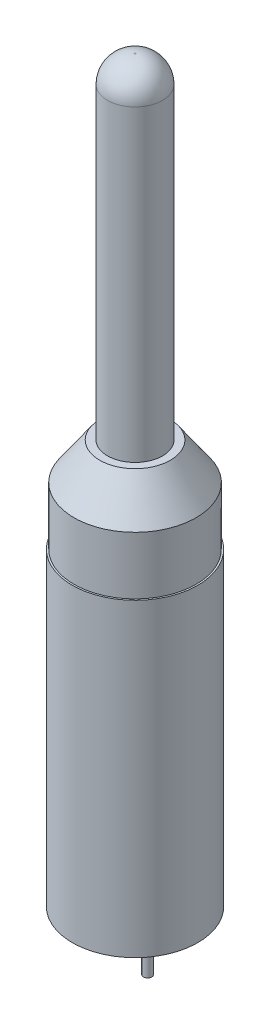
ISO-10303-21;
HEADER;
FILE_DESCRIPTION(('STEP AP214'),'2;1');
FILE_NAME('part.step','',(''),(''),'','','');
FILE_SCHEMA(('AUTOMOTIVE_DESIGN { 1 0 10303 214 1 1 1 1 }'));
ENDSEC;
DATA;
#1=APPLICATION_CONTEXT('core data for automotive mechanical design processes');
#2=APPLICATION_PROTOCOL_DEFINITION('international standard','automotive_design',2000,#1);
#3=PRODUCT_CONTEXT('',#1,'mechanical');
#4=PRODUCT('Part','Part','',(#3));
#5=PRODUCT_RELATED_PRODUCT_CATEGORY('part','',(#4));
#6=PRODUCT_DEFINITION_FORMATION('','',#4);
#7=PRODUCT_DEFINITION_CONTEXT('part definition',#1,'design');
#8=PRODUCT_DEFINITION('design','',#6,#7);
#9=PRODUCT_DEFINITION_SHAPE('','',#8);
#10=(LENGTH_UNIT() NAMED_UNIT(*) SI_UNIT(.MILLI.,.METRE.));
#11=(NAMED_UNIT(*) PLANE_ANGLE_UNIT() SI_UNIT($,.RADIAN.));
#12=(NAMED_UNIT(*) SI_UNIT($,.STERADIAN.) SOLID_ANGLE_UNIT());
#13=UNCERTAINTY_MEASURE_WITH_UNIT(LENGTH_MEASURE(1.E-05),#10,'distance_accuracy_value','');
#14=(GEOMETRIC_REPRESENTATION_CONTEXT(3) GLOBAL_UNCERTAINTY_ASSIGNED_CONTEXT((#13)) GLOBAL_UNIT_ASSIGNED_CONTEXT((#10,
#11,#12)) REPRESENTATION_CONTEXT('',''));
#15=CARTESIAN_POINT('',(0.,0.,0.));
#16=DIRECTION('',(0.,0.,1.));
#17=DIRECTION('',(1.,0.,0.));
#18=AXIS2_PLACEMENT_3D('',#15,#16,#17);
#19=CARTESIAN_POINT('',(-3.,11.2,1.5));
#20=DIRECTION('',(0.,-1.,0.));
#21=DIRECTION('',(0.,0.,-1.));
#22=AXIS2_PLACEMENT_3D('',#19,#20,#21);
#23=CYLINDRICAL_SURFACE('',#22,0.5);
#24=CARTESIAN_POINT('',(-3.,11.2,1.5));
#25=DIRECTION('',(0.316227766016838,-0.948683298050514,0.));
#26=DIRECTION('',(0.948683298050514,0.316227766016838,0.));
#27=AXIS2_PLACEMENT_3D('',#24,#25,#26);
#28=ELLIPSE('',#27,0.52704627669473,0.5);
#29=CARTESIAN_POINT('',(-2.5,11.3666666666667,1.5));
#30=VERTEX_POINT('',#29);
#31=EDGE_CURVE('E62',#30,#30,#28,.F.);
#32=ORIENTED_EDGE('',*,*,#31,.F.);
#33=EDGE_LOOP('',(#32));
#34=FACE_BOUND('',#33,.T.);
#35=CARTESIAN_POINT('',(-3.,-4.8,1.5));
#36=DIRECTION('',(0.,-1.,0.));
#37=DIRECTION('',(0.,0.,-1.));
#38=AXIS2_PLACEMENT_3D('',#35,#36,#37);
#39=CIRCLE('',#38,0.5);
#40=CARTESIAN_POINT('',(-3.,-4.8,1.));
#41=VERTEX_POINT('',#40);
#42=EDGE_CURVE('E12',#41,#41,#39,.T.);
#43=ORIENTED_EDGE('',*,*,#42,.F.);
#44=EDGE_LOOP('',(#43));
#45=FACE_BOUND('',#44,.T.);
#46=ADVANCED_FACE('F56',(#34,#45),#23,.T.);
#47=CARTESIAN_POINT('',(-4.5,13.2,1.5));
#48=DIRECTION('',(0.599999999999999,-0.8,0.));
#49=DIRECTION('',(0.8,0.599999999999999,0.));
#50=AXIS2_PLACEMENT_3D('',#47,#48,#49);
#51=CYLINDRICAL_SURFACE('',#50,0.5);
#52=CARTESIAN_POINT('',(-4.5,13.2,1.5));
#53=DIRECTION('',(0.333110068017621,-0.942887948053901,0.));
#54=DIRECTION('',(-0.942887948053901,-0.333110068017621,0.));
#55=AXIS2_PLACEMENT_3D('',#52,#53,#54);
#56=ELLIPSE('',#55,0.524012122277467,0.5);
#57=CARTESIAN_POINT('',(-4.99408471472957,13.0254462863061,1.5));
#58=VERTEX_POINT('',#57);
#59=EDGE_CURVE('E66',#58,#58,#56,.T.);
#60=ORIENTED_EDGE('',*,*,#59,.T.);
#61=EDGE_LOOP('',(#60));
#62=FACE_BOUND('',#61,.T.);
#63=ORIENTED_EDGE('',*,*,#31,.T.);
#64=EDGE_LOOP('',(#63));
#65=FACE_BOUND('',#64,.T.);
#66=ADVANCED_FACE('F127',(#62,#65),#51,.T.);
#67=CARTESIAN_POINT('',(-4.6,16.,1.5));
#68=DIRECTION('',(0.0356915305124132,-0.99936285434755,0.));
#69=DIRECTION('',(0.99936285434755,0.0356915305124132,0.));
#70=AXIS2_PLACEMENT_3D('',#67,#68,#69);
#71=CYLINDRICAL_SURFACE('',#70,0.5);
#72=CARTESIAN_POINT('',(-4.6,16.,1.5));
#73=DIRECTION('',(0.0178486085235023,-0.999840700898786,0.));
#74=DIRECTION('',(-0.999840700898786,-0.0178486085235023,0.));
#75=AXIS2_PLACEMENT_3D('',#72,#73,#74);
#76=ELLIPSE('',#75,0.500079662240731,0.5);
#77=CARTESIAN_POINT('',(-5.1,15.9910742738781,1.5));
#78=VERTEX_POINT('',#77);
#79=EDGE_CURVE('E70',#78,#78,#76,.F.);
#80=ORIENTED_EDGE('',*,*,#79,.F.);
#81=EDGE_LOOP('',(#80));
#82=FACE_BOUND('',#81,.T.);
#83=ORIENTED_EDGE('',*,*,#59,.F.);
#84=EDGE_LOOP('',(#83));
#85=FACE_BOUND('',#84,.T.);
#86=ADVANCED_FACE('F132',(#82,#85),#71,.T.);
#87=CARTESIAN_POINT('',(-4.6,33.,1.5));
#88=DIRECTION('',(0.,-1.,0.));
#89=DIRECTION('',(0.,0.,-1.));
#90=AXIS2_PLACEMENT_3D('',#87,#88,#89);
#91=CYLINDRICAL_SURFACE('',#90,0.5);
#92=CARTESIAN_POINT('',(-4.6,33.,1.5));
#93=DIRECTION('',(-0.0176862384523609,-0.999843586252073,0.));
#94=DIRECTION('',(-0.999843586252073,0.0176862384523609,0.));
#95=AXIS2_PLACEMENT_3D('',#92,#93,#94);
#96=ELLIPSE('',#95,0.500078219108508,0.5);
#97=CARTESIAN_POINT('',(-5.1,33.008844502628,1.5));
#98=VERTEX_POINT('',#97);
#99=EDGE_CURVE('E75',#98,#98,#96,.T.);
#100=ORIENTED_EDGE('',*,*,#99,.T.);
#101=EDGE_LOOP('',(#100));
#102=FACE_BOUND('',#101,.T.);
#103=ORIENTED_EDGE('',*,*,#79,.T.);
#104=EDGE_LOOP('',(#103));
#105=FACE_BOUND('',#104,.T.);
#106=ADVANCED_FACE('F138',(#102,#105),#91,.T.);
#107=CARTESIAN_POINT('',(-4.49995991,35.8268629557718,1.5));
#108=DIRECTION('',(-0.0353669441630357,-0.999374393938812,0.));
#109=DIRECTION('',(0.999374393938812,-0.0353669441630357,0.));
#110=AXIS2_PLACEMENT_3D('',#107,#108,#109);
#111=CYLINDRICAL_SURFACE('',#110,0.5);
#112=CARTESIAN_POINT('',(-4.49995991,35.8268629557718,1.5));
#113=DIRECTION('',(-0.33295089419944,-0.942944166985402,0.));
#114=DIRECTION('',(-0.942944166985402,0.33295089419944,0.));
#115=AXIS2_PLACEMENT_3D('',#112,#113,#114);
#116=ELLIPSE('',#115,0.524037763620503,0.5);
#117=CARTESIAN_POINT('',(-4.99409826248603,36.0013417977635,1.5));
#118=VERTEX_POINT('',#117);
#119=EDGE_CURVE('E78',#118,#118,#116,.F.);
#120=ORIENTED_EDGE('',*,*,#119,.F.);
#121=EDGE_LOOP('',(#120));
#122=FACE_BOUND('',#121,.T.);
#123=ORIENTED_EDGE('',*,*,#99,.F.);
#124=EDGE_LOOP('',(#123));
#125=FACE_BOUND('',#124,.T.);
#126=ADVANCED_FACE('F144',(#122,#125),#111,.T.);
#127=CARTESIAN_POINT('',(-3.,37.8268629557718,1.5));
#128=DIRECTION('',(-0.599989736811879,-0.800007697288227,0.));
#129=DIRECTION('',(0.800007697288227,-0.59998973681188,0.));
#130=AXIS2_PLACEMENT_3D('',#127,#128,#129);
#131=CYLINDRICAL_SURFACE('',#130,0.5);
#132=CARTESIAN_POINT('',(-3.,37.8268629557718,1.5));
#133=DIRECTION('',(-0.316221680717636,-0.948685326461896,0.));
#134=DIRECTION('',(0.948685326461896,-0.316221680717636,0.));
#135=AXIS2_PLACEMENT_3D('',#132,#133,#134);
#136=ELLIPSE('',#135,0.527045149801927,0.5);
#137=CARTESIAN_POINT('',(-2.5,37.6601998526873,1.5));
#138=VERTEX_POINT('',#137);
#139=EDGE_CURVE('E81',#138,#138,#136,.T.);
#140=ORIENTED_EDGE('',*,*,#139,.T.);
#141=EDGE_LOOP('',(#140));
#142=FACE_BOUND('',#141,.T.);
#143=ORIENTED_EDGE('',*,*,#119,.T.);
#144=EDGE_LOOP('',(#143));
#145=FACE_BOUND('',#144,.T.);
#146=ADVANCED_FACE('F148',(#142,#145),#131,.T.);
#147=CARTESIAN_POINT('',(-3.,41.8268629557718,1.5));
#148=DIRECTION('',(0.,-1.,0.));
#149=DIRECTION('',(0.,0.,-1.));
#150=AXIS2_PLACEMENT_3D('',#147,#148,#149);
#151=CYLINDRICAL_SURFACE('',#150,0.5);
#152=CARTESIAN_POINT('',(-3.,41.8268629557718,1.5));
#153=DIRECTION('',(-0.707106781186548,-0.707106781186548,0.));
#154=DIRECTION('',(-0.707106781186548,0.707106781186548,0.));
#155=AXIS2_PLACEMENT_3D('',#152,#153,#154);
#156=ELLIPSE('',#155,0.707106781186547,0.5);
#157=CARTESIAN_POINT('',(-3.5,42.3268629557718,1.5));
#158=VERTEX_POINT('',#157);
#159=EDGE_CURVE('E84',#158,#158,#156,.F.);
#160=ORIENTED_EDGE('',*,*,#159,.F.);
#161=EDGE_LOOP('',(#160));
#162=FACE_BOUND('',#161,.T.);
#163=ORIENTED_EDGE('',*,*,#139,.F.);
#164=EDGE_LOOP('',(#163));
#165=FACE_BOUND('',#164,.T.);
#166=ADVANCED_FACE('F152',(#162,#165),#151,.T.);
#167=CARTESIAN_POINT('',(3.,41.8268629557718,1.5));
#168=DIRECTION('',(-1.,0.,0.));
#169=DIRECTION('',(0.,0.,1.));
#170=AXIS2_PLACEMENT_3D('',#167,#168,#169);
#171=CYLINDRICAL_SURFACE('',#170,0.5);
#172=CARTESIAN_POINT('',(3.,41.8268629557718,1.5));
#173=DIRECTION('',(-0.707106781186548,0.707106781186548,0.));
#174=DIRECTION('',(0.707106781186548,0.707106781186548,0.));
#175=AXIS2_PLACEMENT_3D('',#172,#173,#174);
#176=ELLIPSE('',#175,0.707106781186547,0.5);
#177=CARTESIAN_POINT('',(3.5,42.3268629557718,1.5));
#178=VERTEX_POINT('',#177);
#179=EDGE_CURVE('E87',#178,#178,#176,.T.);
#180=ORIENTED_EDGE('',*,*,#179,.T.);
#181=EDGE_LOOP('',(#180));
#182=FACE_BOUND('',#181,.T.);
#183=ORIENTED_EDGE('',*,*,#159,.T.);
#184=EDGE_LOOP('',(#183));
#185=FACE_BOUND('',#184,.T.);
#186=ADVANCED_FACE('F156',(#182,#185),#171,.T.);
#187=CARTESIAN_POINT('',(3.,37.8268629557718,1.5));
#188=DIRECTION('',(0.,1.,0.));
#189=DIRECTION('',(0.,0.,1.));
#190=AXIS2_PLACEMENT_3D('',#187,#188,#189);
#191=CYLINDRICAL_SURFACE('',#190,0.5);
#192=CARTESIAN_POINT('',(3.,37.8268629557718,1.5));
#193=DIRECTION('',(-0.316221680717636,0.948685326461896,0.));
#194=DIRECTION('',(-0.948685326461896,-0.316221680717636,0.));
#195=AXIS2_PLACEMENT_3D('',#192,#193,#194);
#196=ELLIPSE('',#195,0.527045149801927,0.5);
#197=CARTESIAN_POINT('',(2.5,37.6601998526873,1.5));
#198=VERTEX_POINT('',#197);
#199=EDGE_CURVE('E90',#198,#198,#196,.F.);
#200=ORIENTED_EDGE('',*,*,#199,.F.);
#201=EDGE_LOOP('',(#200));
#202=FACE_BOUND('',#201,.T.);
#203=ORIENTED_EDGE('',*,*,#179,.F.);
#204=EDGE_LOOP('',(#203));
#205=FACE_BOUND('',#204,.T.);
#206=ADVANCED_FACE('F160',(#202,#205),#191,.T.);
#207=CARTESIAN_POINT('',(4.49995991,35.8268629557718,1.5));
#208=DIRECTION('',(-0.599989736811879,0.800007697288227,0.));
#209=DIRECTION('',(-0.800007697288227,-0.59998973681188,0.));
#210=AXIS2_PLACEMENT_3D('',#207,#208,#209);
#211=CYLINDRICAL_SURFACE('',#210,0.5);
#212=CARTESIAN_POINT('',(4.49995991,35.8268629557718,1.5));
#213=DIRECTION('',(-0.33295089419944,0.942944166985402,0.));
#214=DIRECTION('',(0.942944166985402,0.33295089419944,0.));
#215=AXIS2_PLACEMENT_3D('',#212,#213,#214);
#216=ELLIPSE('',#215,0.524037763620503,0.5);
#217=CARTESIAN_POINT('',(4.99409826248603,36.0013417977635,1.5));
#218=VERTEX_POINT('',#217);
#219=EDGE_CURVE('E93',#218,#218,#216,.T.);
#220=ORIENTED_EDGE('',*,*,#219,.T.);
#221=EDGE_LOOP('',(#220));
#222=FACE_BOUND('',#221,.T.);
#223=ORIENTED_EDGE('',*,*,#199,.T.);
#224=EDGE_LOOP('',(#223));
#225=FACE_BOUND('',#224,.T.);
#226=ADVANCED_FACE('F164',(#222,#225),#211,.T.);
#227=CARTESIAN_POINT('',(4.6,33.,1.5));
#228=DIRECTION('',(-0.0353669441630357,0.999374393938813,0.));
#229=DIRECTION('',(-0.999374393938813,-0.0353669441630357,0.));
#230=AXIS2_PLACEMENT_3D('',#227,#228,#229);
#231=CYLINDRICAL_SURFACE('',#230,0.5);
#232=CARTESIAN_POINT('',(4.6,33.,1.5));
#233=DIRECTION('',(-0.0176862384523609,0.999843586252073,0.));
#234=DIRECTION('',(0.999843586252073,0.0176862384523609,0.));
#235=AXIS2_PLACEMENT_3D('',#232,#233,#234);
#236=ELLIPSE('',#235,0.500078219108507,0.5);
#237=CARTESIAN_POINT('',(5.1,33.008844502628,1.5));
#238=VERTEX_POINT('',#237);
#239=EDGE_CURVE('E96',#238,#238,#236,.F.);
#240=ORIENTED_EDGE('',*,*,#239,.F.);
#241=EDGE_LOOP('',(#240));
#242=FACE_BOUND('',#241,.T.);
#243=ORIENTED_EDGE('',*,*,#219,.F.);
#244=EDGE_LOOP('',(#243));
#245=FACE_BOUND('',#244,.T.);
#246=ADVANCED_FACE('F168',(#242,#245),#231,.T.);
#247=CARTESIAN_POINT('',(4.6,16.,1.5));
#248=DIRECTION('',(0.,1.,0.));
#249=DIRECTION('',(0.,0.,1.));
#250=AXIS2_PLACEMENT_3D('',#247,#248,#249);
#251=CYLINDRICAL_SURFACE('',#250,0.5);
#252=CARTESIAN_POINT('',(4.6,16.,1.5));
#253=DIRECTION('',(0.0178486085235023,0.999840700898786,0.));
#254=DIRECTION('',(0.999840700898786,-0.0178486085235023,0.));
#255=AXIS2_PLACEMENT_3D('',#252,#253,#254);
#256=ELLIPSE('',#255,0.50007966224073,0.5);
#257=CARTESIAN_POINT('',(5.1,15.9910742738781,1.5));
#258=VERTEX_POINT('',#257);
#259=EDGE_CURVE('E99',#258,#258,#256,.T.);
#260=ORIENTED_EDGE('',*,*,#259,.T.);
#261=EDGE_LOOP('',(#260));
#262=FACE_BOUND('',#261,.T.);
#263=ORIENTED_EDGE('',*,*,#239,.T.);
#264=EDGE_LOOP('',(#263));
#265=FACE_BOUND('',#264,.T.);
#266=ADVANCED_FACE('F172',(#262,#265),#251,.T.);
#267=CARTESIAN_POINT('',(4.5,13.2,1.5));
#268=DIRECTION('',(0.0356915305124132,0.99936285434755,0.));
#269=DIRECTION('',(-0.99936285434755,0.0356915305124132,0.));
#270=AXIS2_PLACEMENT_3D('',#267,#268,#269);
#271=CYLINDRICAL_SURFACE('',#270,0.5);
#272=CARTESIAN_POINT('',(4.5,13.2,1.5));
#273=DIRECTION('',(0.333110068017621,0.942887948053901,0.));
#274=DIRECTION('',(0.942887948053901,-0.333110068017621,0.));
#275=AXIS2_PLACEMENT_3D('',#272,#273,#274);
#276=ELLIPSE('',#275,0.524012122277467,0.5);
#277=CARTESIAN_POINT('',(4.99408471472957,13.0254462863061,1.5));
#278=VERTEX_POINT('',#277);
#279=EDGE_CURVE('E102',#278,#278,#276,.F.);
#280=ORIENTED_EDGE('',*,*,#279,.F.);
#281=EDGE_LOOP('',(#280));
#282=FACE_BOUND('',#281,.T.);
#283=ORIENTED_EDGE('',*,*,#259,.F.);
#284=EDGE_LOOP('',(#283));
#285=FACE_BOUND('',#284,.T.);
#286=ADVANCED_FACE('F176',(#282,#285),#271,.T.);
#287=CARTESIAN_POINT('',(3.,11.2,1.5));
#288=DIRECTION('',(0.599999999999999,0.8,0.));
#289=DIRECTION('',(-0.8,0.599999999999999,0.));
#290=AXIS2_PLACEMENT_3D('',#287,#288,#289);
#291=CYLINDRICAL_SURFACE('',#290,0.5);
#292=CARTESIAN_POINT('',(3.,11.2,1.5));
#293=DIRECTION('',(0.316227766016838,0.948683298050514,0.));
#294=DIRECTION('',(0.948683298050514,-0.316227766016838,0.));
#295=AXIS2_PLACEMENT_3D('',#292,#293,#294);
#296=ELLIPSE('',#295,0.52704627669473,0.5);
#297=CARTESIAN_POINT('',(3.5,11.0333333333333,1.5));
#298=VERTEX_POINT('',#297);
#299=EDGE_CURVE('E105',#298,#298,#296,.T.);
#300=ORIENTED_EDGE('',*,*,#299,.T.);
#301=EDGE_LOOP('',(#300));
#302=FACE_BOUND('',#301,.T.);
#303=ORIENTED_EDGE('',*,*,#279,.T.);
#304=EDGE_LOOP('',(#303));
#305=FACE_BOUND('',#304,.T.);
#306=ADVANCED_FACE('F124',(#302,#305),#291,.T.);
#307=CARTESIAN_POINT('',(3.,12.6142135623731,1.5));
#308=DIRECTION('',(0.,-1.,0.));
#309=DIRECTION('',(0.,0.,-1.));
#310=AXIS2_PLACEMENT_3D('',#307,#308,#309);
#311=CYLINDRICAL_SURFACE('',#310,0.5);
#312=CARTESIAN_POINT('',(3.,-4.8,1.5));
#313=DIRECTION('',(0.,1.,0.));
#314=DIRECTION('',(0.,0.,1.));
#315=AXIS2_PLACEMENT_3D('',#312,#313,#314);
#316=CIRCLE('',#315,0.5);
#317=CARTESIAN_POINT('',(3.,-4.8,2.));
#318=VERTEX_POINT('',#317);
#319=EDGE_CURVE('E108',#318,#318,#316,.T.);
#320=ORIENTED_EDGE('',*,*,#319,.T.);
#321=EDGE_LOOP('',(#320));
#322=FACE_BOUND('',#321,.T.);
#323=ORIENTED_EDGE('',*,*,#299,.F.);
#324=EDGE_LOOP('',(#323));
#325=FACE_BOUND('',#324,.T.);
#326=ADVANCED_FACE('F112',(#322,#325),#311,.T.);
#327=CARTESIAN_POINT('',(3.,-4.8,1.5));
#328=DIRECTION('',(0.,1.,0.));
#329=DIRECTION('',(0.,0.,1.));
#330=AXIS2_PLACEMENT_3D('',#327,#328,#329);
#331=PLANE('',#330);
#332=ORIENTED_EDGE('',*,*,#319,.F.);
#333=EDGE_LOOP('',(#332));
#334=FACE_BOUND('',#333,.T.);
#335=ADVANCED_FACE('F115',(#334),#331,.F.);
#336=CARTESIAN_POINT('',(-3.,-4.8,1.5));
#337=DIRECTION('',(0.,-1.,0.));
#338=DIRECTION('',(0.,0.,-1.));
#339=AXIS2_PLACEMENT_3D('',#336,#337,#338);
#340=PLANE('',#339);
#341=ORIENTED_EDGE('',*,*,#42,.T.);
#342=EDGE_LOOP('',(#341));
#343=FACE_BOUND('',#342,.T.);
#344=ADVANCED_FACE('F117',(#343),#340,.T.);
#345=CLOSED_SHELL('',(#46,#66,#86,#106,#126,#146,#166,#186,#206,#226,#246,#266,#286,#306,#326,
#335,#344));
#346=MANIFOLD_SOLID_BREP('B2',#345);
#347=CARTESIAN_POINT('',(0.,13.7,0.));
#348=DIRECTION('',(0.,-1.,0.));
#349=DIRECTION('',(0.,0.,-1.));
#350=AXIS2_PLACEMENT_3D('',#347,#348,#349);
#351=CYLINDRICAL_SURFACE('',#350,1.);
#352=CARTESIAN_POINT('',(0.,11.2,0.));
#353=DIRECTION('',(0.,1.,0.));
#354=DIRECTION('',(0.,0.,1.));
#355=AXIS2_PLACEMENT_3D('',#352,#353,#354);
#356=CIRCLE('',#355,1.);
#357=CARTESIAN_POINT('',(0.,11.2,1.));
#358=VERTEX_POINT('',#357);
#359=EDGE_CURVE('E402',#358,#358,#356,.T.);
#360=ORIENTED_EDGE('',*,*,#359,.T.);
#361=EDGE_LOOP('',(#360));
#362=FACE_BOUND('',#361,.T.);
#363=DIRECTION('',(0.,-1.,0.));
#364=VECTOR('',#363,1.);
#365=CARTESIAN_POINT('',(1.,13.7,0.));
#366=LINE('',#365,#364);
#367=CARTESIAN_POINT('',(1.,13.5018339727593,7.82876344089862E-11));
#368=VERTEX_POINT('',#367);
#369=CARTESIAN_POINT('',(1.,13.7,0.));
#370=VERTEX_POINT('',#369);
#371=EDGE_CURVE('E332',#368,#370,#366,.F.);
#372=ORIENTED_EDGE('',*,*,#371,.F.);
#373=CARTESIAN_POINT('',(1.,13.5018339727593,7.82876344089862E-11));
#374=CARTESIAN_POINT('',(0.999999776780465,13.5055843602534,0.0283840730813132));
#375=CARTESIAN_POINT('',(0.998790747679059,13.5093460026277,0.0567527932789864));
#376=CARTESIAN_POINT('',(0.993968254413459,13.516887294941,0.113281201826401));
#377=CARTESIAN_POINT('',(0.990354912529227,13.5206669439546,0.141440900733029));
#378=CARTESIAN_POINT('',(0.975943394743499,13.5320145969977,0.225253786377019));
#379=CARTESIAN_POINT('',(0.961573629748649,13.5396033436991,0.280332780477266));
#380=CARTESIAN_POINT('',(0.923718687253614,13.5548326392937,0.387254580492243));
#381=CARTESIAN_POINT('',(0.900229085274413,13.5624732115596,0.439095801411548));
#382=CARTESIAN_POINT('',(0.844824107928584,13.5778357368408,0.538037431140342));
#383=CARTESIAN_POINT('',(0.812911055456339,13.5855576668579,0.585139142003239));
#384=CARTESIAN_POINT('',(0.741559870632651,13.601066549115,0.673280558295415));
#385=CARTESIAN_POINT('',(0.702117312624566,13.6088535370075,0.714316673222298));
#386=CARTESIAN_POINT('',(0.616834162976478,13.6244795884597,0.789135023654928));
#387=CARTESIAN_POINT('',(0.570990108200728,13.6323186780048,0.822913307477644));
#388=CARTESIAN_POINT('',(0.474197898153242,13.6480835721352,0.882250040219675));
#389=CARTESIAN_POINT('',(0.423243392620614,13.656009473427,0.907798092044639));
#390=CARTESIAN_POINT('',(0.317825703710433,13.6719415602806,0.949839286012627));
#391=CARTESIAN_POINT('',(0.263369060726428,13.6799475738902,0.966348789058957));
#392=CARTESIAN_POINT('',(0.180210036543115,13.6919740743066,0.984041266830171));
#393=CARTESIAN_POINT('',(0.152225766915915,13.6959884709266,0.98876090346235));
#394=CARTESIAN_POINT('',(0.124106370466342,13.7,0.992268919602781));
#395=B_SPLINE_CURVE_WITH_KNOTS('',3,(#373,#374,#375,#376,#377,#378,#379,#380,#381,#382,#383,
#384,#385,#386,#387,#388,#389,#390,#391,#392,#393,#394),.UNSPECIFIED.,.F.,.F.,(4,2,2,2,2,2,2,2,
2,2,4),(0.,0.0858395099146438,0.171674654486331,0.343070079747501,0.514548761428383,
0.68598020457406,0.857512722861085,1.02913840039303,1.20098004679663,1.372509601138,
1.45838757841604),.UNSPECIFIED.);
#396=CARTESIAN_POINT('',(0.124106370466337,13.7,0.99226891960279));
#397=VERTEX_POINT('',#396);
#398=EDGE_CURVE('E354',#368,#397,#395,.T.);
#399=ORIENTED_EDGE('',*,*,#398,.T.);
#400=CARTESIAN_POINT('',(0.,13.7,0.));
#401=DIRECTION('',(0.,1.,0.));
#402=DIRECTION('',(0.,0.,1.));
#403=AXIS2_PLACEMENT_3D('',#400,#401,#402);
#404=CIRCLE('',#403,1.);
#405=EDGE_CURVE('E388',#370,#397,#404,.T.);
#406=ORIENTED_EDGE('',*,*,#405,.F.);
#407=EDGE_LOOP('',(#372,#399,#406));
#408=FACE_BOUND('',#407,.T.);
#409=ADVANCED_FACE('F317',(#362,#408),#351,.T.);
#410=CARTESIAN_POINT('',(0.,13.7,0.));
#411=DIRECTION('',(0.,1.,0.));
#412=DIRECTION('',(0.,0.,1.));
#413=AXIS2_PLACEMENT_3D('',#410,#411,#412);
#414=PLANE('',#413);
#415=CARTESIAN_POINT('',(0.772977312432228,13.7,6.05145654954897E-11));
#416=CARTESIAN_POINT('',(0.77530405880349,13.7,0.0493751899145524));
#417=CARTESIAN_POINT('',(0.77331233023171,13.7,0.0988666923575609));
#418=CARTESIAN_POINT('',(0.76123248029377,13.7,0.196783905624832));
#419=CARTESIAN_POINT('',(0.751156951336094,13.7,0.245211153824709));
#420=CARTESIAN_POINT('',(0.723252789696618,13.7,0.340549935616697));
#421=CARTESIAN_POINT('',(0.70531367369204,13.7,0.387429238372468));
#422=CARTESIAN_POINT('',(0.672992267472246,13.7,0.455105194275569));
#423=CARTESIAN_POINT('',(0.661312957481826,13.7,0.477228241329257));
#424=CARTESIAN_POINT('',(0.636204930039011,13.7,0.520458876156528));
#425=CARTESIAN_POINT('',(0.622776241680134,13.7,0.541566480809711));
#426=CARTESIAN_POINT('',(0.578794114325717,13.7,0.605092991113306));
#427=CARTESIAN_POINT('',(0.545530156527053,13.7,0.645661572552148));
#428=CARTESIAN_POINT('',(0.473606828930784,13.7,0.721657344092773));
#429=CARTESIAN_POINT('',(0.434941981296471,13.7,0.75707923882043));
#430=CARTESIAN_POINT('',(0.371718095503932,13.7,0.808584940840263));
#431=CARTESIAN_POINT('',(0.34845861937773,13.7,0.826307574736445));
#432=CARTESIAN_POINT('',(0.301168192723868,13.7,0.860488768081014));
#433=CARTESIAN_POINT('',(0.277140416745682,13.7,0.876951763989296));
#434=CARTESIAN_POINT('',(0.241585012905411,13.7,0.9008385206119));
#435=CARTESIAN_POINT('',(0.230171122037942,13.7,0.908435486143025));
#436=CARTESIAN_POINT('',(0.207300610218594,13.7,0.923793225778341));
#437=CARTESIAN_POINT('',(0.19584462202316,13.7,0.9315548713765));
#438=CARTESIAN_POINT('',(0.173043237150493,13.7,0.947620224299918));
#439=CARTESIAN_POINT('',(0.16170169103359,13.7,0.955930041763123));
#440=CARTESIAN_POINT('',(0.145621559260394,13.7,0.969384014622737));
#441=CARTESIAN_POINT('',(0.140445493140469,13.7,0.974002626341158));
#442=CARTESIAN_POINT('',(0.130707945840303,13.7,0.983839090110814));
#443=CARTESIAN_POINT('',(0.126141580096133,13.7,0.989051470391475));
#444=CARTESIAN_POINT('',(0.120949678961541,13.7,0.99695074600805));
#445=CARTESIAN_POINT('',(0.119645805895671,13.7,0.999177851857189));
#446=CARTESIAN_POINT('',(0.117397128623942,13.7,1.00379839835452));
#447=CARTESIAN_POINT('',(0.116449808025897,13.7,1.00619052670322));
#448=CARTESIAN_POINT('',(0.115457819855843,13.7,1.00975543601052));
#449=CARTESIAN_POINT('',(0.115203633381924,13.7,1.0108714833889));
#450=CARTESIAN_POINT('',(0.115009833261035,13.7,1.01199999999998));
#451=B_SPLINE_CURVE_WITH_KNOTS('',3,(#415,#416,#417,#418,#419,#420,#421,#422,#423,#424,#425,
#426,#427,#428,#429,#430,#431,#432,#433,#434,#435,#436,#437,#438,#439,#440,#441,#442,#443,#444,
#445,#446,#447,#448,#449,#450),.UNSPECIFIED.,.F.,.F.,(4,2,2,2,2,2,2,2,2,2,2,2,2,2,2,2,2,4),(0.,
0.147973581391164,0.2957171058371,0.445606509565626,0.5205865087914,0.595565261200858,
0.752276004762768,0.909146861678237,0.996832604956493,1.08419375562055,1.12532491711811,
1.16684884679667,1.20895957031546,1.22976422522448,1.25039067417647,1.25811458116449,
1.26578290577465,1.26921334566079),.UNSPECIFIED.);
#452=CARTESIAN_POINT('',(0.772977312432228,13.7,6.05145654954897E-11));
#453=VERTEX_POINT('',#452);
#454=EDGE_CURVE('E325',#453,#397,#451,.T.);
#455=ORIENTED_EDGE('',*,*,#454,.F.);
#456=DIRECTION('',(1.,0.,0.));
#457=VECTOR('',#456,1.);
#458=CARTESIAN_POINT('',(0.,13.7,0.));
#459=LINE('',#458,#457);
#460=EDGE_CURVE('E54',#453,#370,#459,.T.);
#461=ORIENTED_EDGE('',*,*,#460,.T.);
#462=ORIENTED_EDGE('',*,*,#405,.T.);
#463=EDGE_LOOP('',(#455,#461,#462));
#464=FACE_BOUND('',#463,.T.);
#465=ADVANCED_FACE('F389',(#464),#414,.T.);
#466=CARTESIAN_POINT('',(0.,11.2,0.));
#467=DIRECTION('',(0.,1.,0.));
#468=DIRECTION('',(0.,0.,1.));
#469=AXIS2_PLACEMENT_3D('',#466,#467,#468);
#470=PLANE('',#469);
#471=ORIENTED_EDGE('',*,*,#359,.F.);
#472=EDGE_LOOP('',(#471));
#473=FACE_BOUND('',#472,.T.);
#474=ADVANCED_FACE('F376',(#473),#470,.F.);
#475=CARTESIAN_POINT('',(0.972977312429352,13.7,0.));
#476=DIRECTION('',(0.,0.,1.));
#477=DIRECTION('',(1.,0.,0.));
#478=AXIS2_PLACEMENT_3D('',#475,#476,#477);
#479=PLANE('',#478);
#480=CARTESIAN_POINT('',(0.972977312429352,13.7,0.));
#481=DIRECTION('',(0.,0.,1.));
#482=DIRECTION('',(1.,0.,0.));
#483=AXIS2_PLACEMENT_3D('',#480,#481,#482);
#484=CIRCLE('',#483,0.2);
#485=CARTESIAN_POINT('',(1.17297731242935,13.7,0.));
#486=VERTEX_POINT('',#485);
#487=EDGE_CURVE('E359',#368,#486,#484,.T.);
#488=ORIENTED_EDGE('',*,*,#487,.F.);
#489=ORIENTED_EDGE('',*,*,#371,.T.);
#490=ORIENTED_EDGE('',*,*,#460,.F.);
#491=EDGE_CURVE('E355',#486,#453,#484,.T.);
#492=ORIENTED_EDGE('',*,*,#491,.F.);
#493=EDGE_LOOP('',(#488,#489,#490,#492));
#494=FACE_BOUND('',#493,.T.);
#495=ADVANCED_FACE('F374',(#494),#479,.F.);
#496=CARTESIAN_POINT('',(1.17297731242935,13.7,0.));
#497=CARTESIAN_POINT('',(1.18139301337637,13.7314062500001,0.268703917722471));
#498=CARTESIAN_POINT('',(1.09386229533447,13.7628125,0.54263043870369));
#499=CARTESIAN_POINT('',(0.758615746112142,13.825625,0.977659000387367));
#500=CARTESIAN_POINT('',(0.511923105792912,13.85703125,1.13703040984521));
#501=CARTESIAN_POINT('',(-0.0345491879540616,13.91984375,1.26289033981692));
#502=CARTESIAN_POINT('',(-0.332403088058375,13.95125,1.22868796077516));
#503=CARTESIAN_POINT('',(-0.844877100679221,14.0140625,0.973848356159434));
#504=CARTESIAN_POINT('',(-1.05753345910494,14.04546875,0.753918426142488));
#505=CARTESIAN_POINT('',(-1.29643890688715,14.10828125,0.221128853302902));
#506=CARTESIAN_POINT('',(-1.32160271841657,14.1396875,-0.0898996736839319));
#507=CARTESIAN_POINT('',(-1.16492349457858,14.2025,-0.664379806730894));
#508=CARTESIAN_POINT('',(-0.983415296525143,14.23390625,-0.925687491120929));
#509=CARTESIAN_POINT('',(-0.488237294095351,14.29671875,-1.27679625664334));
#510=CARTESIAN_POINT('',(-0.176221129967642,14.3281250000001,-1.36512928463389));
#511=CARTESIAN_POINT('',(0.440808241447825,14.3909374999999,-1.32126874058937));
#512=CARTESIAN_POINT('',(0.743570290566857,14.42234375,-1.18899349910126));
#513=CARTESIAN_POINT('',(1.20089418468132,14.48515625,-0.755470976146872));
#514=CARTESIAN_POINT('',(1.35363452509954,14.5165625,-0.455618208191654));
#515=CARTESIAN_POINT('',(1.43326058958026,14.579375,0.181132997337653));
#516=CARTESIAN_POINT('',(1.35961884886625,14.6107812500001,0.51575635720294));
#517=CARTESIAN_POINT('',(1.0107940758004,14.67359375,1.06810292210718));
#518=CARTESIAN_POINT('',(0.73666979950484,14.705,1.2836981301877));
#519=CARTESIAN_POINT('',(0.105551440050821,14.7678125,1.49273321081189));
#520=CARTESIAN_POINT('',(-0.249234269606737,14.79921875,1.48518766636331));
#521=CARTESIAN_POINT('',(-0.880391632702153,14.86203125,1.24197050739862));
#522=CARTESIAN_POINT('',(-1.15439247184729,14.8934375,1.00695411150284));
#523=CARTESIAN_POINT('',(-1.49344067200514,14.95625,0.408342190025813));
#524=CARTESIAN_POINT('',(-1.55705135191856,14.98765625,0.0467940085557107));
#525=CARTESIAN_POINT('',(-1.43712730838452,15.05046875,-0.642373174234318));
#526=CARTESIAN_POINT('',(-1.25378898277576,15.081875,-0.967457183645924));
#527=CARTESIAN_POINT('',(-0.714942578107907,15.1446875,-1.43144916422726));
#528=CARTESIAN_POINT('',(-0.361226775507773,15.17609375,-1.56849566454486));
#529=CARTESIAN_POINT('',(0.36122677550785,15.23890625,-1.58532577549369));
#530=CARTESIAN_POINT('',(0.727356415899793,15.2703125,-1.46480745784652));
#531=CARTESIAN_POINT('',(1.30543830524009,15.333125,-1.01216007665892));
#532=CARTESIAN_POINT('',(1.51515064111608,15.36453125,-0.681478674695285));
#533=CARTESIAN_POINT('',(1.67711398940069,15.42734375,0.0464977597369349));
#534=CARTESIAN_POINT('',(1.62854376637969,15.45875,0.441211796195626));
#535=CARTESIAN_POINT('',(1.28646747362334,15.5215625,1.11689417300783));
#536=CARTESIAN_POINT('',(0.993983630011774,15.55296875,1.39530956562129));
#537=CARTESIAN_POINT('',(0.290220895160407,15.61578125,1.70503441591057));
#538=CARTESIAN_POINT('',(-0.118609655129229,15.6471875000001,1.73500293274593));
#539=CARTESIAN_POINT('',(-0.870181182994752,15.7099999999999,1.5246036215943));
#540=CARTESIAN_POINT('',(-1.21013892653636,15.74140625,1.28476456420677));
#541=CARTESIAN_POINT('',(-1.66406152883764,15.80421875,0.635714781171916));
#542=CARTESIAN_POINT('',(-1.7761871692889,15.835625,0.228713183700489));
#543=CARTESIAN_POINT('',(-1.71418757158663,15.8984375,-0.572485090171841));
#544=CARTESIAN_POINT('',(-1.54004614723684,15.92984375,-0.963765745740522));
#545=CARTESIAN_POINT('',(-0.975666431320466,15.99265625,-1.55194683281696));
#546=CARTESIAN_POINT('',(-0.587295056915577,16.0240625,-1.74655335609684));
#547=CARTESIAN_POINT('',(0.233625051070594,16.086875,-1.84431847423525));
#548=CARTESIAN_POINT('',(0.663233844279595,16.11828125,-1.74688412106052));
#549=CARTESIAN_POINT('',(1.36945218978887,16.18109375,-1.29524551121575));
#550=CARTESIAN_POINT('',(1.64337825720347,16.2125,-0.942471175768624));
#551=CARTESIAN_POINT('',(1.90613342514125,16.2753125,-0.134261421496));
#552=CARTESIAN_POINT('',(1.89378317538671,16.30671875,0.318326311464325));
#553=CARTESIAN_POINT('',(1.5797466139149,16.36953125,1.12045683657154));
#554=CARTESIAN_POINT('',(1.27897118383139,16.4009375,1.46701158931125));
#555=CARTESIAN_POINT('',(0.517150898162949,16.46375,1.89329647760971));
#556=CARTESIAN_POINT('',(0.0587425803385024,16.49515625,1.97127500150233));
#557=CARTESIAN_POINT('',(-0.811928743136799,16.55796875,1.81524753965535));
#558=CARTESIAN_POINT('',(-1.22100151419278,16.589375,1.58156828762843));
#559=CARTESIAN_POINT('',(-1.80239432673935,16.6521875,0.899668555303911));
#560=CARTESIAN_POINT('',(-1.97242835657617,16.6835937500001,0.453768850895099));
#561=CARTESIAN_POINT('',(-1.98084412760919,16.715,0.));
#562=CARTESIAN_POINT('',(1.17297731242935,14.1,0.));
#563=CARTESIAN_POINT('',(1.18139301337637,14.1314062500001,0.268703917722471));
#564=CARTESIAN_POINT('',(1.09386229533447,14.1628125,0.54263043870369));
#565=CARTESIAN_POINT('',(0.758615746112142,14.225625,0.977659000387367));
#566=CARTESIAN_POINT('',(0.511923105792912,14.25703125,1.13703040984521));
#567=CARTESIAN_POINT('',(-0.0345491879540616,14.31984375,1.26289033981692));
#568=CARTESIAN_POINT('',(-0.332403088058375,14.35125,1.22868796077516));
#569=CARTESIAN_POINT('',(-0.844877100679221,14.4140625,0.973848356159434));
#570=CARTESIAN_POINT('',(-1.05753345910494,14.44546875,0.753918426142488));
#571=CARTESIAN_POINT('',(-1.29643890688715,14.50828125,0.221128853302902));
#572=CARTESIAN_POINT('',(-1.32160271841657,14.5396875,-0.0898996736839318));
#573=CARTESIAN_POINT('',(-1.16492349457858,14.6025,-0.664379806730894));
#574=CARTESIAN_POINT('',(-0.983415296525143,14.63390625,-0.925687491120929));
#575=CARTESIAN_POINT('',(-0.488237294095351,14.69671875,-1.27679625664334));
#576=CARTESIAN_POINT('',(-0.176221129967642,14.7281250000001,-1.36512928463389));
#577=CARTESIAN_POINT('',(0.440808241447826,14.7909375,-1.32126874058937));
#578=CARTESIAN_POINT('',(0.743570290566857,14.82234375,-1.18899349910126));
#579=CARTESIAN_POINT('',(1.20089418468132,14.88515625,-0.755470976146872));
#580=CARTESIAN_POINT('',(1.35363452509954,14.9165625,-0.455618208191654));
#581=CARTESIAN_POINT('',(1.43326058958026,14.979375,0.181132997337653));
#582=CARTESIAN_POINT('',(1.35961884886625,15.0107812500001,0.51575635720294));
#583=CARTESIAN_POINT('',(1.0107940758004,15.07359375,1.06810292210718));
#584=CARTESIAN_POINT('',(0.736669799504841,15.105,1.2836981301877));
#585=CARTESIAN_POINT('',(0.10555144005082,15.1678125,1.49273321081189));
#586=CARTESIAN_POINT('',(-0.249234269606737,15.19921875,1.48518766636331));
#587=CARTESIAN_POINT('',(-0.880391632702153,15.26203125,1.24197050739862));
#588=CARTESIAN_POINT('',(-1.15439247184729,15.2934375,1.00695411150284));
#589=CARTESIAN_POINT('',(-1.49344067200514,15.35625,0.408342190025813));
#590=CARTESIAN_POINT('',(-1.55705135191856,15.38765625,0.0467940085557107));
#591=CARTESIAN_POINT('',(-1.43712730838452,15.45046875,-0.642373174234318));
#592=CARTESIAN_POINT('',(-1.25378898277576,15.481875,-0.967457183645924));
#593=CARTESIAN_POINT('',(-0.714942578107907,15.5446875,-1.43144916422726));
#594=CARTESIAN_POINT('',(-0.361226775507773,15.57609375,-1.56849566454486));
#595=CARTESIAN_POINT('',(0.36122677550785,15.63890625,-1.58532577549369));
#596=CARTESIAN_POINT('',(0.727356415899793,15.6703125,-1.46480745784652));
#597=CARTESIAN_POINT('',(1.30543830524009,15.733125,-1.01216007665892));
#598=CARTESIAN_POINT('',(1.51515064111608,15.76453125,-0.681478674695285));
#599=CARTESIAN_POINT('',(1.67711398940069,15.82734375,0.0464977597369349));
#600=CARTESIAN_POINT('',(1.62854376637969,15.85875,0.441211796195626));
#601=CARTESIAN_POINT('',(1.28646747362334,15.9215625,1.11689417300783));
#602=CARTESIAN_POINT('',(0.993983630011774,15.95296875,1.39530956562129));
#603=CARTESIAN_POINT('',(0.290220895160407,16.01578125,1.70503441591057));
#604=CARTESIAN_POINT('',(-0.118609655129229,16.0471875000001,1.73500293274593));
#605=CARTESIAN_POINT('',(-0.870181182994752,16.1099999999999,1.5246036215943));
#606=CARTESIAN_POINT('',(-1.21013892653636,16.14140625,1.28476456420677));
#607=CARTESIAN_POINT('',(-1.66406152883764,16.20421875,0.635714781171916));
#608=CARTESIAN_POINT('',(-1.7761871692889,16.235625,0.228713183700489));
#609=CARTESIAN_POINT('',(-1.71418757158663,16.2984375,-0.57248509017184));
#610=CARTESIAN_POINT('',(-1.54004614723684,16.32984375,-0.963765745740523));
#611=CARTESIAN_POINT('',(-0.975666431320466,16.39265625,-1.55194683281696));
#612=CARTESIAN_POINT('',(-0.587295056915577,16.4240625,-1.74655335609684));
#613=CARTESIAN_POINT('',(0.233625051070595,16.486875,-1.84431847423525));
#614=CARTESIAN_POINT('',(0.663233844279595,16.5182812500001,-1.74688412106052));
#615=CARTESIAN_POINT('',(1.36945218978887,16.58109375,-1.29524551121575));
#616=CARTESIAN_POINT('',(1.64337825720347,16.6125000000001,-0.942471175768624));
#617=CARTESIAN_POINT('',(1.90613342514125,16.6753125,-0.134261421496));
#618=CARTESIAN_POINT('',(1.89378317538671,16.70671875,0.318326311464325));
#619=CARTESIAN_POINT('',(1.5797466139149,16.76953125,1.12045683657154));
#620=CARTESIAN_POINT('',(1.27897118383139,16.8009375,1.46701158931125));
#621=CARTESIAN_POINT('',(0.517150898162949,16.86375,1.89329647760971));
#622=CARTESIAN_POINT('',(0.0587425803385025,16.89515625,1.97127500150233));
#623=CARTESIAN_POINT('',(-0.811928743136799,16.95796875,1.81524753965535));
#624=CARTESIAN_POINT('',(-1.22100151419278,16.989375,1.58156828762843));
#625=CARTESIAN_POINT('',(-1.80239432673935,17.0521875,0.899668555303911));
#626=CARTESIAN_POINT('',(-1.97242835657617,17.08359375,0.453768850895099));
#627=CARTESIAN_POINT('',(-1.98084412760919,17.115,0.));
#628=CARTESIAN_POINT('',(0.772977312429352,14.1,0.));
#629=CARTESIAN_POINT('',(0.781393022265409,14.1314062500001,0.177072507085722));
#630=CARTESIAN_POINT('',(0.726529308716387,14.1628125,0.359703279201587));
#631=CARTESIAN_POINT('',(0.507540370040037,14.225625,0.653071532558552));
#632=CARTESIAN_POINT('',(0.344018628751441,14.25703125,0.76259222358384));
#633=CARTESIAN_POINT('',(-0.022716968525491,14.31984375,0.852700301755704));
#634=CARTESIAN_POINT('',(-0.224653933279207,14.35125,0.832725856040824));
#635=CARTESIAN_POINT('',(-0.575508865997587,14.4140625,0.664273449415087));
#636=CARTESIAN_POINT('',(-0.723046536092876,14.44546875,0.516190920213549));
#637=CARTESIAN_POINT('',(-0.891822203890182,14.50828125,0.152709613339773));
#638=CARTESIAN_POINT('',(-0.912228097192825,14.5396875,-0.0614692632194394));
#639=CARTESIAN_POINT('',(-0.808745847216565,14.6025,-0.46058247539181));
#640=CARTESIAN_POINT('',(-0.685000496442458,14.63390625,-0.644005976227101));
#641=CARTESIAN_POINT('',(-0.34219590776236,14.69671875,-0.893302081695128));
#642=CARTESIAN_POINT('',(-0.124240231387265,14.7281250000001,-0.958074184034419));
#643=CARTESIAN_POINT('',(0.310413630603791,14.7909375,-0.932176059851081));
#644=CARTESIAN_POINT('',(0.525519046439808,14.82234375,-0.841359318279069));
#645=CARTESIAN_POINT('',(0.853260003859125,14.88515625,-0.53741973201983));
#646=CARTESIAN_POINT('',(0.96454184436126,14.9165625,-0.32522359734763));
#647=CARTESIAN_POINT('',(1.02620548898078,14.979375,0.129152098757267));
#648=CARTESIAN_POINT('',(0.976124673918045,15.0107812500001,0.369714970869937));
#649=CARTESIAN_POINT('',(0.729112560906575,15.07359375,0.769688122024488));
#650=CARTESIAN_POINT('',(0.53287246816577,15.105,0.927520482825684));
#651=CARTESIAN_POINT('',(0.0771210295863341,15.1678125,1.08335858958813));
#652=CARTESIAN_POINT('',(-0.180815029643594,15.19921875,1.08057096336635));
#653=CARTESIAN_POINT('',(-0.64266412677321,15.26203125,0.907483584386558));
#654=CARTESIAN_POINT('',(-0.844817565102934,15.2934375,0.737585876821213));
#655=CARTESIAN_POINT('',(-1.0974785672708,15.35625,0.300593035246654));
#656=CARTESIAN_POINT('',(-1.14686131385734,15.38765625,0.034961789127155));
#657=CARTESIAN_POINT('',(-1.06268912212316,15.45046875,-0.474468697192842));
#658=CARTESIAN_POINT('',(-0.929201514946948,15.481875,-0.716381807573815));
#659=CARTESIAN_POINT('',(-0.532015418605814,15.5446875,-1.06411617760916));
#660=CARTESIAN_POINT('',(-0.269597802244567,15.57609375,-1.16849566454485));
#661=CARTESIAN_POINT('',(0.269597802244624,15.63890625,-1.18532577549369));
#662=CARTESIAN_POINT('',(0.544429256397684,15.6703125,-1.09747447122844));
#663=CARTESIAN_POINT('',(0.980850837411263,15.733125,-0.761084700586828));
#664=CARTESIAN_POINT('',(1.14071245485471,15.76453125,-0.513574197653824));
#665=CARTESIAN_POINT('',(1.26692395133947,15.82734375,0.0346655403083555));
#666=CARTESIAN_POINT('',(1.23258166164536,15.85875,0.333462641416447));
#667=CARTESIAN_POINT('',(0.976892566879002,15.9215625,0.847525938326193));
#668=CARTESIAN_POINT('',(0.756256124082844,15.95296875,1.06082264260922));
#669=CARTESIAN_POINT('',(0.221801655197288,16.01578125,1.3004177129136));
#670=CARTESIAN_POINT('',(-0.0901792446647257,16.0471875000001,1.32562831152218));
#671=CARTESIAN_POINT('',(-0.666383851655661,16.1099999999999,1.16842597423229));
#672=CARTESIAN_POINT('',(-0.928457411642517,16.14140625,0.986349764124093));
#673=CARTESIAN_POINT('',(-1.28056735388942,16.20421875,0.48967339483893));
#674=CARTESIAN_POINT('',(-1.36913206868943,16.235625,0.176732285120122));
#675=CARTESIAN_POINT('',(-1.32509489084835,16.2984375,-0.442090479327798));
#676=CARTESIAN_POINT('',(-1.19241196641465,16.32984375,-0.745714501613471));
#677=CARTESIAN_POINT('',(-0.757615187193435,16.39265625,-1.20431265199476));
#678=CARTESIAN_POINT('',(-0.456900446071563,16.4240625,-1.35746067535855));
#679=CARTESIAN_POINT('',(0.181644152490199,16.486875,-1.43726337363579));
#680=CARTESIAN_POINT('',(0.517192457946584,16.51828125,-1.36338994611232));
#681=CARTESIAN_POINT('',(1.07103738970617,16.58109375,-1.01356399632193));
#682=CARTESIAN_POINT('',(1.28720060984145,16.6125,-0.738673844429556));
#683=CARTESIAN_POINT('',(1.4967588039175,16.6753125,-0.10583101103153));
#684=CARTESIAN_POINT('',(1.48916647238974,16.70671875,0.249907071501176));
#685=CARTESIAN_POINT('',(1.24525969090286,16.76953125,0.882729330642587));
#686=CARTESIAN_POINT('',(1.00960294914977,16.8009375,1.1574366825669));
#687=CARTESIAN_POINT('',(0.409401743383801,16.86375,1.49733437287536));
#688=CARTESIAN_POINT('',(0.0469103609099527,16.89515625,1.56108496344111));
#689=CARTESIAN_POINT('',(-0.64402426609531,16.95796875,1.44080935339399));
#690=CARTESIAN_POINT('',(-0.969926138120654,16.989375,1.25698081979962));
#691=CARTESIAN_POINT('',(-1.43506134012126,17.0521875,0.71674139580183));
#692=CARTESIAN_POINT('',(-1.57242836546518,17.0835937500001,0.362137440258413));
#693=CARTESIAN_POINT('',(-1.58084412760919,17.115,0.));
#694=CARTESIAN_POINT('',(0.772977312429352,13.7,0.));
#695=CARTESIAN_POINT('',(0.781393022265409,13.7314062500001,0.177072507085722));
#696=CARTESIAN_POINT('',(0.726529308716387,13.7628125,0.359703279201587));
#697=CARTESIAN_POINT('',(0.507540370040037,13.825625,0.653071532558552));
#698=CARTESIAN_POINT('',(0.344018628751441,13.85703125,0.76259222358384));
#699=CARTESIAN_POINT('',(-0.022716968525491,13.91984375,0.852700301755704));
#700=CARTESIAN_POINT('',(-0.224653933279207,13.95125,0.832725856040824));
#701=CARTESIAN_POINT('',(-0.575508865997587,14.0140625,0.664273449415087));
#702=CARTESIAN_POINT('',(-0.723046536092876,14.04546875,0.516190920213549));
#703=CARTESIAN_POINT('',(-0.891822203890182,14.10828125,0.152709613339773));
#704=CARTESIAN_POINT('',(-0.912228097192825,14.1396875,-0.0614692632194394));
#705=CARTESIAN_POINT('',(-0.808745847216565,14.2025,-0.46058247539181));
#706=CARTESIAN_POINT('',(-0.685000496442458,14.23390625,-0.644005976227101));
#707=CARTESIAN_POINT('',(-0.34219590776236,14.29671875,-0.893302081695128));
#708=CARTESIAN_POINT('',(-0.124240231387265,14.3281250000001,-0.958074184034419));
#709=CARTESIAN_POINT('',(0.310413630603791,14.3909374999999,-0.932176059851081));
#710=CARTESIAN_POINT('',(0.525519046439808,14.42234375,-0.841359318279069));
#711=CARTESIAN_POINT('',(0.853260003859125,14.48515625,-0.53741973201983));
#712=CARTESIAN_POINT('',(0.96454184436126,14.5165625,-0.32522359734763));
#713=CARTESIAN_POINT('',(1.02620548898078,14.579375,0.129152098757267));
#714=CARTESIAN_POINT('',(0.976124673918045,14.6107812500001,0.369714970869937));
#715=CARTESIAN_POINT('',(0.729112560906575,14.67359375,0.769688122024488));
#716=CARTESIAN_POINT('',(0.53287246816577,14.705,0.927520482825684));
#717=CARTESIAN_POINT('',(0.0771210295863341,14.7678125,1.08335858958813));
#718=CARTESIAN_POINT('',(-0.180815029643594,14.79921875,1.08057096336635));
#719=CARTESIAN_POINT('',(-0.64266412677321,14.86203125,0.907483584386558));
#720=CARTESIAN_POINT('',(-0.844817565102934,14.8934375,0.737585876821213));
#721=CARTESIAN_POINT('',(-1.0974785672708,14.95625,0.300593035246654));
#722=CARTESIAN_POINT('',(-1.14686131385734,14.98765625,0.034961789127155));
#723=CARTESIAN_POINT('',(-1.06268912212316,15.05046875,-0.474468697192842));
#724=CARTESIAN_POINT('',(-0.929201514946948,15.081875,-0.716381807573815));
#725=CARTESIAN_POINT('',(-0.532015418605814,15.1446875,-1.06411617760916));
#726=CARTESIAN_POINT('',(-0.269597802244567,15.17609375,-1.16849566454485));
#727=CARTESIAN_POINT('',(0.269597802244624,15.23890625,-1.18532577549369));
#728=CARTESIAN_POINT('',(0.544429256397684,15.2703125,-1.09747447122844));
#729=CARTESIAN_POINT('',(0.980850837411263,15.333125,-0.761084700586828));
#730=CARTESIAN_POINT('',(1.14071245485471,15.36453125,-0.513574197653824));
#731=CARTESIAN_POINT('',(1.26692395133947,15.42734375,0.0346655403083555));
#732=CARTESIAN_POINT('',(1.23258166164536,15.45875,0.333462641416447));
#733=CARTESIAN_POINT('',(0.976892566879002,15.5215625,0.847525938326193));
#734=CARTESIAN_POINT('',(0.756256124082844,15.55296875,1.06082264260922));
#735=CARTESIAN_POINT('',(0.221801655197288,15.61578125,1.3004177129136));
#736=CARTESIAN_POINT('',(-0.0901792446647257,15.6471875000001,1.32562831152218));
#737=CARTESIAN_POINT('',(-0.666383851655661,15.7099999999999,1.16842597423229));
#738=CARTESIAN_POINT('',(-0.928457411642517,15.74140625,0.986349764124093));
#739=CARTESIAN_POINT('',(-1.28056735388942,15.80421875,0.48967339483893));
#740=CARTESIAN_POINT('',(-1.36913206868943,15.835625,0.176732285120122));
#741=CARTESIAN_POINT('',(-1.32509489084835,15.8984375,-0.442090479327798));
#742=CARTESIAN_POINT('',(-1.19241196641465,15.92984375,-0.745714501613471));
#743=CARTESIAN_POINT('',(-0.757615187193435,15.99265625,-1.20431265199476));
#744=CARTESIAN_POINT('',(-0.456900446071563,16.0240625,-1.35746067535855));
#745=CARTESIAN_POINT('',(0.181644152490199,16.086875,-1.43726337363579));
#746=CARTESIAN_POINT('',(0.517192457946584,16.11828125,-1.36338994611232));
#747=CARTESIAN_POINT('',(1.07103738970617,16.18109375,-1.01356399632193));
#748=CARTESIAN_POINT('',(1.28720060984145,16.2125,-0.738673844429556));
#749=CARTESIAN_POINT('',(1.4967588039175,16.2753125,-0.10583101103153));
#750=CARTESIAN_POINT('',(1.48916647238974,16.30671875,0.249907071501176));
#751=CARTESIAN_POINT('',(1.24525969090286,16.36953125,0.882729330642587));
#752=CARTESIAN_POINT('',(1.00960294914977,16.4009375,1.1574366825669));
#753=CARTESIAN_POINT('',(0.409401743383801,16.46375,1.49733437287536));
#754=CARTESIAN_POINT('',(0.0469103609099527,16.49515625,1.56108496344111));
#755=CARTESIAN_POINT('',(-0.64402426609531,16.55796875,1.44080935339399));
#756=CARTESIAN_POINT('',(-0.969926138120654,16.589375,1.25698081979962));
#757=CARTESIAN_POINT('',(-1.43506134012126,16.6521875,0.71674139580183));
#758=CARTESIAN_POINT('',(-1.57242836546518,16.6835937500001,0.362137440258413));
#759=CARTESIAN_POINT('',(-1.58084412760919,16.715,0.));
#760=CARTESIAN_POINT('',(0.772977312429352,13.3,0.));
#761=CARTESIAN_POINT('',(0.781393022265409,13.3314062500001,0.177072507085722));
#762=CARTESIAN_POINT('',(0.726529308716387,13.3628125,0.359703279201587));
#763=CARTESIAN_POINT('',(0.507540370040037,13.425625,0.653071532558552));
#764=CARTESIAN_POINT('',(0.344018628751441,13.45703125,0.76259222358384));
#765=CARTESIAN_POINT('',(-0.022716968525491,13.51984375,0.852700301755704));
#766=CARTESIAN_POINT('',(-0.224653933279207,13.55125,0.832725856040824));
#767=CARTESIAN_POINT('',(-0.575508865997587,13.6140625,0.664273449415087));
#768=CARTESIAN_POINT('',(-0.723046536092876,13.64546875,0.516190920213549));
#769=CARTESIAN_POINT('',(-0.891822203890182,13.70828125,0.152709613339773));
#770=CARTESIAN_POINT('',(-0.912228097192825,13.7396875,-0.0614692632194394));
#771=CARTESIAN_POINT('',(-0.808745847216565,13.8025,-0.46058247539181));
#772=CARTESIAN_POINT('',(-0.685000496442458,13.83390625,-0.644005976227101));
#773=CARTESIAN_POINT('',(-0.34219590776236,13.89671875,-0.893302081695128));
#774=CARTESIAN_POINT('',(-0.124240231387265,13.928125,-0.958074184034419));
#775=CARTESIAN_POINT('',(0.310413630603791,13.9909374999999,-0.932176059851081));
#776=CARTESIAN_POINT('',(0.525519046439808,14.02234375,-0.841359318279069));
#777=CARTESIAN_POINT('',(0.853260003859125,14.08515625,-0.53741973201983));
#778=CARTESIAN_POINT('',(0.96454184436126,14.1165625,-0.32522359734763));
#779=CARTESIAN_POINT('',(1.02620548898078,14.179375,0.129152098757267));
#780=CARTESIAN_POINT('',(0.976124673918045,14.21078125,0.369714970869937));
#781=CARTESIAN_POINT('',(0.729112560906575,14.2735937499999,0.769688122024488));
#782=CARTESIAN_POINT('',(0.53287246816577,14.305,0.927520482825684));
#783=CARTESIAN_POINT('',(0.0771210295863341,14.3678125,1.08335858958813));
#784=CARTESIAN_POINT('',(-0.180815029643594,14.39921875,1.08057096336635));
#785=CARTESIAN_POINT('',(-0.64266412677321,14.46203125,0.907483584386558));
#786=CARTESIAN_POINT('',(-0.844817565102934,14.4934375,0.737585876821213));
#787=CARTESIAN_POINT('',(-1.0974785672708,14.55625,0.300593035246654));
#788=CARTESIAN_POINT('',(-1.14686131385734,14.58765625,0.034961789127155));
#789=CARTESIAN_POINT('',(-1.06268912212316,14.65046875,-0.474468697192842));
#790=CARTESIAN_POINT('',(-0.929201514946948,14.681875,-0.716381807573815));
#791=CARTESIAN_POINT('',(-0.532015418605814,14.7446875,-1.06411617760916));
#792=CARTESIAN_POINT('',(-0.269597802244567,14.77609375,-1.16849566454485));
#793=CARTESIAN_POINT('',(0.269597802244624,14.83890625,-1.18532577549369));
#794=CARTESIAN_POINT('',(0.544429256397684,14.8703125,-1.09747447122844));
#795=CARTESIAN_POINT('',(0.980850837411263,14.933125,-0.761084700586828));
#796=CARTESIAN_POINT('',(1.14071245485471,14.96453125,-0.513574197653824));
#797=CARTESIAN_POINT('',(1.26692395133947,15.02734375,0.0346655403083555));
#798=CARTESIAN_POINT('',(1.23258166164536,15.05875,0.333462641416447));
#799=CARTESIAN_POINT('',(0.976892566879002,15.1215625,0.847525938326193));
#800=CARTESIAN_POINT('',(0.756256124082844,15.15296875,1.06082264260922));
#801=CARTESIAN_POINT('',(0.221801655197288,15.21578125,1.3004177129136));
#802=CARTESIAN_POINT('',(-0.0901792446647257,15.2471875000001,1.32562831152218));
#803=CARTESIAN_POINT('',(-0.666383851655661,15.3099999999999,1.16842597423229));
#804=CARTESIAN_POINT('',(-0.928457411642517,15.34140625,0.986349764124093));
#805=CARTESIAN_POINT('',(-1.28056735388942,15.40421875,0.48967339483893));
#806=CARTESIAN_POINT('',(-1.36913206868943,15.435625,0.176732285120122));
#807=CARTESIAN_POINT('',(-1.32509489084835,15.4984375,-0.442090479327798));
#808=CARTESIAN_POINT('',(-1.19241196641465,15.52984375,-0.745714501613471));
#809=CARTESIAN_POINT('',(-0.757615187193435,15.59265625,-1.20431265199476));
#810=CARTESIAN_POINT('',(-0.456900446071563,15.6240625,-1.35746067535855));
#811=CARTESIAN_POINT('',(0.181644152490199,15.686875,-1.43726337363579));
#812=CARTESIAN_POINT('',(0.517192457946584,15.71828125,-1.36338994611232));
#813=CARTESIAN_POINT('',(1.07103738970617,15.78109375,-1.01356399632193));
#814=CARTESIAN_POINT('',(1.28720060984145,15.8125,-0.738673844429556));
#815=CARTESIAN_POINT('',(1.4967588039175,15.8753125,-0.10583101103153));
#816=CARTESIAN_POINT('',(1.48916647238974,15.90671875,0.249907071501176));
#817=CARTESIAN_POINT('',(1.24525969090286,15.96953125,0.882729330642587));
#818=CARTESIAN_POINT('',(1.00960294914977,16.0009375,1.1574366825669));
#819=CARTESIAN_POINT('',(0.4094017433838,16.06375,1.49733437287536));
#820=CARTESIAN_POINT('',(0.0469103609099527,16.09515625,1.56108496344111));
#821=CARTESIAN_POINT('',(-0.64402426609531,16.15796875,1.44080935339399));
#822=CARTESIAN_POINT('',(-0.969926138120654,16.189375,1.25698081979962));
#823=CARTESIAN_POINT('',(-1.43506134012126,16.2521875,0.71674139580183));
#824=CARTESIAN_POINT('',(-1.57242836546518,16.2835937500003,0.362137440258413));
#825=CARTESIAN_POINT('',(-1.58084412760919,16.315,0.));
#826=CARTESIAN_POINT('',(1.17297731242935,13.3,0.));
#827=CARTESIAN_POINT('',(1.18139301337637,13.3314062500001,0.268703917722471));
#828=CARTESIAN_POINT('',(1.09386229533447,13.3628125,0.54263043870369));
#829=CARTESIAN_POINT('',(0.758615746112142,13.425625,0.977659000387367));
#830=CARTESIAN_POINT('',(0.511923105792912,13.45703125,1.13703040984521));
#831=CARTESIAN_POINT('',(-0.0345491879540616,13.51984375,1.26289033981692));
#832=CARTESIAN_POINT('',(-0.332403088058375,13.55125,1.22868796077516));
#833=CARTESIAN_POINT('',(-0.844877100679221,13.6140625,0.973848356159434));
#834=CARTESIAN_POINT('',(-1.05753345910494,13.64546875,0.753918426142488));
#835=CARTESIAN_POINT('',(-1.29643890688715,13.70828125,0.221128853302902));
#836=CARTESIAN_POINT('',(-1.32160271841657,13.7396875,-0.0898996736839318));
#837=CARTESIAN_POINT('',(-1.16492349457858,13.8025,-0.664379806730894));
#838=CARTESIAN_POINT('',(-0.983415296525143,13.83390625,-0.925687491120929));
#839=CARTESIAN_POINT('',(-0.488237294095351,13.89671875,-1.27679625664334));
#840=CARTESIAN_POINT('',(-0.176221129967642,13.928125,-1.36512928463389));
#841=CARTESIAN_POINT('',(0.440808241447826,13.9909374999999,-1.32126874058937));
#842=CARTESIAN_POINT('',(0.743570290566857,14.02234375,-1.18899349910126));
#843=CARTESIAN_POINT('',(1.20089418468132,14.08515625,-0.755470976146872));
#844=CARTESIAN_POINT('',(1.35363452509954,14.1165625,-0.455618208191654));
#845=CARTESIAN_POINT('',(1.43326058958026,14.179375,0.181132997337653));
#846=CARTESIAN_POINT('',(1.35961884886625,14.21078125,0.51575635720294));
#847=CARTESIAN_POINT('',(1.0107940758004,14.2735937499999,1.06810292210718));
#848=CARTESIAN_POINT('',(0.736669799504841,14.305,1.2836981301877));
#849=CARTESIAN_POINT('',(0.10555144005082,14.3678125,1.49273321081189));
#850=CARTESIAN_POINT('',(-0.249234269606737,14.39921875,1.48518766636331));
#851=CARTESIAN_POINT('',(-0.880391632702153,14.46203125,1.24197050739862));
#852=CARTESIAN_POINT('',(-1.15439247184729,14.4934375,1.00695411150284));
#853=CARTESIAN_POINT('',(-1.49344067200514,14.55625,0.408342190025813));
#854=CARTESIAN_POINT('',(-1.55705135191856,14.58765625,0.0467940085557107));
#855=CARTESIAN_POINT('',(-1.43712730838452,14.65046875,-0.642373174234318));
#856=CARTESIAN_POINT('',(-1.25378898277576,14.681875,-0.967457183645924));
#857=CARTESIAN_POINT('',(-0.714942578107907,14.7446875,-1.43144916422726));
#858=CARTESIAN_POINT('',(-0.361226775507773,14.77609375,-1.56849566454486));
#859=CARTESIAN_POINT('',(0.36122677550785,14.83890625,-1.58532577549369));
#860=CARTESIAN_POINT('',(0.727356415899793,14.8703125,-1.46480745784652));
#861=CARTESIAN_POINT('',(1.30543830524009,14.933125,-1.01216007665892));
#862=CARTESIAN_POINT('',(1.51515064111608,14.96453125,-0.681478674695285));
#863=CARTESIAN_POINT('',(1.67711398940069,15.02734375,0.0464977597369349));
#864=CARTESIAN_POINT('',(1.62854376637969,15.05875,0.441211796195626));
#865=CARTESIAN_POINT('',(1.28646747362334,15.1215625,1.11689417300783));
#866=CARTESIAN_POINT('',(0.993983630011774,15.15296875,1.39530956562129));
#867=CARTESIAN_POINT('',(0.290220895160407,15.21578125,1.70503441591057));
#868=CARTESIAN_POINT('',(-0.118609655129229,15.2471875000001,1.73500293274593));
#869=CARTESIAN_POINT('',(-0.870181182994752,15.3099999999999,1.5246036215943));
#870=CARTESIAN_POINT('',(-1.21013892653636,15.34140625,1.28476456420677));
#871=CARTESIAN_POINT('',(-1.66406152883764,15.40421875,0.635714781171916));
#872=CARTESIAN_POINT('',(-1.7761871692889,15.435625,0.228713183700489));
#873=CARTESIAN_POINT('',(-1.71418757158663,15.4984375,-0.57248509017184));
#874=CARTESIAN_POINT('',(-1.54004614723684,15.52984375,-0.963765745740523));
#875=CARTESIAN_POINT('',(-0.975666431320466,15.59265625,-1.55194683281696));
#876=CARTESIAN_POINT('',(-0.587295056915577,15.6240625,-1.74655335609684));
#877=CARTESIAN_POINT('',(0.233625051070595,15.686875,-1.84431847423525));
#878=CARTESIAN_POINT('',(0.663233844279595,15.71828125,-1.74688412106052));
#879=CARTESIAN_POINT('',(1.36945218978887,15.78109375,-1.29524551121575));
#880=CARTESIAN_POINT('',(1.64337825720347,15.8125,-0.942471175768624));
#881=CARTESIAN_POINT('',(1.90613342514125,15.8753125,-0.134261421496));
#882=CARTESIAN_POINT('',(1.89378317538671,15.90671875,0.318326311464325));
#883=CARTESIAN_POINT('',(1.5797466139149,15.96953125,1.12045683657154));
#884=CARTESIAN_POINT('',(1.27897118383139,16.0009375,1.46701158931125));
#885=CARTESIAN_POINT('',(0.517150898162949,16.06375,1.89329647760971));
#886=CARTESIAN_POINT('',(0.0587425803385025,16.09515625,1.97127500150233));
#887=CARTESIAN_POINT('',(-0.811928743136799,16.15796875,1.81524753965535));
#888=CARTESIAN_POINT('',(-1.22100151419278,16.189375,1.58156828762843));
#889=CARTESIAN_POINT('',(-1.80239432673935,16.2521875,0.899668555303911));
#890=CARTESIAN_POINT('',(-1.97242835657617,16.2835937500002,0.453768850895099));
#891=CARTESIAN_POINT('',(-1.98084412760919,16.315,0.));
#892=CARTESIAN_POINT('',(1.17297731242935,13.7,0.));
#893=CARTESIAN_POINT('',(1.18139301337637,13.7314062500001,0.268703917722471));
#894=CARTESIAN_POINT('',(1.09386229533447,13.7628125,0.54263043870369));
#895=CARTESIAN_POINT('',(0.758615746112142,13.825625,0.977659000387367));
#896=CARTESIAN_POINT('',(0.511923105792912,13.85703125,1.13703040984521));
#897=CARTESIAN_POINT('',(-0.0345491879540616,13.91984375,1.26289033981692));
#898=CARTESIAN_POINT('',(-0.332403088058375,13.95125,1.22868796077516));
#899=CARTESIAN_POINT('',(-0.844877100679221,14.0140625,0.973848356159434));
#900=CARTESIAN_POINT('',(-1.05753345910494,14.04546875,0.753918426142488));
#901=CARTESIAN_POINT('',(-1.29643890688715,14.10828125,0.221128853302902));
#902=CARTESIAN_POINT('',(-1.32160271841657,14.1396875,-0.0898996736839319));
#903=CARTESIAN_POINT('',(-1.16492349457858,14.2025,-0.664379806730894));
#904=CARTESIAN_POINT('',(-0.983415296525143,14.23390625,-0.925687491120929));
#905=CARTESIAN_POINT('',(-0.488237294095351,14.29671875,-1.27679625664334));
#906=CARTESIAN_POINT('',(-0.176221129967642,14.3281250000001,-1.36512928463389));
#907=CARTESIAN_POINT('',(0.440808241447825,14.3909374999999,-1.32126874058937));
#908=CARTESIAN_POINT('',(0.743570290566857,14.42234375,-1.18899349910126));
#909=CARTESIAN_POINT('',(1.20089418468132,14.48515625,-0.755470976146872));
#910=CARTESIAN_POINT('',(1.35363452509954,14.5165625,-0.455618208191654));
#911=CARTESIAN_POINT('',(1.43326058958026,14.579375,0.181132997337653));
#912=CARTESIAN_POINT('',(1.35961884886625,14.6107812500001,0.51575635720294));
#913=CARTESIAN_POINT('',(1.0107940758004,14.67359375,1.06810292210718));
#914=CARTESIAN_POINT('',(0.73666979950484,14.705,1.2836981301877));
#915=CARTESIAN_POINT('',(0.105551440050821,14.7678125,1.49273321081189));
#916=CARTESIAN_POINT('',(-0.249234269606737,14.79921875,1.48518766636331));
#917=CARTESIAN_POINT('',(-0.880391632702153,14.86203125,1.24197050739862));
#918=CARTESIAN_POINT('',(-1.15439247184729,14.8934375,1.00695411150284));
#919=CARTESIAN_POINT('',(-1.49344067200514,14.95625,0.408342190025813));
#920=CARTESIAN_POINT('',(-1.55705135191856,14.98765625,0.0467940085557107));
#921=CARTESIAN_POINT('',(-1.43712730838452,15.05046875,-0.642373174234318));
#922=CARTESIAN_POINT('',(-1.25378898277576,15.081875,-0.967457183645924));
#923=CARTESIAN_POINT('',(-0.714942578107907,15.1446875,-1.43144916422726));
#924=CARTESIAN_POINT('',(-0.361226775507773,15.17609375,-1.56849566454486));
#925=CARTESIAN_POINT('',(0.36122677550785,15.23890625,-1.58532577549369));
#926=CARTESIAN_POINT('',(0.727356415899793,15.2703125,-1.46480745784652));
#927=CARTESIAN_POINT('',(1.30543830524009,15.333125,-1.01216007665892));
#928=CARTESIAN_POINT('',(1.51515064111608,15.36453125,-0.681478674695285));
#929=CARTESIAN_POINT('',(1.67711398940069,15.42734375,0.0464977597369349));
#930=CARTESIAN_POINT('',(1.62854376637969,15.45875,0.441211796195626));
#931=CARTESIAN_POINT('',(1.28646747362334,15.5215625,1.11689417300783));
#932=CARTESIAN_POINT('',(0.993983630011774,15.55296875,1.39530956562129));
#933=CARTESIAN_POINT('',(0.290220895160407,15.61578125,1.70503441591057));
#934=CARTESIAN_POINT('',(-0.118609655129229,15.6471875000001,1.73500293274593));
#935=CARTESIAN_POINT('',(-0.870181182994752,15.7099999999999,1.5246036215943));
#936=CARTESIAN_POINT('',(-1.21013892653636,15.74140625,1.28476456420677));
#937=CARTESIAN_POINT('',(-1.66406152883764,15.80421875,0.635714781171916));
#938=CARTESIAN_POINT('',(-1.7761871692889,15.835625,0.228713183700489));
#939=CARTESIAN_POINT('',(-1.71418757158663,15.8984375,-0.572485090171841));
#940=CARTESIAN_POINT('',(-1.54004614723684,15.92984375,-0.963765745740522));
#941=CARTESIAN_POINT('',(-0.975666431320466,15.99265625,-1.55194683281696));
#942=CARTESIAN_POINT('',(-0.587295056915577,16.0240625,-1.74655335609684));
#943=CARTESIAN_POINT('',(0.233625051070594,16.086875,-1.84431847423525));
#944=CARTESIAN_POINT('',(0.663233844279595,16.11828125,-1.74688412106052));
#945=CARTESIAN_POINT('',(1.36945218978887,16.18109375,-1.29524551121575));
#946=CARTESIAN_POINT('',(1.64337825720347,16.2125,-0.942471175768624));
#947=CARTESIAN_POINT('',(1.90613342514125,16.2753125,-0.134261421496));
#948=CARTESIAN_POINT('',(1.89378317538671,16.30671875,0.318326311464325));
#949=CARTESIAN_POINT('',(1.5797466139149,16.36953125,1.12045683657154));
#950=CARTESIAN_POINT('',(1.27897118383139,16.4009375,1.46701158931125));
#951=CARTESIAN_POINT('',(0.517150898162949,16.46375,1.89329647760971));
#952=CARTESIAN_POINT('',(0.0587425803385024,16.49515625,1.97127500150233));
#953=CARTESIAN_POINT('',(-0.811928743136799,16.55796875,1.81524753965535));
#954=CARTESIAN_POINT('',(-1.22100151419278,16.589375,1.58156828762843));
#955=CARTESIAN_POINT('',(-1.80239432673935,16.6521875,0.899668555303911));
#956=CARTESIAN_POINT('',(-1.97242835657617,16.6835937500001,0.453768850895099));
#957=CARTESIAN_POINT('',(-1.98084412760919,16.715,0.));
#958=(BOUNDED_SURFACE() B_SPLINE_SURFACE(3,3,((#496,#497,#498,#499,#500,#501,#502,#503,#504,
#505,#506,#507,#508,#509,#510,#511,#512,#513,#514,#515,#516,#517,#518,#519,#520,#521,#522,#523,
#524,#525,#526,#527,#528,#529,#530,#531,#532,#533,#534,#535,#536,#537,#538,#539,#540,#541,#542,
#543,#544,#545,#546,#547,#548,#549,#550,#551,#552,#553,#554,#555,#556,#557,#558,#559,#560,#561),
(#562,#563,#564,#565,#566,#567,#568,#569,#570,#571,#572,#573,#574,#575,#576,#577,#578,#579,#580,
#581,#582,#583,#584,#585,#586,#587,#588,#589,#590,#591,#592,#593,#594,#595,#596,#597,#598,#599,
#600,#601,#602,#603,#604,#605,#606,#607,#608,#609,#610,#611,#612,#613,#614,#615,#616,#617,#618,
#619,#620,#621,#622,#623,#624,#625,#626,#627),(#628,#629,#630,#631,#632,#633,#634,#635,#636,
#637,#638,#639,#640,#641,#642,#643,#644,#645,#646,#647,#648,#649,#650,#651,#652,#653,#654,#655,
#656,#657,#658,#659,#660,#661,#662,#663,#664,#665,#666,#667,#668,#669,#670,#671,#672,#673,#674,
#675,#676,#677,#678,#679,#680,#681,#682,#683,#684,#685,#686,#687,#688,#689,#690,#691,#692,#693),
(#694,#695,#696,#697,#698,#699,#700,#701,#702,#703,#704,#705,#706,#707,#708,#709,#710,#711,#712,
#713,#714,#715,#716,#717,#718,#719,#720,#721,#722,#723,#724,#725,#726,#727,#728,#729,#730,#731,
#732,#733,#734,#735,#736,#737,#738,#739,#740,#741,#742,#743,#744,#745,#746,#747,#748,#749,#750,
#751,#752,#753,#754,#755,#756,#757,#758,#759),(#760,#761,#762,#763,#764,#765,#766,#767,#768,
#769,#770,#771,#772,#773,#774,#775,#776,#777,#778,#779,#780,#781,#782,#783,#784,#785,#786,#787,
#788,#789,#790,#791,#792,#793,#794,#795,#796,#797,#798,#799,#800,#801,#802,#803,#804,#805,#806,
#807,#808,#809,#810,#811,#812,#813,#814,#815,#816,#817,#818,#819,#820,#821,#822,#823,#824,#825),
(#826,#827,#828,#829,#830,#831,#832,#833,#834,#835,#836,#837,#838,#839,#840,#841,#842,#843,#844,
#845,#846,#847,#848,#849,#850,#851,#852,#853,#854,#855,#856,#857,#858,#859,#860,#861,#862,#863,
#864,#865,#866,#867,#868,#869,#870,#871,#872,#873,#874,#875,#876,#877,#878,#879,#880,#881,#882,
#883,#884,#885,#886,#887,#888,#889,#890,#891),(#892,#893,#894,#895,#896,#897,#898,#899,#900,
#901,#902,#903,#904,#905,#906,#907,#908,#909,#910,#911,#912,#913,#914,#915,#916,#917,#918,#919,
#920,#921,#922,#923,#924,#925,#926,#927,#928,#929,#930,#931,#932,#933,#934,#935,#936,#937,#938,
#939,#940,#941,#942,#943,#944,#945,#946,#947,#948,#949,#950,#951,#952,#953,#954,#955,#956,
#957)),.UNSPECIFIED.,.T.,.F.,.F.) B_SPLINE_SURFACE_WITH_KNOTS((4,3,4),(4,2,2,2,2,2,2,2,2,2,2,2,
2,2,2,2,2,2,2,2,2,2,2,2,2,2,2,2,2,2,2,2,4),(0.,0.5,1.),(0.,0.03125,0.0625,0.09375,0.125,0.15625,
0.1875,0.21875,0.25,0.28125,0.3125,0.34375,0.375,0.40625,0.4375,0.46875,0.5,0.53125,0.5625,
0.59375,0.625,0.65625,0.6875,0.71875,0.75,0.78125,0.8125,0.84375,0.875,0.90625,0.9375,0.96875,
1.),.UNSPECIFIED.) GEOMETRIC_REPRESENTATION_ITEM() RATIONAL_B_SPLINE_SURFACE(((1.,1.,1.,1.,1.,
1.,1.,1.,1.,1.,1.,1.,1.,1.,1.,1.,1.,1.,1.,1.,1.,1.,1.,1.,1.,1.,1.,1.,1.,1.,1.,1.,1.,1.,1.,1.,1.,
1.,1.,1.,1.,1.,1.,1.,1.,1.,1.,1.,1.,1.,1.,1.,1.,1.,1.,1.,1.,1.,1.,1.,1.,1.,1.,1.,1.,1.),
(0.333333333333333,0.333333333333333,0.333333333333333,0.333333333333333,0.333333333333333,
0.333333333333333,0.333333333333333,0.333333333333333,0.333333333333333,0.333333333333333,
0.333333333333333,0.333333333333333,0.333333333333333,0.333333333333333,0.333333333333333,
0.333333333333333,0.333333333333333,0.333333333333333,0.333333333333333,0.333333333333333,
0.333333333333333,0.333333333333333,0.333333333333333,0.333333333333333,0.333333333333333,
0.333333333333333,0.333333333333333,0.333333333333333,0.333333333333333,0.333333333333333,
0.333333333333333,0.333333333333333,0.333333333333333,0.333333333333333,0.333333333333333,
0.333333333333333,0.333333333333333,0.333333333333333,0.333333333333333,0.333333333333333,
0.333333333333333,0.333333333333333,0.333333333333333,0.333333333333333,0.333333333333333,
0.333333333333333,0.333333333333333,0.333333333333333,0.333333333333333,0.333333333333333,
0.333333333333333,0.333333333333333,0.333333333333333,0.333333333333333,0.333333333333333,
0.333333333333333,0.333333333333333,0.333333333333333,0.333333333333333,0.333333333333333,
0.333333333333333,0.333333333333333,0.333333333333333,0.333333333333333,0.333333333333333,
0.333333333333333),(0.333333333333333,0.333333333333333,0.333333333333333,0.333333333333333,
0.333333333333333,0.333333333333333,0.333333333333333,0.333333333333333,0.333333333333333,
0.333333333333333,0.333333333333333,0.333333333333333,0.333333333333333,0.333333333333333,
0.333333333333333,0.333333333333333,0.333333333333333,0.333333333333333,0.333333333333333,
0.333333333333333,0.333333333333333,0.333333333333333,0.333333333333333,0.333333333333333,
0.333333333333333,0.333333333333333,0.333333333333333,0.333333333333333,0.333333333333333,
0.333333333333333,0.333333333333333,0.333333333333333,0.333333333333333,0.333333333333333,
0.333333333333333,0.333333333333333,0.333333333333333,0.333333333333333,0.333333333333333,
0.333333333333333,0.333333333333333,0.333333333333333,0.333333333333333,0.333333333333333,
0.333333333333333,0.333333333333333,0.333333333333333,0.333333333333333,0.333333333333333,
0.333333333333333,0.333333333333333,0.333333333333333,0.333333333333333,0.333333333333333,
0.333333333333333,0.333333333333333,0.333333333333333,0.333333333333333,0.333333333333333,
0.333333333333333,0.333333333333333,0.333333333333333,0.333333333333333,0.333333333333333,
0.333333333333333,0.333333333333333),(1.,1.,1.,1.,1.,1.,1.,1.,1.,1.,1.,1.,1.,1.,1.,1.,1.,1.,1.,
1.,1.,1.,1.,1.,1.,1.,1.,1.,1.,1.,1.,1.,1.,1.,1.,1.,1.,1.,1.,1.,1.,1.,1.,1.,1.,1.,1.,1.,1.,1.,1.,
1.,1.,1.,1.,1.,1.,1.,1.,1.,1.,1.,1.,1.,1.,1.),(0.333333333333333,0.333333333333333,
0.333333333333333,0.333333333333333,0.333333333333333,0.333333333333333,0.333333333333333,
0.333333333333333,0.333333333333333,0.333333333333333,0.333333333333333,0.333333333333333,
0.333333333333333,0.333333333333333,0.333333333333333,0.333333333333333,0.333333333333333,
0.333333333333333,0.333333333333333,0.333333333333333,0.333333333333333,0.333333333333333,
0.333333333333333,0.333333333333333,0.333333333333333,0.333333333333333,0.333333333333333,
0.333333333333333,0.333333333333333,0.333333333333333,0.333333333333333,0.333333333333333,
0.333333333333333,0.333333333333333,0.333333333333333,0.333333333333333,0.333333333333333,
0.333333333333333,0.333333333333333,0.333333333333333,0.333333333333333,0.333333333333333,
0.333333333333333,0.333333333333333,0.333333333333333,0.333333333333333,0.333333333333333,
0.333333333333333,0.333333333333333,0.333333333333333,0.333333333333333,0.333333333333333,
0.333333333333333,0.333333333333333,0.333333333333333,0.333333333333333,0.333333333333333,
0.333333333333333,0.333333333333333,0.333333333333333,0.333333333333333,0.333333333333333,
0.333333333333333,0.333333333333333,0.333333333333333,0.333333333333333),(0.333333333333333,
0.333333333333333,0.333333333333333,0.333333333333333,0.333333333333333,0.333333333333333,
0.333333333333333,0.333333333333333,0.333333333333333,0.333333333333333,0.333333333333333,
0.333333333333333,0.333333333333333,0.333333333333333,0.333333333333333,0.333333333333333,
0.333333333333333,0.333333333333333,0.333333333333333,0.333333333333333,0.333333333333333,
0.333333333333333,0.333333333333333,0.333333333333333,0.333333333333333,0.333333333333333,
0.333333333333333,0.333333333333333,0.333333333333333,0.333333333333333,0.333333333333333,
0.333333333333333,0.333333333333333,0.333333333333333,0.333333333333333,0.333333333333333,
0.333333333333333,0.333333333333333,0.333333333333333,0.333333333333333,0.333333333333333,
0.333333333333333,0.333333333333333,0.333333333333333,0.333333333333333,0.333333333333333,
0.333333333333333,0.333333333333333,0.333333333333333,0.333333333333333,0.333333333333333,
0.333333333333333,0.333333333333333,0.333333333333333,0.333333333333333,0.333333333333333,
0.333333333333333,0.333333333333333,0.333333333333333,0.333333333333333,0.333333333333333,
0.333333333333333,0.333333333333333,0.333333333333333,0.333333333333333,0.333333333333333),(1.,
1.,1.,1.,1.,1.,1.,1.,1.,1.,1.,1.,1.,1.,1.,1.,1.,1.,1.,1.,1.,1.,1.,1.,1.,1.,1.,1.,1.,1.,1.,1.,1.,
1.,1.,1.,1.,1.,1.,1.,1.,1.,1.,1.,1.,1.,1.,1.,1.,1.,1.,1.,1.,1.,1.,1.,1.,1.,1.,1.,1.,1.,1.,1.,1.,1.))) REPRESENTATION_ITEM('') SURFACE());
#959=CARTESIAN_POINT('',(-1.78084412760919,16.715,0.));
#960=DIRECTION('',(0.,0.,-1.));
#961=DIRECTION('',(-1.,0.,0.));
#962=AXIS2_PLACEMENT_3D('',#959,#960,#961);
#963=CIRCLE('',#962,0.2);
#964=CARTESIAN_POINT('',(-1.98084412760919,16.715,0.));
#965=VERTEX_POINT('',#964);
#966=EDGE_CURVE('E351',#965,#965,#963,.T.);
#967=ORIENTED_EDGE('',*,*,#966,.F.);
#968=EDGE_LOOP('',(#967));
#969=FACE_BOUND('',#968,.T.);
#970=ORIENTED_EDGE('',*,*,#398,.F.);
#971=ORIENTED_EDGE('',*,*,#487,.T.);
#972=ORIENTED_EDGE('',*,*,#491,.T.);
#973=ORIENTED_EDGE('',*,*,#454,.T.);
#974=EDGE_LOOP('',(#970,#971,#972,#973));
#975=FACE_BOUND('',#974,.T.);
#976=ADVANCED_FACE('F367',(#969,#975),#958,.T.);
#977=CARTESIAN_POINT('',(-1.78084412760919,16.715,0.));
#978=DIRECTION('',(0.,0.,-1.));
#979=DIRECTION('',(-1.,0.,0.));
#980=AXIS2_PLACEMENT_3D('',#977,#978,#979);
#981=PLANE('',#980);
#982=ORIENTED_EDGE('',*,*,#966,.T.);
#983=EDGE_LOOP('',(#982));
#984=FACE_BOUND('',#983,.T.);
#985=ADVANCED_FACE('F352',(#984),#981,.T.);
#986=CLOSED_SHELL('',(#409,#465,#474,#495,#976,#985));
#987=MANIFOLD_SOLID_BREP('B7',#986);
#988=CARTESIAN_POINT('',(0.,35.3268629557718,0.));
#989=DIRECTION('',(0.,1.,0.));
#990=DIRECTION('',(0.,0.,1.));
#991=AXIS2_PLACEMENT_3D('',#988,#989,#990);
#992=CYLINDRICAL_SURFACE('',#991,1.);
#993=CARTESIAN_POINT('',(0.,35.3268629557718,0.));
#994=DIRECTION('',(0.,-1.,0.));
#995=DIRECTION('',(0.,0.,-1.));
#996=AXIS2_PLACEMENT_3D('',#993,#994,#995);
#997=CIRCLE('',#996,1.);
#998=CARTESIAN_POINT('',(1.,35.3268629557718,0.));
#999=VERTEX_POINT('',#998);
#1000=CARTESIAN_POINT('',(0.160980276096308,35.3268629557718,-0.986957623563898));
#1001=VERTEX_POINT('',#1000);
#1002=EDGE_CURVE('E524',#999,#1001,#997,.T.);
#1003=ORIENTED_EDGE('',*,*,#1002,.F.);
#1004=DIRECTION('',(0.,1.,0.));
#1005=VECTOR('',#1004,1.);
#1006=CARTESIAN_POINT('',(1.,35.3268629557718,0.));
#1007=LINE('',#1006,#1005);
#1008=CARTESIAN_POINT('',(1.,35.5268629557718,0.));
#1009=VERTEX_POINT('',#1008);
#1010=EDGE_CURVE('E475',#999,#1009,#1007,.T.);
#1011=ORIENTED_EDGE('',*,*,#1010,.T.);
#1012=CARTESIAN_POINT('',(0.16098027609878,35.3268629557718,-0.986957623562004));
#1013=CARTESIAN_POINT('',(0.189043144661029,35.3310302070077,-0.982380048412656));
#1014=CARTESIAN_POINT('',(0.216896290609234,35.3352025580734,-0.976607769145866));
#1015=CARTESIAN_POINT('',(0.27200973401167,35.3435435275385,-0.962714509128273));
#1016=CARTESIAN_POINT('',(0.299270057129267,35.347712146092,-0.954593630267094));
#1017=CARTESIAN_POINT('',(0.37982282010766,35.3601792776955,-0.92679687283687));
#1018=CARTESIAN_POINT('',(0.43197426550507,35.3684519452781,-0.903672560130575));
#1019=CARTESIAN_POINT('',(0.531611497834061,35.3848782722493,-0.848897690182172));
#1020=CARTESIAN_POINT('',(0.579094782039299,35.3930318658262,-0.817242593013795));
#1021=CARTESIAN_POINT('',(0.667997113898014,35.4092628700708,-0.746330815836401));
#1022=CARTESIAN_POINT('',(0.709418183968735,35.4173403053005,-0.707076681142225));
#1023=CARTESIAN_POINT('',(0.78495093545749,35.4334710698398,-0.622156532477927));
#1024=CARTESIAN_POINT('',(0.819071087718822,35.4415244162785,-0.576498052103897));
#1025=CARTESIAN_POINT('',(0.879100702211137,35.4575631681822,-0.480011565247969));
#1026=CARTESIAN_POINT('',(0.90500459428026,35.4655485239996,-0.429180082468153));
#1027=CARTESIAN_POINT('',(0.947819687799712,35.4814274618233,-0.323841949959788));
#1028=CARTESIAN_POINT('',(0.964728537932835,35.4893210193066,-0.269334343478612));
#1029=CARTESIAN_POINT('',(0.98901381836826,35.5050420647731,-0.158323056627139));
#1030=CARTESIAN_POINT('',(0.996412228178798,35.512869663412,-0.101824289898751));
#1031=CARTESIAN_POINT('',(0.999661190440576,35.5227306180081,-0.030121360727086));
#1032=CARTESIAN_POINT('',(1.00000212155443,35.5247982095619,-0.0150575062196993));
#1033=CARTESIAN_POINT('',(0.999999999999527,35.5268629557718,0.));
#1034=B_SPLINE_CURVE_WITH_KNOTS('',3,(#1012,#1013,#1014,#1015,#1016,#1017,#1018,#1019,#1020,
#1021,#1022,#1023,#1024,#1025,#1026,#1027,#1028,#1029,#1030,#1031,#1032,#1033),.UNSPECIFIED.,
.F.,.F.,(4,2,2,2,2,2,2,2,2,2,4),(0.,0.0861595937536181,0.172315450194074,0.34436263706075,
0.516501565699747,0.68858293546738,0.860463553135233,1.03246044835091,1.20450228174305,
1.37614579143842,1.4217555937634),.UNSPECIFIED.);
#1035=EDGE_CURVE('E491',#1001,#1009,#1034,.T.);
#1036=ORIENTED_EDGE('',*,*,#1035,.F.);
#1037=EDGE_LOOP('',(#1003,#1011,#1036));
#1038=FACE_BOUND('',#1037,.T.);
#1039=CARTESIAN_POINT('',(0.,37.8268629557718,0.));
#1040=DIRECTION('',(0.,-1.,0.));
#1041=DIRECTION('',(0.,0.,-1.));
#1042=AXIS2_PLACEMENT_3D('',#1039,#1040,#1041);
#1043=CIRCLE('',#1042,1.);
#1044=CARTESIAN_POINT('',(0.,37.8268629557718,-1.));
#1045=VERTEX_POINT('',#1044);
#1046=EDGE_CURVE('E539',#1045,#1045,#1043,.T.);
#1047=ORIENTED_EDGE('',*,*,#1046,.T.);
#1048=EDGE_LOOP('',(#1047));
#1049=FACE_BOUND('',#1048,.T.);
#1050=ADVANCED_FACE('F454',(#1038,#1049),#992,.T.);
#1051=CARTESIAN_POINT('',(0.,35.3268629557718,0.));
#1052=DIRECTION('',(0.,-1.,0.));
#1053=DIRECTION('',(0.,0.,-1.));
#1054=AXIS2_PLACEMENT_3D('',#1051,#1052,#1053);
#1055=PLANE('',#1054);
#1056=DIRECTION('',(-1.,0.,0.));
#1057=VECTOR('',#1056,1.);
#1058=CARTESIAN_POINT('',(0.,35.3268629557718,0.));
#1059=LINE('',#1058,#1057);
#1060=CARTESIAN_POINT('',(0.800000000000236,35.3268629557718,-5.14691781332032E-12));
#1061=VERTEX_POINT('',#1060);
#1062=EDGE_CURVE('E315',#999,#1061,#1059,.T.);
#1063=ORIENTED_EDGE('',*,*,#1062,.F.);
#1064=ORIENTED_EDGE('',*,*,#1002,.T.);
#1065=CARTESIAN_POINT('',(0.133252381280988,35.3268629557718,-1.012));
#1066=CARTESIAN_POINT('',(0.136170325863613,35.3268629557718,-1.00875480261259));
#1067=CARTESIAN_POINT('',(0.139239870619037,35.3268629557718,-1.00565934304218));
#1068=CARTESIAN_POINT('',(0.145585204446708,35.3268629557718,-0.999698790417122));
#1069=CARTESIAN_POINT('',(0.148860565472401,35.3268629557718,-0.996833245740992));
#1070=CARTESIAN_POINT('',(0.158847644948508,35.3268629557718,-0.988477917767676));
#1071=CARTESIAN_POINT('',(0.165740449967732,35.3268629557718,-0.983209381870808));
#1072=CARTESIAN_POINT('',(0.17972203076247,35.3268629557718,-0.972986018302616));
#1073=CARTESIAN_POINT('',(0.186810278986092,35.3268629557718,-0.968030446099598));
#1074=CARTESIAN_POINT('',(0.201095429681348,35.3268629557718,-0.958264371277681));
#1075=CARTESIAN_POINT('',(0.208292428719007,35.3268629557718,-0.953454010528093));
#1076=CARTESIAN_POINT('',(0.229942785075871,35.3268629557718,-0.939105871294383));
#1077=CARTESIAN_POINT('',(0.244452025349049,35.3268629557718,-0.929653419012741));
#1078=CARTESIAN_POINT('',(0.273599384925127,35.3268629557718,-0.910445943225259));
#1079=CARTESIAN_POINT('',(0.288235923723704,35.3268629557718,-0.900688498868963));
#1080=CARTESIAN_POINT('',(0.317270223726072,35.3268629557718,-0.880837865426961));
#1081=CARTESIAN_POINT('',(0.331668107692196,35.3268629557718,-0.870744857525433));
#1082=CARTESIAN_POINT('',(0.36014114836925,35.3268629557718,-0.850116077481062));
#1083=CARTESIAN_POINT('',(0.374216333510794,35.3268629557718,-0.83958034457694));
#1084=CARTESIAN_POINT('',(0.414339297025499,35.3268629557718,-0.808390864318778));
#1085=CARTESIAN_POINT('',(0.439886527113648,35.3268629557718,-0.787082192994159));
#1086=CARTESIAN_POINT('',(0.489201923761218,35.3268629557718,-0.74245018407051));
#1087=CARTESIAN_POINT('',(0.512968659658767,35.3268629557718,-0.719125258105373));
#1088=CARTESIAN_POINT('',(0.558150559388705,35.3268629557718,-0.670641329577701));
#1089=CARTESIAN_POINT('',(0.579583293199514,35.3268629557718,-0.64549880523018));
#1090=CARTESIAN_POINT('',(0.61992594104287,35.3268629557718,-0.593292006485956));
#1091=CARTESIAN_POINT('',(0.638837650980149,35.3268629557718,-0.566229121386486));
#1092=CARTESIAN_POINT('',(0.684655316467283,35.3268629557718,-0.492837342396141));
#1093=CARTESIAN_POINT('',(0.709204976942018,35.3268629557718,-0.445006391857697));
#1094=CARTESIAN_POINT('',(0.75007145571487,35.3268629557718,-0.345771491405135));
#1095=CARTESIAN_POINT('',(0.766360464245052,35.3268629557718,-0.294356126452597));
#1096=CARTESIAN_POINT('',(0.787137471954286,35.3268629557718,-0.202239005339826));
#1097=CARTESIAN_POINT('',(0.793528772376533,35.3268629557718,-0.161960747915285));
#1098=CARTESIAN_POINT('',(0.800874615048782,35.3268629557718,-0.0810930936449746));
#1099=CARTESIAN_POINT('',(0.801852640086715,35.3268629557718,-0.0405058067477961));
#1100=CARTESIAN_POINT('',(0.8,35.3268629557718,0.));
#1101=B_SPLINE_CURVE_WITH_KNOTS('',3,(#1065,#1066,#1067,#1068,#1069,#1070,#1071,#1072,#1073,
#1074,#1075,#1076,#1077,#1078,#1079,#1080,#1081,#1082,#1083,#1084,#1085,#1086,#1087,#1088,#1089,
#1090,#1091,#1092,#1093,#1094,#1095,#1096,#1097,#1098,#1099,#1100),.UNSPECIFIED.,.F.,.F.,(4,2,2,
2,2,2,2,2,2,2,2,2,2,2,2,2,2,4),(0.,0.0130729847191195,0.0261196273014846,0.0521281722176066,
0.0780723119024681,0.104041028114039,0.155991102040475,0.208761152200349,0.261503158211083,
0.314240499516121,0.413943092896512,0.513724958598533,0.612694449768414,0.71159305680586,
0.872083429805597,1.03311057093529,1.15511123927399,1.27658225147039),.UNSPECIFIED.);
#1102=EDGE_CURVE('E462',#1001,#1061,#1101,.T.);
#1103=ORIENTED_EDGE('',*,*,#1102,.T.);
#1104=EDGE_LOOP('',(#1063,#1064,#1103));
#1105=FACE_BOUND('',#1104,.T.);
#1106=ADVANCED_FACE('F525',(#1105),#1055,.T.);
#1107=CARTESIAN_POINT('',(0.,37.8268629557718,0.));
#1108=DIRECTION('',(0.,-1.,0.));
#1109=DIRECTION('',(0.,0.,-1.));
#1110=AXIS2_PLACEMENT_3D('',#1107,#1108,#1109);
#1111=PLANE('',#1110);
#1112=ORIENTED_EDGE('',*,*,#1046,.F.);
#1113=EDGE_LOOP('',(#1112));
#1114=FACE_BOUND('',#1113,.T.);
#1115=ADVANCED_FACE('F511',(#1114),#1111,.F.);
#1116=CARTESIAN_POINT('',(1.,35.3268629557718,0.));
#1117=DIRECTION('',(0.,0.,1.));
#1118=DIRECTION('',(1.,0.,0.));
#1119=AXIS2_PLACEMENT_3D('',#1116,#1117,#1118);
#1120=PLANE('',#1119);
#1121=ORIENTED_EDGE('',*,*,#1010,.F.);
#1122=ORIENTED_EDGE('',*,*,#1062,.T.);
#1123=CARTESIAN_POINT('',(1.,35.3268629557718,0.));
#1124=DIRECTION('',(0.,0.,1.));
#1125=DIRECTION('',(1.,0.,0.));
#1126=AXIS2_PLACEMENT_3D('',#1123,#1124,#1125);
#1127=CIRCLE('',#1126,0.2);
#1128=CARTESIAN_POINT('',(1.2,35.3268629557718,0.));
#1129=VERTEX_POINT('',#1128);
#1130=EDGE_CURVE('E469',#1061,#1129,#1127,.T.);
#1131=ORIENTED_EDGE('',*,*,#1130,.T.);
#1132=EDGE_CURVE('E492',#1129,#1009,#1127,.T.);
#1133=ORIENTED_EDGE('',*,*,#1132,.T.);
#1134=EDGE_LOOP('',(#1121,#1122,#1131,#1133));
#1135=FACE_BOUND('',#1134,.T.);
#1136=ADVANCED_FACE('F509',(#1135),#1120,.T.);
#1137=CARTESIAN_POINT('',(1.2,35.3268629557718,0.));
#1138=CARTESIAN_POINT('',(1.2084157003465,35.2954567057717,-0.274894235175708));
#1139=CARTESIAN_POINT('',(1.1186781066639,35.2640504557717,-0.554988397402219));
#1140=CARTESIAN_POINT('',(0.775577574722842,35.2012379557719,-0.999587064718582));
#1141=CARTESIAN_POINT('',(0.523266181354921,35.1698317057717,-1.16232622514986));
#1142=CARTESIAN_POINT('',(-0.0353485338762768,35.1070192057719,-1.29060143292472));
#1143=CARTESIAN_POINT('',(-0.339682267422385,35.0756129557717,-1.25543786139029));
#1144=CARTESIAN_POINT('',(-0.86307473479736,35.0128004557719,-0.994762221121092));
#1145=CARTESIAN_POINT('',(-1.0801302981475,34.9813942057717,-0.769978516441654));
#1146=CARTESIAN_POINT('',(-1.32377348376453,34.9185817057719,-0.225751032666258));
#1147=CARTESIAN_POINT('',(-1.34925872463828,34.8871754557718,0.0918203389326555));
#1148=CARTESIAN_POINT('',(-1.18898568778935,34.8243629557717,0.678147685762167));
#1149=CARTESIAN_POINT('',(-1.00357522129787,34.7929567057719,0.944716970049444));
#1150=CARTESIAN_POINT('',(-0.498103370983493,34.7301442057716,1.30270386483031));
#1151=CARTESIAN_POINT('',(-0.179732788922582,34.6987379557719,1.39262859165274));
#1152=CARTESIAN_POINT('',(0.449617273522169,34.6359254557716,1.34755456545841));
#1153=CARTESIAN_POINT('',(0.758301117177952,34.6045192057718,1.21247852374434));
#1154=CARTESIAN_POINT('',(1.22437920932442,34.5417067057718,0.770201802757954));
#1155=CARTESIAN_POINT('',(1.37992034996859,34.5103004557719,0.46442724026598));
#1156=CARTESIAN_POINT('',(1.4607598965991,34.4474879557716,-0.184644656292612));
#1157=CARTESIAN_POINT('',(1.38552645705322,34.4160817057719,-0.5256224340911));
#1158=CARTESIAN_POINT('',(1.0298235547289,34.3532692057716,-1.08826284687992));
#1159=CARTESIAN_POINT('',(0.750437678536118,34.3218629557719,-1.30776032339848));
#1160=CARTESIAN_POINT('',(0.107472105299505,34.2590504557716,-1.5203892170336));
#1161=CARTESIAN_POINT('',(-0.253856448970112,34.2276442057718,-1.51252224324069));
#1162=CARTESIAN_POINT('',(-0.896451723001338,34.1648317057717,-1.26456734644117));
#1163=CARTESIAN_POINT('',(-1.17530633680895,34.1334254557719,-1.02515174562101));
#1164=CARTESIAN_POINT('',(-1.52019057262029,34.0706129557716,-0.415621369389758));
#1165=CARTESIAN_POINT('',(-1.58476244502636,34.0392067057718,-0.0475933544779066));
#1166=CARTESIAN_POINT('',(-1.46242312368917,33.9763942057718,0.653716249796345));
#1167=CARTESIAN_POINT('',(-1.27571704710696,33.9449879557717,0.984419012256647));
#1168=CARTESIAN_POINT('',(-0.727300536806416,33.8821754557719,1.45626497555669));
#1169=CARTESIAN_POINT('',(-0.36741692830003,33.8507692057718,1.59551835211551));
#1170=CARTESIAN_POINT('',(0.367416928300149,33.7879567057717,1.61234846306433));
#1171=CARTESIAN_POINT('',(0.739714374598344,33.7565504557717,1.48962326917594));
#1172=CARTESIAN_POINT('',(1.32736636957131,33.6937379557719,1.0291219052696));
#1173=CARTESIAN_POINT('',(1.54044645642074,33.6623317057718,0.692821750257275));
#1174=CARTESIAN_POINT('',(1.70482508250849,33.5995192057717,-0.0472971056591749));
#1175=CARTESIAN_POINT('',(1.65529366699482,33.5681129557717,-0.448490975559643));
#1176=CARTESIAN_POINT('',(1.30738133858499,33.5053004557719,-1.135091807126));
#1177=CARTESIAN_POINT('',(1.01004372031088,33.4738942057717,-1.41790640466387));
#1178=CARTESIAN_POINT('',(0.294843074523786,33.4110817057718,-1.73236899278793));
#1179=CARTESIAN_POINT('',(-0.120530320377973,33.3796754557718,-1.76265893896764));
#1180=CARTESIAN_POINT('',(-0.88394906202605,33.3168629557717,-1.54866581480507));
#1181=CARTESIAN_POINT('',(-1.22916840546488,33.2854567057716,-1.30492448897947));
#1182=CARTESIAN_POINT('',(-1.68996913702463,33.222644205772,-0.64558085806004));
#1183=CARTESIAN_POINT('',(-1.80368647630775,33.1912379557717,-0.232224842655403));
#1184=CARTESIAN_POINT('',(-1.74047339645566,33.1284254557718,0.581294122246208));
#1185=CARTESIAN_POINT('',(-1.56353117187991,33.0970192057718,0.978496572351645));
#1186=CARTESIAN_POINT('',(-0.99039725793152,33.0342067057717,1.57543185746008));
#1187=CARTESIAN_POINT('',(-0.596104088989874,33.0028004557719,1.77283918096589));
#1188=CARTESIAN_POINT('',(0.237136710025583,32.9399879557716,1.87181778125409));
#1189=CARTESIAN_POINT('',(0.673099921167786,32.9085817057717,1.77279172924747));
#1190=CARTESIAN_POINT('',(1.38961211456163,32.8457692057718,1.31427499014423));
#1191=CARTESIAN_POINT('',(1.66744045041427,32.8143629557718,0.956239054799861));
#1192=CARTESIAN_POINT('',(1.93378943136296,32.7515504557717,0.136182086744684));
#1193=CARTESIAN_POINT('',(1.92111775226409,32.7201442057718,-0.322948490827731));
#1194=CARTESIAN_POINT('',(1.60234345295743,32.6573317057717,-1.13651692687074));
#1195=CARTESIAN_POINT('',(1.2971688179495,32.6259254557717,-1.48792545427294));
#1196=CARTESIAN_POINT('',(0.524430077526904,32.5631129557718,-1.92004637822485));
#1197=CARTESIAN_POINT('',(0.0595419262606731,32.5317067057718,-1.99898609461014));
#1198=CARTESIAN_POINT('',(-0.823271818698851,32.4688942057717,-1.84054335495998));
#1199=CARTESIAN_POINT('',(-1.23796334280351,32.4374879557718,-1.60349635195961));
#1200=CARTESIAN_POINT('',(-1.82721013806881,32.3746754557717,-0.912026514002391));
#1201=CARTESIAN_POINT('',(-1.99945104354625,32.3432692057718,-0.459959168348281));
#1202=CARTESIAN_POINT('',(-2.00786681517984,32.3118629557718,1.48308549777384E-13));
#1203=CARTESIAN_POINT('',(1.2,35.7268629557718,0.));
#1204=CARTESIAN_POINT('',(1.2084157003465,35.6954567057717,-0.274894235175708));
#1205=CARTESIAN_POINT('',(1.1186781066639,35.6640504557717,-0.554988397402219));
#1206=CARTESIAN_POINT('',(0.775577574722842,35.6012379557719,-0.999587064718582));
#1207=CARTESIAN_POINT('',(0.523266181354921,35.5698317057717,-1.16232622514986));
#1208=CARTESIAN_POINT('',(-0.0353485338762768,35.5070192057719,-1.29060143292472));
#1209=CARTESIAN_POINT('',(-0.339682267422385,35.4756129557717,-1.25543786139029));
#1210=CARTESIAN_POINT('',(-0.86307473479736,35.4128004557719,-0.994762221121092));
#1211=CARTESIAN_POINT('',(-1.0801302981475,35.3813942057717,-0.769978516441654));
#1212=CARTESIAN_POINT('',(-1.32377348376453,35.3185817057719,-0.225751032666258));
#1213=CARTESIAN_POINT('',(-1.34925872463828,35.2871754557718,0.0918203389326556));
#1214=CARTESIAN_POINT('',(-1.18898568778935,35.2243629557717,0.678147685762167));
#1215=CARTESIAN_POINT('',(-1.00357522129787,35.1929567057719,0.944716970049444));
#1216=CARTESIAN_POINT('',(-0.498103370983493,35.1301442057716,1.30270386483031));
#1217=CARTESIAN_POINT('',(-0.179732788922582,35.0987379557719,1.39262859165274));
#1218=CARTESIAN_POINT('',(0.449617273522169,35.0359254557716,1.34755456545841));
#1219=CARTESIAN_POINT('',(0.758301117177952,35.0045192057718,1.21247852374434));
#1220=CARTESIAN_POINT('',(1.22437920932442,34.9417067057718,0.770201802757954));
#1221=CARTESIAN_POINT('',(1.37992034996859,34.9103004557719,0.46442724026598));
#1222=CARTESIAN_POINT('',(1.4607598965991,34.8474879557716,-0.184644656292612));
#1223=CARTESIAN_POINT('',(1.38552645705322,34.8160817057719,-0.5256224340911));
#1224=CARTESIAN_POINT('',(1.0298235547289,34.7532692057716,-1.08826284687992));
#1225=CARTESIAN_POINT('',(0.750437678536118,34.7218629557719,-1.30776032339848));
#1226=CARTESIAN_POINT('',(0.107472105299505,34.6590504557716,-1.5203892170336));
#1227=CARTESIAN_POINT('',(-0.253856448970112,34.6276442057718,-1.51252224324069));
#1228=CARTESIAN_POINT('',(-0.896451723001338,34.5648317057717,-1.26456734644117));
#1229=CARTESIAN_POINT('',(-1.17530633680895,34.5334254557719,-1.02515174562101));
#1230=CARTESIAN_POINT('',(-1.52019057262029,34.4706129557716,-0.415621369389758));
#1231=CARTESIAN_POINT('',(-1.58476244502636,34.4392067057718,-0.0475933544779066));
#1232=CARTESIAN_POINT('',(-1.46242312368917,34.3763942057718,0.653716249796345));
#1233=CARTESIAN_POINT('',(-1.27571704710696,34.3449879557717,0.984419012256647));
#1234=CARTESIAN_POINT('',(-0.727300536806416,34.2821754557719,1.45626497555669));
#1235=CARTESIAN_POINT('',(-0.36741692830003,34.2507692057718,1.59551835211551));
#1236=CARTESIAN_POINT('',(0.367416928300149,34.1879567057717,1.61234846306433));
#1237=CARTESIAN_POINT('',(0.739714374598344,34.1565504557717,1.48962326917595));
#1238=CARTESIAN_POINT('',(1.32736636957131,34.0937379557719,1.0291219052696));
#1239=CARTESIAN_POINT('',(1.54044645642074,34.0623317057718,0.692821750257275));
#1240=CARTESIAN_POINT('',(1.70482508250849,33.9995192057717,-0.0472971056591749));
#1241=CARTESIAN_POINT('',(1.65529366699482,33.9681129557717,-0.448490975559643));
#1242=CARTESIAN_POINT('',(1.30738133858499,33.9053004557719,-1.135091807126));
#1243=CARTESIAN_POINT('',(1.01004372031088,33.8738942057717,-1.41790640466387));
#1244=CARTESIAN_POINT('',(0.294843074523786,33.8110817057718,-1.73236899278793));
#1245=CARTESIAN_POINT('',(-0.120530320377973,33.7796754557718,-1.76265893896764));
#1246=CARTESIAN_POINT('',(-0.88394906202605,33.7168629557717,-1.54866581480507));
#1247=CARTESIAN_POINT('',(-1.22916840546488,33.6854567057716,-1.30492448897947));
#1248=CARTESIAN_POINT('',(-1.68996913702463,33.622644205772,-0.64558085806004));
#1249=CARTESIAN_POINT('',(-1.80368647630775,33.5912379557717,-0.232224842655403));
#1250=CARTESIAN_POINT('',(-1.74047339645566,33.5284254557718,0.581294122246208));
#1251=CARTESIAN_POINT('',(-1.56353117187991,33.4970192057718,0.978496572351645));
#1252=CARTESIAN_POINT('',(-0.99039725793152,33.4342067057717,1.57543185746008));
#1253=CARTESIAN_POINT('',(-0.596104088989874,33.4028004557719,1.77283918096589));
#1254=CARTESIAN_POINT('',(0.237136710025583,33.3399879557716,1.87181778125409));
#1255=CARTESIAN_POINT('',(0.673099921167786,33.3085817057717,1.77279172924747));
#1256=CARTESIAN_POINT('',(1.38961211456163,33.2457692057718,1.31427499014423));
#1257=CARTESIAN_POINT('',(1.66744045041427,33.2143629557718,0.956239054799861));
#1258=CARTESIAN_POINT('',(1.93378943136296,33.1515504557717,0.136182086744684));
#1259=CARTESIAN_POINT('',(1.92111775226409,33.1201442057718,-0.322948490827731));
#1260=CARTESIAN_POINT('',(1.60234345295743,33.0573317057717,-1.13651692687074));
#1261=CARTESIAN_POINT('',(1.2971688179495,33.0259254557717,-1.48792545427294));
#1262=CARTESIAN_POINT('',(0.524430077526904,32.9631129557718,-1.92004637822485));
#1263=CARTESIAN_POINT('',(0.0595419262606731,32.9317067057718,-1.99898609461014));
#1264=CARTESIAN_POINT('',(-0.823271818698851,32.8688942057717,-1.84054335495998));
#1265=CARTESIAN_POINT('',(-1.23796334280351,32.8374879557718,-1.60349635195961));
#1266=CARTESIAN_POINT('',(-1.82721013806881,32.7746754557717,-0.912026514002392));
#1267=CARTESIAN_POINT('',(-1.99945104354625,32.7432692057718,-0.459959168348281));
#1268=CARTESIAN_POINT('',(-2.00786681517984,32.7118629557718,1.48308549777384E-13));
#1269=CARTESIAN_POINT('',(0.8,35.7268629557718,0.));
#1270=CARTESIAN_POINT('',(0.808415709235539,35.6954567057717,-0.183262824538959));
#1271=CARTESIAN_POINT('',(0.751345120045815,35.6640504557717,-0.372061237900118));
#1272=CARTESIAN_POINT('',(0.524502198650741,35.6012379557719,-0.674999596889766));
#1273=CARTESIAN_POINT('',(0.355361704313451,35.5698317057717,-0.787888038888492));
#1274=CARTESIAN_POINT('',(-0.0235163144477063,35.5070192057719,-0.880411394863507));
#1275=CARTESIAN_POINT('',(-0.231933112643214,35.4756129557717,-0.859475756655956));
#1276=CARTESIAN_POINT('',(-0.593706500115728,35.4128004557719,-0.685187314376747));
#1277=CARTESIAN_POINT('',(-0.745643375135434,35.3813942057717,-0.532251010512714));
#1278=CARTESIAN_POINT('',(-0.919156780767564,35.3185817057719,-0.157331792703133));
#1279=CARTESIAN_POINT('',(-0.939884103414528,35.2871754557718,0.0633899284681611));
#1280=CARTESIAN_POINT('',(-0.832808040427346,35.2243629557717,0.474350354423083));
#1281=CARTESIAN_POINT('',(-0.705160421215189,35.1929567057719,0.663035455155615));
#1282=CARTESIAN_POINT('',(-0.352061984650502,35.1301442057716,0.9192096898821));
#1283=CARTESIAN_POINT('',(-0.127751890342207,35.0987379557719,0.985573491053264));
#1284=CARTESIAN_POINT('',(0.319222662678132,35.0359254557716,0.958461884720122));
#1285=CARTESIAN_POINT('',(0.540249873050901,35.0045192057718,0.864844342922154));
#1286=CARTESIAN_POINT('',(0.876745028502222,34.9417067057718,0.552150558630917));
#1287=CARTESIAN_POINT('',(0.990827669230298,34.9103004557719,0.334032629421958));
#1288=CARTESIAN_POINT('',(1.05370479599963,34.8474879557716,-0.132663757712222));
#1289=CARTESIAN_POINT('',(1.00203228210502,34.8160817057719,-0.379581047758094));
#1290=CARTESIAN_POINT('',(0.748142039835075,34.7532692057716,-0.789848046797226));
#1291=CARTESIAN_POINT('',(0.546640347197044,34.7218629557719,-0.951582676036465));
#1292=CARTESIAN_POINT('',(0.0790416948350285,34.6590504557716,-1.11101459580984));
#1293=CARTESIAN_POINT('',(-0.185437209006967,34.6276442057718,-1.10790554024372));
#1294=CARTESIAN_POINT('',(-0.65872421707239,34.5648317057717,-0.930080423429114));
#1295=CARTESIAN_POINT('',(-0.865731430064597,34.5334254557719,-0.755783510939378));
#1296=CARTESIAN_POINT('',(-1.12422846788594,34.4706129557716,-0.307872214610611));
#1297=CARTESIAN_POINT('',(-1.17457240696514,34.4392067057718,-0.0357611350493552));
#1298=CARTESIAN_POINT('',(-1.08798493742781,34.3763942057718,0.485811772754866));
#1299=CARTESIAN_POINT('',(-0.951129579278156,34.3449879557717,0.73334363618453));
#1300=CARTESIAN_POINT('',(-0.544373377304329,34.2821754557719,1.0889319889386));
#1301=CARTESIAN_POINT('',(-0.275787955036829,34.2507692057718,1.1955183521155));
#1302=CARTESIAN_POINT('',(0.275787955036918,34.1879567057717,1.21234846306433));
#1303=CARTESIAN_POINT('',(0.556787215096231,34.1565504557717,1.12229028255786));
#1304=CARTESIAN_POINT('',(1.00277890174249,34.0937379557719,0.778046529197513));
#1305=CARTESIAN_POINT('',(1.16600827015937,34.0623317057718,0.524917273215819));
#1306=CARTESIAN_POINT('',(1.29463504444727,33.9995192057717,-0.035464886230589));
#1307=CARTESIAN_POINT('',(1.25933156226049,33.9681129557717,-0.340741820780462));
#1308=CARTESIAN_POINT('',(0.997806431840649,33.9053004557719,-0.865723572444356));
#1309=CARTESIAN_POINT('',(0.772316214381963,33.8738942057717,-1.0834194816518));
#1310=CARTESIAN_POINT('',(0.226423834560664,33.8110817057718,-1.32775228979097));
#1311=CARTESIAN_POINT('',(-0.0920999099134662,33.7796754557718,-1.35328431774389));
#1312=CARTESIAN_POINT('',(-0.68015173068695,33.7168629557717,-1.19248816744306));
#1313=CARTESIAN_POINT('',(-0.947486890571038,33.6854567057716,-1.0065096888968));
#1314=CARTESIAN_POINT('',(-1.30647496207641,33.622644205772,-0.499539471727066));
#1315=CARTESIAN_POINT('',(-1.39663137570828,33.5912379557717,-0.180243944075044));
#1316=CARTESIAN_POINT('',(-1.35138071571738,33.5284254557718,0.450899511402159));
#1317=CARTESIAN_POINT('',(-1.21589699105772,33.4970192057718,0.760445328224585));
#1318=CARTESIAN_POINT('',(-0.772346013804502,33.4342067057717,1.22779767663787));
#1319=CARTESIAN_POINT('',(-0.465709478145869,33.4028004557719,1.3837465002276));
#1320=CARTESIAN_POINT('',(0.18515581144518,33.3399879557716,1.46476268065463));
#1321=CARTESIAN_POINT('',(0.527058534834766,33.3085817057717,1.38929755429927));
#1322=CARTESIAN_POINT('',(1.09119731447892,33.2457692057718,1.03259347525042));
#1323=CARTESIAN_POINT('',(1.31126280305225,33.2143629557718,0.752441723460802));
#1324=CARTESIAN_POINT('',(1.5244148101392,33.1515504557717,0.10775167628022));
#1325=CARTESIAN_POINT('',(1.51650104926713,33.1201442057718,-0.254529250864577));
#1326=CARTESIAN_POINT('',(1.26785652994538,33.0573317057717,-0.898789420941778));
#1327=CARTESIAN_POINT('',(1.02780058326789,33.0259254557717,-1.17835054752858));
#1328=CARTESIAN_POINT('',(0.416680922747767,32.9631129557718,-1.5240842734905));
#1329=CARTESIAN_POINT('',(0.0477097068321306,32.9317067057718,-1.58879605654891));
#1330=CARTESIAN_POINT('',(-0.655367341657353,32.8688942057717,-1.46610516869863));
#1331=CARTESIAN_POINT('',(-0.986887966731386,32.8374879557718,-1.27890888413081));
#1332=CARTESIAN_POINT('',(-1.45987715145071,32.7746754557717,-0.729099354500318));
#1333=CARTESIAN_POINT('',(-1.59945105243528,32.7432692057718,-0.368327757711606));
#1334=CARTESIAN_POINT('',(-1.60786681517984,32.7118629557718,1.18808644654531E-13));
#1335=CARTESIAN_POINT('',(0.8,35.3268629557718,0.));
#1336=CARTESIAN_POINT('',(0.808415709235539,35.2954567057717,-0.183262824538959));
#1337=CARTESIAN_POINT('',(0.751345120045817,35.2640504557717,-0.372061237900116));
#1338=CARTESIAN_POINT('',(0.52450219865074,35.2012379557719,-0.674999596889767));
#1339=CARTESIAN_POINT('',(0.355361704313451,35.1698317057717,-0.787888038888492));
#1340=CARTESIAN_POINT('',(-0.0235163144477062,35.1070192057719,-0.880411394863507));
#1341=CARTESIAN_POINT('',(-0.231933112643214,35.0756129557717,-0.859475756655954));
#1342=CARTESIAN_POINT('',(-0.593706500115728,35.0128004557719,-0.685187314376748));
#1343=CARTESIAN_POINT('',(-0.745643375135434,34.9813942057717,-0.532251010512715));
#1344=CARTESIAN_POINT('',(-0.919156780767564,34.9185817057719,-0.157331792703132));
#1345=CARTESIAN_POINT('',(-0.939884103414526,34.8871754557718,0.0633899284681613));
#1346=CARTESIAN_POINT('',(-0.832808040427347,34.8243629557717,0.474350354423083));
#1347=CARTESIAN_POINT('',(-0.705160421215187,34.7929567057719,0.663035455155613));
#1348=CARTESIAN_POINT('',(-0.352061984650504,34.7301442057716,0.919209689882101));
#1349=CARTESIAN_POINT('',(-0.127751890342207,34.6987379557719,0.985573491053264));
#1350=CARTESIAN_POINT('',(0.319222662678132,34.6359254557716,0.958461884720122));
#1351=CARTESIAN_POINT('',(0.540249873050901,34.6045192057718,0.864844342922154));
#1352=CARTESIAN_POINT('',(0.876745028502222,34.5417067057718,0.552150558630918));
#1353=CARTESIAN_POINT('',(0.990827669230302,34.5103004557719,0.334032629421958));
#1354=CARTESIAN_POINT('',(1.05370479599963,34.4474879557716,-0.132663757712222));
#1355=CARTESIAN_POINT('',(1.00203228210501,34.4160817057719,-0.379581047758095));
#1356=CARTESIAN_POINT('',(0.748142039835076,34.3532692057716,-0.789848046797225));
#1357=CARTESIAN_POINT('',(0.546640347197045,34.3218629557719,-0.951582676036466));
#1358=CARTESIAN_POINT('',(0.0790416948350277,34.2590504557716,-1.11101459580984));
#1359=CARTESIAN_POINT('',(-0.185437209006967,34.2276442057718,-1.10790554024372));
#1360=CARTESIAN_POINT('',(-0.65872421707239,34.1648317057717,-0.930080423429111));
#1361=CARTESIAN_POINT('',(-0.865731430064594,34.1334254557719,-0.75578351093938));
#1362=CARTESIAN_POINT('',(-1.12422846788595,34.0706129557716,-0.307872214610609));
#1363=CARTESIAN_POINT('',(-1.17457240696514,34.0392067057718,-0.0357611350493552));
#1364=CARTESIAN_POINT('',(-1.08798493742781,33.9763942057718,0.485811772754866));
#1365=CARTESIAN_POINT('',(-0.95112957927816,33.9449879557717,0.733343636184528));
#1366=CARTESIAN_POINT('',(-0.544373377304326,33.8821754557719,1.0889319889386));
#1367=CARTESIAN_POINT('',(-0.275787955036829,33.8507692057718,1.1955183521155));
#1368=CARTESIAN_POINT('',(0.275787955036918,33.7879567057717,1.21234846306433));
#1369=CARTESIAN_POINT('',(0.55678721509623,33.7565504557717,1.12229028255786));
#1370=CARTESIAN_POINT('',(1.00277890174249,33.6937379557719,0.77804652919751));
#1371=CARTESIAN_POINT('',(1.16600827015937,33.6623317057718,0.524917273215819));
#1372=CARTESIAN_POINT('',(1.29463504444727,33.5995192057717,-0.0354648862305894));
#1373=CARTESIAN_POINT('',(1.25933156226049,33.5681129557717,-0.34074182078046));
#1374=CARTESIAN_POINT('',(0.997806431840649,33.5053004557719,-0.865723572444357));
#1375=CARTESIAN_POINT('',(0.772316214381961,33.4738942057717,-1.0834194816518));
#1376=CARTESIAN_POINT('',(0.226423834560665,33.4110817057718,-1.32775228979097));
#1377=CARTESIAN_POINT('',(-0.0920999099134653,33.3796754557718,-1.35328431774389));
#1378=CARTESIAN_POINT('',(-0.680151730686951,33.3168629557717,-1.19248816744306));
#1379=CARTESIAN_POINT('',(-0.947486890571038,33.2854567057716,-1.0065096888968));
#1380=CARTESIAN_POINT('',(-1.30647496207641,33.222644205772,-0.499539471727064));
#1381=CARTESIAN_POINT('',(-1.39663137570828,33.1912379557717,-0.180243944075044));
#1382=CARTESIAN_POINT('',(-1.35138071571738,33.1284254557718,0.450899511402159));
#1383=CARTESIAN_POINT('',(-1.21589699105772,33.0970192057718,0.760445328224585));
#1384=CARTESIAN_POINT('',(-0.772346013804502,33.0342067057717,1.22779767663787));
#1385=CARTESIAN_POINT('',(-0.465709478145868,33.0028004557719,1.3837465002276));
#1386=CARTESIAN_POINT('',(0.185155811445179,32.9399879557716,1.46476268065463));
#1387=CARTESIAN_POINT('',(0.527058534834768,32.9085817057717,1.38929755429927));
#1388=CARTESIAN_POINT('',(1.09119731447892,32.8457692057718,1.03259347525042));
#1389=CARTESIAN_POINT('',(1.31126280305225,32.8143629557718,0.752441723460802));
#1390=CARTESIAN_POINT('',(1.5244148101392,32.7515504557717,0.10775167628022));
#1391=CARTESIAN_POINT('',(1.51650104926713,32.7201442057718,-0.254529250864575));
#1392=CARTESIAN_POINT('',(1.26785652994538,32.6573317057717,-0.89878942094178));
#1393=CARTESIAN_POINT('',(1.02780058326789,32.6259254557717,-1.17835054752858));
#1394=CARTESIAN_POINT('',(0.416680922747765,32.5631129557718,-1.52408427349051));
#1395=CARTESIAN_POINT('',(0.0477097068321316,32.5317067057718,-1.58879605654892));
#1396=CARTESIAN_POINT('',(-0.655367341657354,32.4688942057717,-1.46610516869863));
#1397=CARTESIAN_POINT('',(-0.986887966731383,32.4374879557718,-1.27890888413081));
#1398=CARTESIAN_POINT('',(-1.45987715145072,32.3746754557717,-0.729099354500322));
#1399=CARTESIAN_POINT('',(-1.59945105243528,32.3432692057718,-0.368327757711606));
#1400=CARTESIAN_POINT('',(-1.60786681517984,32.3118629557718,1.18808644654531E-13));
#1401=CARTESIAN_POINT('',(0.8,34.9268629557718,0.));
#1402=CARTESIAN_POINT('',(0.808415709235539,34.8954567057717,-0.183262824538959));
#1403=CARTESIAN_POINT('',(0.751345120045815,34.8640504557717,-0.372061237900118));
#1404=CARTESIAN_POINT('',(0.524502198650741,34.8012379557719,-0.674999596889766));
#1405=CARTESIAN_POINT('',(0.355361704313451,34.7698317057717,-0.787888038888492));
#1406=CARTESIAN_POINT('',(-0.0235163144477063,34.7070192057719,-0.880411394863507));
#1407=CARTESIAN_POINT('',(-0.231933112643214,34.6756129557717,-0.859475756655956));
#1408=CARTESIAN_POINT('',(-0.593706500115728,34.6128004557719,-0.685187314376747));
#1409=CARTESIAN_POINT('',(-0.745643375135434,34.5813942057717,-0.532251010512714));
#1410=CARTESIAN_POINT('',(-0.919156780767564,34.5185817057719,-0.157331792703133));
#1411=CARTESIAN_POINT('',(-0.939884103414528,34.4871754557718,0.0633899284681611));
#1412=CARTESIAN_POINT('',(-0.832808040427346,34.4243629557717,0.474350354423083));
#1413=CARTESIAN_POINT('',(-0.705160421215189,34.3929567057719,0.663035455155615));
#1414=CARTESIAN_POINT('',(-0.352061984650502,34.3301442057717,0.9192096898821));
#1415=CARTESIAN_POINT('',(-0.127751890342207,34.2987379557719,0.985573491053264));
#1416=CARTESIAN_POINT('',(0.319222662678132,34.2359254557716,0.958461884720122));
#1417=CARTESIAN_POINT('',(0.540249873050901,34.2045192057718,0.864844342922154));
#1418=CARTESIAN_POINT('',(0.876745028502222,34.1417067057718,0.552150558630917));
#1419=CARTESIAN_POINT('',(0.990827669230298,34.1103004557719,0.334032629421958));
#1420=CARTESIAN_POINT('',(1.05370479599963,34.0474879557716,-0.132663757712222));
#1421=CARTESIAN_POINT('',(1.00203228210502,34.0160817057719,-0.379581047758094));
#1422=CARTESIAN_POINT('',(0.748142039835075,33.9532692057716,-0.789848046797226));
#1423=CARTESIAN_POINT('',(0.546640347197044,33.9218629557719,-0.951582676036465));
#1424=CARTESIAN_POINT('',(0.0790416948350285,33.8590504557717,-1.11101459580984));
#1425=CARTESIAN_POINT('',(-0.185437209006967,33.8276442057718,-1.10790554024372));
#1426=CARTESIAN_POINT('',(-0.65872421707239,33.7648317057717,-0.930080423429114));
#1427=CARTESIAN_POINT('',(-0.865731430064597,33.7334254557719,-0.755783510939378));
#1428=CARTESIAN_POINT('',(-1.12422846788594,33.6706129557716,-0.307872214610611));
#1429=CARTESIAN_POINT('',(-1.17457240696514,33.6392067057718,-0.0357611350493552));
#1430=CARTESIAN_POINT('',(-1.08798493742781,33.5763942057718,0.485811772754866));
#1431=CARTESIAN_POINT('',(-0.951129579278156,33.5449879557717,0.73334363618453));
#1432=CARTESIAN_POINT('',(-0.544373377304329,33.4821754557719,1.0889319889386));
#1433=CARTESIAN_POINT('',(-0.275787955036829,33.4507692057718,1.1955183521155));
#1434=CARTESIAN_POINT('',(0.275787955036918,33.3879567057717,1.21234846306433));
#1435=CARTESIAN_POINT('',(0.556787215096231,33.3565504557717,1.12229028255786));
#1436=CARTESIAN_POINT('',(1.00277890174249,33.2937379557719,0.778046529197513));
#1437=CARTESIAN_POINT('',(1.16600827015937,33.2623317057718,0.524917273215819));
#1438=CARTESIAN_POINT('',(1.29463504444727,33.1995192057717,-0.035464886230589));
#1439=CARTESIAN_POINT('',(1.25933156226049,33.1681129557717,-0.340741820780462));
#1440=CARTESIAN_POINT('',(0.997806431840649,33.1053004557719,-0.865723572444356));
#1441=CARTESIAN_POINT('',(0.772316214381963,33.0738942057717,-1.0834194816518));
#1442=CARTESIAN_POINT('',(0.226423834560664,33.0110817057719,-1.32775228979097));
#1443=CARTESIAN_POINT('',(-0.0920999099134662,32.9796754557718,-1.35328431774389));
#1444=CARTESIAN_POINT('',(-0.68015173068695,32.9168629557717,-1.19248816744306));
#1445=CARTESIAN_POINT('',(-0.947486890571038,32.8854567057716,-1.0065096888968));
#1446=CARTESIAN_POINT('',(-1.30647496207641,32.822644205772,-0.499539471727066));
#1447=CARTESIAN_POINT('',(-1.39663137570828,32.7912379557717,-0.180243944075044));
#1448=CARTESIAN_POINT('',(-1.35138071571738,32.7284254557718,0.450899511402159));
#1449=CARTESIAN_POINT('',(-1.21589699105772,32.6970192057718,0.760445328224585));
#1450=CARTESIAN_POINT('',(-0.772346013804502,32.6342067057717,1.22779767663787));
#1451=CARTESIAN_POINT('',(-0.465709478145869,32.6028004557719,1.3837465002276));
#1452=CARTESIAN_POINT('',(0.18515581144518,32.5399879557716,1.46476268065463));
#1453=CARTESIAN_POINT('',(0.527058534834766,32.5085817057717,1.38929755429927));
#1454=CARTESIAN_POINT('',(1.09119731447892,32.4457692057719,1.03259347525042));
#1455=CARTESIAN_POINT('',(1.31126280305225,32.4143629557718,0.752441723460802));
#1456=CARTESIAN_POINT('',(1.5244148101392,32.3515504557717,0.10775167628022));
#1457=CARTESIAN_POINT('',(1.51650104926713,32.3201442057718,-0.254529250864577));
#1458=CARTESIAN_POINT('',(1.26785652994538,32.2573317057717,-0.898789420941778));
#1459=CARTESIAN_POINT('',(1.02780058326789,32.2259254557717,-1.17835054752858));
#1460=CARTESIAN_POINT('',(0.416680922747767,32.1631129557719,-1.5240842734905));
#1461=CARTESIAN_POINT('',(0.0477097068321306,32.1317067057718,-1.58879605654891));
#1462=CARTESIAN_POINT('',(-0.655367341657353,32.0688942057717,-1.46610516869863));
#1463=CARTESIAN_POINT('',(-0.986887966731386,32.0374879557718,-1.27890888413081));
#1464=CARTESIAN_POINT('',(-1.45987715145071,31.9746754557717,-0.729099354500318));
#1465=CARTESIAN_POINT('',(-1.59945105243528,31.9432692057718,-0.368327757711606));
#1466=CARTESIAN_POINT('',(-1.60786681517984,31.9118629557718,1.18808644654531E-13));
#1467=CARTESIAN_POINT('',(1.2,34.9268629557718,0.));
#1468=CARTESIAN_POINT('',(1.2084157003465,34.8954567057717,-0.274894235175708));
#1469=CARTESIAN_POINT('',(1.1186781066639,34.8640504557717,-0.554988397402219));
#1470=CARTESIAN_POINT('',(0.775577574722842,34.8012379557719,-0.999587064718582));
#1471=CARTESIAN_POINT('',(0.523266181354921,34.7698317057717,-1.16232622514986));
#1472=CARTESIAN_POINT('',(-0.0353485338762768,34.7070192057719,-1.29060143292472));
#1473=CARTESIAN_POINT('',(-0.339682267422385,34.6756129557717,-1.25543786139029));
#1474=CARTESIAN_POINT('',(-0.86307473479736,34.6128004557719,-0.994762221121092));
#1475=CARTESIAN_POINT('',(-1.0801302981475,34.5813942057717,-0.769978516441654));
#1476=CARTESIAN_POINT('',(-1.32377348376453,34.5185817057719,-0.225751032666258));
#1477=CARTESIAN_POINT('',(-1.34925872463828,34.4871754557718,0.0918203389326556));
#1478=CARTESIAN_POINT('',(-1.18898568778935,34.4243629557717,0.678147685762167));
#1479=CARTESIAN_POINT('',(-1.00357522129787,34.3929567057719,0.944716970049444));
#1480=CARTESIAN_POINT('',(-0.498103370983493,34.3301442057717,1.30270386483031));
#1481=CARTESIAN_POINT('',(-0.179732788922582,34.2987379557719,1.39262859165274));
#1482=CARTESIAN_POINT('',(0.449617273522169,34.2359254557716,1.34755456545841));
#1483=CARTESIAN_POINT('',(0.758301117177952,34.2045192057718,1.21247852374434));
#1484=CARTESIAN_POINT('',(1.22437920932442,34.1417067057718,0.770201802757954));
#1485=CARTESIAN_POINT('',(1.37992034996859,34.1103004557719,0.46442724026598));
#1486=CARTESIAN_POINT('',(1.4607598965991,34.0474879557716,-0.184644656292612));
#1487=CARTESIAN_POINT('',(1.38552645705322,34.0160817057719,-0.5256224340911));
#1488=CARTESIAN_POINT('',(1.0298235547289,33.9532692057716,-1.08826284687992));
#1489=CARTESIAN_POINT('',(0.750437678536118,33.9218629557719,-1.30776032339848));
#1490=CARTESIAN_POINT('',(0.107472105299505,33.8590504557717,-1.5203892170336));
#1491=CARTESIAN_POINT('',(-0.253856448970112,33.8276442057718,-1.51252224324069));
#1492=CARTESIAN_POINT('',(-0.896451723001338,33.7648317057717,-1.26456734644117));
#1493=CARTESIAN_POINT('',(-1.17530633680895,33.7334254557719,-1.02515174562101));
#1494=CARTESIAN_POINT('',(-1.52019057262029,33.6706129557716,-0.415621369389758));
#1495=CARTESIAN_POINT('',(-1.58476244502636,33.6392067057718,-0.0475933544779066));
#1496=CARTESIAN_POINT('',(-1.46242312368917,33.5763942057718,0.653716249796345));
#1497=CARTESIAN_POINT('',(-1.27571704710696,33.5449879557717,0.984419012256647));
#1498=CARTESIAN_POINT('',(-0.727300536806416,33.4821754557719,1.45626497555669));
#1499=CARTESIAN_POINT('',(-0.36741692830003,33.4507692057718,1.59551835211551));
#1500=CARTESIAN_POINT('',(0.367416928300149,33.3879567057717,1.61234846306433));
#1501=CARTESIAN_POINT('',(0.739714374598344,33.3565504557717,1.48962326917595));
#1502=CARTESIAN_POINT('',(1.32736636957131,33.2937379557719,1.0291219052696));
#1503=CARTESIAN_POINT('',(1.54044645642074,33.2623317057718,0.692821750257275));
#1504=CARTESIAN_POINT('',(1.70482508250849,33.1995192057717,-0.0472971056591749));
#1505=CARTESIAN_POINT('',(1.65529366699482,33.1681129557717,-0.448490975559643));
#1506=CARTESIAN_POINT('',(1.30738133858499,33.1053004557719,-1.135091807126));
#1507=CARTESIAN_POINT('',(1.01004372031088,33.0738942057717,-1.41790640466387));
#1508=CARTESIAN_POINT('',(0.294843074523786,33.0110817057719,-1.73236899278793));
#1509=CARTESIAN_POINT('',(-0.120530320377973,32.9796754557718,-1.76265893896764));
#1510=CARTESIAN_POINT('',(-0.88394906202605,32.9168629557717,-1.54866581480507));
#1511=CARTESIAN_POINT('',(-1.22916840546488,32.8854567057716,-1.30492448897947));
#1512=CARTESIAN_POINT('',(-1.68996913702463,32.822644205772,-0.64558085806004));
#1513=CARTESIAN_POINT('',(-1.80368647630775,32.7912379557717,-0.232224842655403));
#1514=CARTESIAN_POINT('',(-1.74047339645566,32.7284254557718,0.581294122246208));
#1515=CARTESIAN_POINT('',(-1.56353117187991,32.6970192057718,0.978496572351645));
#1516=CARTESIAN_POINT('',(-0.99039725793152,32.6342067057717,1.57543185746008));
#1517=CARTESIAN_POINT('',(-0.596104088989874,32.6028004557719,1.77283918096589));
#1518=CARTESIAN_POINT('',(0.237136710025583,32.5399879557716,1.87181778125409));
#1519=CARTESIAN_POINT('',(0.673099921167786,32.5085817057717,1.77279172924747));
#1520=CARTESIAN_POINT('',(1.38961211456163,32.4457692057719,1.31427499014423));
#1521=CARTESIAN_POINT('',(1.66744045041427,32.4143629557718,0.956239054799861));
#1522=CARTESIAN_POINT('',(1.93378943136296,32.3515504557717,0.136182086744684));
#1523=CARTESIAN_POINT('',(1.92111775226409,32.3201442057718,-0.322948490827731));
#1524=CARTESIAN_POINT('',(1.60234345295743,32.2573317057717,-1.13651692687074));
#1525=CARTESIAN_POINT('',(1.2971688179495,32.2259254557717,-1.48792545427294));
#1526=CARTESIAN_POINT('',(0.524430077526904,32.1631129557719,-1.92004637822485));
#1527=CARTESIAN_POINT('',(0.0595419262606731,32.1317067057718,-1.99898609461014));
#1528=CARTESIAN_POINT('',(-0.823271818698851,32.0688942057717,-1.84054335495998));
#1529=CARTESIAN_POINT('',(-1.23796334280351,32.0374879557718,-1.60349635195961));
#1530=CARTESIAN_POINT('',(-1.82721013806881,31.9746754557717,-0.912026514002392));
#1531=CARTESIAN_POINT('',(-1.99945104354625,31.9432692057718,-0.459959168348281));
#1532=CARTESIAN_POINT('',(-2.00786681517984,31.9118629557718,1.48308549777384E-13));
#1533=CARTESIAN_POINT('',(1.2,35.3268629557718,0.));
#1534=CARTESIAN_POINT('',(1.2084157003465,35.2954567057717,-0.274894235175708));
#1535=CARTESIAN_POINT('',(1.1186781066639,35.2640504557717,-0.554988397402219));
#1536=CARTESIAN_POINT('',(0.775577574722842,35.2012379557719,-0.999587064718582));
#1537=CARTESIAN_POINT('',(0.523266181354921,35.1698317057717,-1.16232622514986));
#1538=CARTESIAN_POINT('',(-0.0353485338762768,35.1070192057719,-1.29060143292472));
#1539=CARTESIAN_POINT('',(-0.339682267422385,35.0756129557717,-1.25543786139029));
#1540=CARTESIAN_POINT('',(-0.86307473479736,35.0128004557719,-0.994762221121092));
#1541=CARTESIAN_POINT('',(-1.0801302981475,34.9813942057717,-0.769978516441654));
#1542=CARTESIAN_POINT('',(-1.32377348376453,34.9185817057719,-0.225751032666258));
#1543=CARTESIAN_POINT('',(-1.34925872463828,34.8871754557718,0.0918203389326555));
#1544=CARTESIAN_POINT('',(-1.18898568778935,34.8243629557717,0.678147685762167));
#1545=CARTESIAN_POINT('',(-1.00357522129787,34.7929567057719,0.944716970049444));
#1546=CARTESIAN_POINT('',(-0.498103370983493,34.7301442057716,1.30270386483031));
#1547=CARTESIAN_POINT('',(-0.179732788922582,34.6987379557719,1.39262859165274));
#1548=CARTESIAN_POINT('',(0.449617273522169,34.6359254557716,1.34755456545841));
#1549=CARTESIAN_POINT('',(0.758301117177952,34.6045192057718,1.21247852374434));
#1550=CARTESIAN_POINT('',(1.22437920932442,34.5417067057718,0.770201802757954));
#1551=CARTESIAN_POINT('',(1.37992034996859,34.5103004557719,0.46442724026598));
#1552=CARTESIAN_POINT('',(1.4607598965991,34.4474879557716,-0.184644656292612));
#1553=CARTESIAN_POINT('',(1.38552645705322,34.4160817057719,-0.5256224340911));
#1554=CARTESIAN_POINT('',(1.0298235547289,34.3532692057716,-1.08826284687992));
#1555=CARTESIAN_POINT('',(0.750437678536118,34.3218629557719,-1.30776032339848));
#1556=CARTESIAN_POINT('',(0.107472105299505,34.2590504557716,-1.5203892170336));
#1557=CARTESIAN_POINT('',(-0.253856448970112,34.2276442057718,-1.51252224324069));
#1558=CARTESIAN_POINT('',(-0.896451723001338,34.1648317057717,-1.26456734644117));
#1559=CARTESIAN_POINT('',(-1.17530633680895,34.1334254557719,-1.02515174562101));
#1560=CARTESIAN_POINT('',(-1.52019057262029,34.0706129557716,-0.415621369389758));
#1561=CARTESIAN_POINT('',(-1.58476244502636,34.0392067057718,-0.0475933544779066));
#1562=CARTESIAN_POINT('',(-1.46242312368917,33.9763942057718,0.653716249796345));
#1563=CARTESIAN_POINT('',(-1.27571704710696,33.9449879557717,0.984419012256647));
#1564=CARTESIAN_POINT('',(-0.727300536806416,33.8821754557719,1.45626497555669));
#1565=CARTESIAN_POINT('',(-0.36741692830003,33.8507692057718,1.59551835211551));
#1566=CARTESIAN_POINT('',(0.367416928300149,33.7879567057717,1.61234846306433));
#1567=CARTESIAN_POINT('',(0.739714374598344,33.7565504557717,1.48962326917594));
#1568=CARTESIAN_POINT('',(1.32736636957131,33.6937379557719,1.0291219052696));
#1569=CARTESIAN_POINT('',(1.54044645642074,33.6623317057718,0.692821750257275));
#1570=CARTESIAN_POINT('',(1.70482508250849,33.5995192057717,-0.0472971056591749));
#1571=CARTESIAN_POINT('',(1.65529366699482,33.5681129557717,-0.448490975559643));
#1572=CARTESIAN_POINT('',(1.30738133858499,33.5053004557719,-1.135091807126));
#1573=CARTESIAN_POINT('',(1.01004372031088,33.4738942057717,-1.41790640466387));
#1574=CARTESIAN_POINT('',(0.294843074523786,33.4110817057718,-1.73236899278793));
#1575=CARTESIAN_POINT('',(-0.120530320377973,33.3796754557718,-1.76265893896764));
#1576=CARTESIAN_POINT('',(-0.88394906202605,33.3168629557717,-1.54866581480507));
#1577=CARTESIAN_POINT('',(-1.22916840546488,33.2854567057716,-1.30492448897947));
#1578=CARTESIAN_POINT('',(-1.68996913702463,33.222644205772,-0.64558085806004));
#1579=CARTESIAN_POINT('',(-1.80368647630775,33.1912379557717,-0.232224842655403));
#1580=CARTESIAN_POINT('',(-1.74047339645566,33.1284254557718,0.581294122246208));
#1581=CARTESIAN_POINT('',(-1.56353117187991,33.0970192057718,0.978496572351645));
#1582=CARTESIAN_POINT('',(-0.99039725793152,33.0342067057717,1.57543185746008));
#1583=CARTESIAN_POINT('',(-0.596104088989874,33.0028004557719,1.77283918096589));
#1584=CARTESIAN_POINT('',(0.237136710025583,32.9399879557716,1.87181778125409));
#1585=CARTESIAN_POINT('',(0.673099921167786,32.9085817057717,1.77279172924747));
#1586=CARTESIAN_POINT('',(1.38961211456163,32.8457692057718,1.31427499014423));
#1587=CARTESIAN_POINT('',(1.66744045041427,32.8143629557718,0.956239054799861));
#1588=CARTESIAN_POINT('',(1.93378943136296,32.7515504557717,0.136182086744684));
#1589=CARTESIAN_POINT('',(1.92111775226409,32.7201442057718,-0.322948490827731));
#1590=CARTESIAN_POINT('',(1.60234345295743,32.6573317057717,-1.13651692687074));
#1591=CARTESIAN_POINT('',(1.2971688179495,32.6259254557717,-1.48792545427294));
#1592=CARTESIAN_POINT('',(0.524430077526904,32.5631129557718,-1.92004637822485));
#1593=CARTESIAN_POINT('',(0.0595419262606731,32.5317067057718,-1.99898609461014));
#1594=CARTESIAN_POINT('',(-0.823271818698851,32.4688942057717,-1.84054335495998));
#1595=CARTESIAN_POINT('',(-1.23796334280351,32.4374879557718,-1.60349635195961));
#1596=CARTESIAN_POINT('',(-1.82721013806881,32.3746754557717,-0.912026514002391));
#1597=CARTESIAN_POINT('',(-1.99945104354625,32.3432692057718,-0.459959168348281));
#1598=CARTESIAN_POINT('',(-2.00786681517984,32.3118629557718,1.48308549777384E-13));
#1599=(BOUNDED_SURFACE() B_SPLINE_SURFACE(3,3,((#1137,#1138,#1139,#1140,#1141,#1142,#1143,#1144,
#1145,#1146,#1147,#1148,#1149,#1150,#1151,#1152,#1153,#1154,#1155,#1156,#1157,#1158,#1159,#1160,
#1161,#1162,#1163,#1164,#1165,#1166,#1167,#1168,#1169,#1170,#1171,#1172,#1173,#1174,#1175,#1176,
#1177,#1178,#1179,#1180,#1181,#1182,#1183,#1184,#1185,#1186,#1187,#1188,#1189,#1190,#1191,#1192,
#1193,#1194,#1195,#1196,#1197,#1198,#1199,#1200,#1201,#1202),(#1203,#1204,#1205,#1206,#1207,
#1208,#1209,#1210,#1211,#1212,#1213,#1214,#1215,#1216,#1217,#1218,#1219,#1220,#1221,#1222,#1223,
#1224,#1225,#1226,#1227,#1228,#1229,#1230,#1231,#1232,#1233,#1234,#1235,#1236,#1237,#1238,#1239,
#1240,#1241,#1242,#1243,#1244,#1245,#1246,#1247,#1248,#1249,#1250,#1251,#1252,#1253,#1254,#1255,
#1256,#1257,#1258,#1259,#1260,#1261,#1262,#1263,#1264,#1265,#1266,#1267,#1268),(#1269,#1270,
#1271,#1272,#1273,#1274,#1275,#1276,#1277,#1278,#1279,#1280,#1281,#1282,#1283,#1284,#1285,#1286,
#1287,#1288,#1289,#1290,#1291,#1292,#1293,#1294,#1295,#1296,#1297,#1298,#1299,#1300,#1301,#1302,
#1303,#1304,#1305,#1306,#1307,#1308,#1309,#1310,#1311,#1312,#1313,#1314,#1315,#1316,#1317,#1318,
#1319,#1320,#1321,#1322,#1323,#1324,#1325,#1326,#1327,#1328,#1329,#1330,#1331,#1332,#1333,
#1334),(#1335,#1336,#1337,#1338,#1339,#1340,#1341,#1342,#1343,#1344,#1345,#1346,#1347,#1348,
#1349,#1350,#1351,#1352,#1353,#1354,#1355,#1356,#1357,#1358,#1359,#1360,#1361,#1362,#1363,#1364,
#1365,#1366,#1367,#1368,#1369,#1370,#1371,#1372,#1373,#1374,#1375,#1376,#1377,#1378,#1379,#1380,
#1381,#1382,#1383,#1384,#1385,#1386,#1387,#1388,#1389,#1390,#1391,#1392,#1393,#1394,#1395,#1396,
#1397,#1398,#1399,#1400),(#1401,#1402,#1403,#1404,#1405,#1406,#1407,#1408,#1409,#1410,#1411,
#1412,#1413,#1414,#1415,#1416,#1417,#1418,#1419,#1420,#1421,#1422,#1423,#1424,#1425,#1426,#1427,
#1428,#1429,#1430,#1431,#1432,#1433,#1434,#1435,#1436,#1437,#1438,#1439,#1440,#1441,#1442,#1443,
#1444,#1445,#1446,#1447,#1448,#1449,#1450,#1451,#1452,#1453,#1454,#1455,#1456,#1457,#1458,#1459,
#1460,#1461,#1462,#1463,#1464,#1465,#1466),(#1467,#1468,#1469,#1470,#1471,#1472,#1473,#1474,
#1475,#1476,#1477,#1478,#1479,#1480,#1481,#1482,#1483,#1484,#1485,#1486,#1487,#1488,#1489,#1490,
#1491,#1492,#1493,#1494,#1495,#1496,#1497,#1498,#1499,#1500,#1501,#1502,#1503,#1504,#1505,#1506,
#1507,#1508,#1509,#1510,#1511,#1512,#1513,#1514,#1515,#1516,#1517,#1518,#1519,#1520,#1521,#1522,
#1523,#1524,#1525,#1526,#1527,#1528,#1529,#1530,#1531,#1532),(#1533,#1534,#1535,#1536,#1537,
#1538,#1539,#1540,#1541,#1542,#1543,#1544,#1545,#1546,#1547,#1548,#1549,#1550,#1551,#1552,#1553,
#1554,#1555,#1556,#1557,#1558,#1559,#1560,#1561,#1562,#1563,#1564,#1565,#1566,#1567,#1568,#1569,
#1570,#1571,#1572,#1573,#1574,#1575,#1576,#1577,#1578,#1579,#1580,#1581,#1582,#1583,#1584,#1585,
#1586,#1587,#1588,#1589,#1590,#1591,#1592,#1593,#1594,#1595,#1596,#1597,#1598)),.UNSPECIFIED.,
.T.,.F.,.F.) B_SPLINE_SURFACE_WITH_KNOTS((4,3,4),(4,2,2,2,2,2,2,2,2,2,2,2,2,2,2,2,2,2,2,2,2,2,2,
2,2,2,2,2,2,2,2,2,4),(0.,0.5,1.),(0.,0.03125,0.0625,0.09375,0.125,0.15625,0.1875,0.21875,0.25,
0.28125,0.3125,0.34375,0.375,0.40625,0.4375,0.46875,0.5,0.53125,0.5625,0.59375,0.625,0.65625,
0.6875,0.71875,0.75,0.78125,0.8125,0.84375,0.875,0.90625,0.9375,0.96875,1.),
.UNSPECIFIED.) GEOMETRIC_REPRESENTATION_ITEM() RATIONAL_B_SPLINE_SURFACE(((1.,1.,1.,1.,1.,1.,1.,
1.,1.,1.,1.,1.,1.,1.,1.,1.,1.,1.,1.,1.,1.,1.,1.,1.,1.,1.,1.,1.,1.,1.,1.,1.,1.,1.,1.,1.,1.,1.,1.,
1.,1.,1.,1.,1.,1.,1.,1.,1.,1.,1.,1.,1.,1.,1.,1.,1.,1.,1.,1.,1.,1.,1.,1.,1.,1.,1.),
(0.333333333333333,0.333333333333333,0.333333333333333,0.333333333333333,0.333333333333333,
0.333333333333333,0.333333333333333,0.333333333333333,0.333333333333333,0.333333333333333,
0.333333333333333,0.333333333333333,0.333333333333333,0.333333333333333,0.333333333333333,
0.333333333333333,0.333333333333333,0.333333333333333,0.333333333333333,0.333333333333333,
0.333333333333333,0.333333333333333,0.333333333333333,0.333333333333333,0.333333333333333,
0.333333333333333,0.333333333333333,0.333333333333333,0.333333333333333,0.333333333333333,
0.333333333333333,0.333333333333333,0.333333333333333,0.333333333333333,0.333333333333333,
0.333333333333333,0.333333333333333,0.333333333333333,0.333333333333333,0.333333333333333,
0.333333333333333,0.333333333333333,0.333333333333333,0.333333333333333,0.333333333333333,
0.333333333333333,0.333333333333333,0.333333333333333,0.333333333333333,0.333333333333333,
0.333333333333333,0.333333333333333,0.333333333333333,0.333333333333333,0.333333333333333,
0.333333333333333,0.333333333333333,0.333333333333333,0.333333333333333,0.333333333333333,
0.333333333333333,0.333333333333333,0.333333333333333,0.333333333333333,0.333333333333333,
0.333333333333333),(0.333333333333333,0.333333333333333,0.333333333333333,0.333333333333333,
0.333333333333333,0.333333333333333,0.333333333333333,0.333333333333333,0.333333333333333,
0.333333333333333,0.333333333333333,0.333333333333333,0.333333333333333,0.333333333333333,
0.333333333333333,0.333333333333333,0.333333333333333,0.333333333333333,0.333333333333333,
0.333333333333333,0.333333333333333,0.333333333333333,0.333333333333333,0.333333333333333,
0.333333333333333,0.333333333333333,0.333333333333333,0.333333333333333,0.333333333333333,
0.333333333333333,0.333333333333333,0.333333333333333,0.333333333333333,0.333333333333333,
0.333333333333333,0.333333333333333,0.333333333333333,0.333333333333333,0.333333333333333,
0.333333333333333,0.333333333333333,0.333333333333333,0.333333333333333,0.333333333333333,
0.333333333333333,0.333333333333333,0.333333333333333,0.333333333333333,0.333333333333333,
0.333333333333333,0.333333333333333,0.333333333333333,0.333333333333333,0.333333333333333,
0.333333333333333,0.333333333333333,0.333333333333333,0.333333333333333,0.333333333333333,
0.333333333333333,0.333333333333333,0.333333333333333,0.333333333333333,0.333333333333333,
0.333333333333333,0.333333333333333),(1.,1.,1.,1.,1.,1.,1.,1.,1.,1.,1.,1.,1.,1.,1.,1.,1.,1.,1.,
1.,1.,1.,1.,1.,1.,1.,1.,1.,1.,1.,1.,1.,1.,1.,1.,1.,1.,1.,1.,1.,1.,1.,1.,1.,1.,1.,1.,1.,1.,1.,1.,
1.,1.,1.,1.,1.,1.,1.,1.,1.,1.,1.,1.,1.,1.,1.),(0.333333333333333,0.333333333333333,
0.333333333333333,0.333333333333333,0.333333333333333,0.333333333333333,0.333333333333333,
0.333333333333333,0.333333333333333,0.333333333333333,0.333333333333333,0.333333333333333,
0.333333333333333,0.333333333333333,0.333333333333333,0.333333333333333,0.333333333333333,
0.333333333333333,0.333333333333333,0.333333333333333,0.333333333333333,0.333333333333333,
0.333333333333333,0.333333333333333,0.333333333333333,0.333333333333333,0.333333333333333,
0.333333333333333,0.333333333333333,0.333333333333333,0.333333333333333,0.333333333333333,
0.333333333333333,0.333333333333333,0.333333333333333,0.333333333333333,0.333333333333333,
0.333333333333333,0.333333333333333,0.333333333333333,0.333333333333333,0.333333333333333,
0.333333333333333,0.333333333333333,0.333333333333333,0.333333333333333,0.333333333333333,
0.333333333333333,0.333333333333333,0.333333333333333,0.333333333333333,0.333333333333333,
0.333333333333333,0.333333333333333,0.333333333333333,0.333333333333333,0.333333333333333,
0.333333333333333,0.333333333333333,0.333333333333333,0.333333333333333,0.333333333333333,
0.333333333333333,0.333333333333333,0.333333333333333,0.333333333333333),(0.333333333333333,
0.333333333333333,0.333333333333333,0.333333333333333,0.333333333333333,0.333333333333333,
0.333333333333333,0.333333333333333,0.333333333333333,0.333333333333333,0.333333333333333,
0.333333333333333,0.333333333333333,0.333333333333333,0.333333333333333,0.333333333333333,
0.333333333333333,0.333333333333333,0.333333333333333,0.333333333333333,0.333333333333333,
0.333333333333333,0.333333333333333,0.333333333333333,0.333333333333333,0.333333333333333,
0.333333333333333,0.333333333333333,0.333333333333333,0.333333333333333,0.333333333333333,
0.333333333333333,0.333333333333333,0.333333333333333,0.333333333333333,0.333333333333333,
0.333333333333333,0.333333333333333,0.333333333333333,0.333333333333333,0.333333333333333,
0.333333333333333,0.333333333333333,0.333333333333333,0.333333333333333,0.333333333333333,
0.333333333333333,0.333333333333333,0.333333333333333,0.333333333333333,0.333333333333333,
0.333333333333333,0.333333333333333,0.333333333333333,0.333333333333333,0.333333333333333,
0.333333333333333,0.333333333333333,0.333333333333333,0.333333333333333,0.333333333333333,
0.333333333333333,0.333333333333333,0.333333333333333,0.333333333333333,0.333333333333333),(1.,
1.,1.,1.,1.,1.,1.,1.,1.,1.,1.,1.,1.,1.,1.,1.,1.,1.,1.,1.,1.,1.,1.,1.,1.,1.,1.,1.,1.,1.,1.,1.,1.,
1.,1.,1.,1.,1.,1.,1.,1.,1.,1.,1.,1.,1.,1.,1.,1.,1.,1.,1.,1.,1.,1.,1.,1.,1.,1.,1.,1.,1.,1.,1.,1.,1.))) REPRESENTATION_ITEM('') SURFACE());
#1600=CARTESIAN_POINT('',(-1.80786681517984,32.3118629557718,1.33558597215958E-13));
#1601=DIRECTION('',(0.,0.,-1.));
#1602=DIRECTION('',(-1.,0.,0.));
#1603=AXIS2_PLACEMENT_3D('',#1600,#1601,#1602);
#1604=CIRCLE('',#1603,0.2);
#1605=CARTESIAN_POINT('',(-2.00786681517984,32.3118629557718,1.48308549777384E-13));
#1606=VERTEX_POINT('',#1605);
#1607=EDGE_CURVE('E488',#1606,#1606,#1604,.T.);
#1608=ORIENTED_EDGE('',*,*,#1607,.T.);
#1609=EDGE_LOOP('',(#1608));
#1610=FACE_BOUND('',#1609,.T.);
#1611=ORIENTED_EDGE('',*,*,#1102,.F.);
#1612=ORIENTED_EDGE('',*,*,#1035,.T.);
#1613=ORIENTED_EDGE('',*,*,#1132,.F.);
#1614=ORIENTED_EDGE('',*,*,#1130,.F.);
#1615=EDGE_LOOP('',(#1611,#1612,#1613,#1614));
#1616=FACE_BOUND('',#1615,.T.);
#1617=ADVANCED_FACE('F489',(#1610,#1616),#1599,.F.);
#1618=CARTESIAN_POINT('',(-1.80786681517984,32.3118629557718,1.33558597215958E-13));
#1619=DIRECTION('',(0.,0.,-1.));
#1620=DIRECTION('',(-1.,0.,0.));
#1621=AXIS2_PLACEMENT_3D('',#1618,#1619,#1620);
#1622=PLANE('',#1621);
#1623=ORIENTED_EDGE('',*,*,#1607,.F.);
#1624=EDGE_LOOP('',(#1623));
#1625=FACE_BOUND('',#1624,.T.);
#1626=ADVANCED_FACE('F508',(#1625),#1622,.F.);
#1627=CLOSED_SHELL('',(#1050,#1106,#1115,#1136,#1617,#1626));
#1628=MANIFOLD_SOLID_BREP('B48',#1627);
#1629=CARTESIAN_POINT('',(-4.5,13.2,0.5));
#1630=DIRECTION('',(1.,0.,0.));
#1631=DIRECTION('',(0.,1.,0.));
#1632=AXIS2_PLACEMENT_3D('',#1629,#1630,#1631);
#1633=PLANE('',#1632);
#1634=DIRECTION('',(0.,-1.,0.));
#1635=VECTOR('',#1634,1.);
#1636=CARTESIAN_POINT('',(-4.5,13.2,-0.5));
#1637=LINE('',#1636,#1635);
#1638=CARTESIAN_POINT('',(-4.5,13.2,-0.5));
#1639=VERTEX_POINT('',#1638);
#1640=CARTESIAN_POINT('',(-4.5,6.2,-0.5));
#1641=VERTEX_POINT('',#1640);
#1642=EDGE_CURVE('E659',#1639,#1641,#1637,.T.);
#1643=ORIENTED_EDGE('',*,*,#1642,.T.);
#1644=DIRECTION('',(0.,0.,-1.));
#1645=VECTOR('',#1644,1.);
#1646=CARTESIAN_POINT('',(-4.5,6.2,0.5));
#1647=LINE('',#1646,#1645);
#1648=CARTESIAN_POINT('',(-4.5,6.2,0.5));
#1649=VERTEX_POINT('',#1648);
#1650=EDGE_CURVE('E452',#1649,#1641,#1647,.T.);
#1651=ORIENTED_EDGE('',*,*,#1650,.F.);
#1652=DIRECTION('',(0.,-1.,0.));
#1653=VECTOR('',#1652,1.);
#1654=CARTESIAN_POINT('',(-4.5,13.2,0.5));
#1655=LINE('',#1654,#1653);
#1656=CARTESIAN_POINT('',(-4.5,13.2,0.5));
#1657=VERTEX_POINT('',#1656);
#1658=EDGE_CURVE('E686',#1657,#1649,#1655,.T.);
#1659=ORIENTED_EDGE('',*,*,#1658,.F.);
#1660=DIRECTION('',(0.,0.,-1.));
#1661=VECTOR('',#1660,1.);
#1662=CARTESIAN_POINT('',(-4.5,13.2,0.5));
#1663=LINE('',#1662,#1661);
#1664=EDGE_CURVE('E672',#1657,#1639,#1663,.T.);
#1665=ORIENTED_EDGE('',*,*,#1664,.T.);
#1666=EDGE_LOOP('',(#1643,#1651,#1659,#1665));
#1667=FACE_BOUND('',#1666,.T.);
#1668=ADVANCED_FACE('F591',(#1667),#1633,.F.);
#1669=CARTESIAN_POINT('',(-4.5,6.2,0.5));
#1670=DIRECTION('',(0.,1.,0.));
#1671=DIRECTION('',(-1.,0.,0.));
#1672=AXIS2_PLACEMENT_3D('',#1669,#1670,#1671);
#1673=PLANE('',#1672);
#1674=DIRECTION('',(1.,0.,0.));
#1675=VECTOR('',#1674,1.);
#1676=CARTESIAN_POINT('',(-4.5,6.2,-0.5));
#1677=LINE('',#1676,#1675);
#1678=CARTESIAN_POINT('',(4.5,6.2,-0.5));
#1679=VERTEX_POINT('',#1678);
#1680=EDGE_CURVE('E655',#1641,#1679,#1677,.T.);
#1681=ORIENTED_EDGE('',*,*,#1680,.T.);
#1682=DIRECTION('',(0.,0.,-1.));
#1683=VECTOR('',#1682,1.);
#1684=CARTESIAN_POINT('',(4.5,6.2,0.5));
#1685=LINE('',#1684,#1683);
#1686=CARTESIAN_POINT('',(4.5,6.2,0.5));
#1687=VERTEX_POINT('',#1686);
#1688=EDGE_CURVE('E598',#1687,#1679,#1685,.T.);
#1689=ORIENTED_EDGE('',*,*,#1688,.F.);
#1690=DIRECTION('',(1.,0.,0.));
#1691=VECTOR('',#1690,1.);
#1692=CARTESIAN_POINT('',(-4.5,6.2,0.5));
#1693=LINE('',#1692,#1691);
#1694=EDGE_CURVE('E668',#1649,#1687,#1693,.T.);
#1695=ORIENTED_EDGE('',*,*,#1694,.F.);
#1696=ORIENTED_EDGE('',*,*,#1650,.T.);
#1697=EDGE_LOOP('',(#1681,#1689,#1695,#1696));
#1698=FACE_BOUND('',#1697,.T.);
#1699=ADVANCED_FACE('F667',(#1698),#1673,.F.);
#1700=CARTESIAN_POINT('',(4.5,13.2,0.5));
#1701=DIRECTION('',(-1.,0.,0.));
#1702=DIRECTION('',(0.,-1.,0.));
#1703=AXIS2_PLACEMENT_3D('',#1700,#1701,#1702);
#1704=PLANE('',#1703);
#1705=DIRECTION('',(0.,1.,0.));
#1706=VECTOR('',#1705,1.);
#1707=CARTESIAN_POINT('',(4.5,13.2,-0.5));
#1708=LINE('',#1707,#1706);
#1709=CARTESIAN_POINT('',(4.5,13.2,-0.5));
#1710=VERTEX_POINT('',#1709);
#1711=EDGE_CURVE('E661',#1679,#1710,#1708,.T.);
#1712=ORIENTED_EDGE('',*,*,#1711,.T.);
#1713=DIRECTION('',(0.,0.,-1.));
#1714=VECTOR('',#1713,1.);
#1715=CARTESIAN_POINT('',(4.5,13.2,0.5));
#1716=LINE('',#1715,#1714);
#1717=CARTESIAN_POINT('',(4.5,13.2,0.5));
#1718=VERTEX_POINT('',#1717);
#1719=EDGE_CURVE('E712',#1718,#1710,#1716,.T.);
#1720=ORIENTED_EDGE('',*,*,#1719,.F.);
#1721=DIRECTION('',(0.,1.,0.));
#1722=VECTOR('',#1721,1.);
#1723=CARTESIAN_POINT('',(4.5,13.2,0.5));
#1724=LINE('',#1723,#1722);
#1725=EDGE_CURVE('E689',#1687,#1718,#1724,.T.);
#1726=ORIENTED_EDGE('',*,*,#1725,.F.);
#1727=ORIENTED_EDGE('',*,*,#1688,.T.);
#1728=EDGE_LOOP('',(#1712,#1720,#1726,#1727));
#1729=FACE_BOUND('',#1728,.T.);
#1730=ADVANCED_FACE('F716',(#1729),#1704,.F.);
#1731=CARTESIAN_POINT('',(1.5,13.2,0.5));
#1732=DIRECTION('',(0.,-1.,0.));
#1733=DIRECTION('',(1.,0.,0.));
#1734=AXIS2_PLACEMENT_3D('',#1731,#1732,#1733);
#1735=PLANE('',#1734);
#1736=DIRECTION('',(-1.,0.,0.));
#1737=VECTOR('',#1736,1.);
#1738=CARTESIAN_POINT('',(1.5,13.2,-0.5));
#1739=LINE('',#1738,#1737);
#1740=CARTESIAN_POINT('',(1.5,13.2,-0.5));
#1741=VERTEX_POINT('',#1740);
#1742=EDGE_CURVE('E676',#1710,#1741,#1739,.T.);
#1743=ORIENTED_EDGE('',*,*,#1742,.T.);
#1744=DIRECTION('',(0.,0.,-1.));
#1745=VECTOR('',#1744,1.);
#1746=CARTESIAN_POINT('',(1.5,13.2,0.5));
#1747=LINE('',#1746,#1745);
#1748=CARTESIAN_POINT('',(1.5,13.2,0.5));
#1749=VERTEX_POINT('',#1748);
#1750=EDGE_CURVE('E709',#1749,#1741,#1747,.T.);
#1751=ORIENTED_EDGE('',*,*,#1750,.F.);
#1752=DIRECTION('',(-1.,0.,0.));
#1753=VECTOR('',#1752,1.);
#1754=CARTESIAN_POINT('',(1.5,13.2,0.5));
#1755=LINE('',#1754,#1753);
#1756=EDGE_CURVE('E691',#1718,#1749,#1755,.T.);
#1757=ORIENTED_EDGE('',*,*,#1756,.F.);
#1758=ORIENTED_EDGE('',*,*,#1719,.T.);
#1759=EDGE_LOOP('',(#1743,#1751,#1757,#1758));
#1760=FACE_BOUND('',#1759,.T.);
#1761=ADVANCED_FACE('F724',(#1760),#1735,.F.);
#1762=CARTESIAN_POINT('',(1.5,13.2,0.5));
#1763=DIRECTION('',(1.,0.,0.));
#1764=DIRECTION('',(0.,1.,0.));
#1765=AXIS2_PLACEMENT_3D('',#1762,#1763,#1764);
#1766=PLANE('',#1765);
#1767=DIRECTION('',(0.,-1.,0.));
#1768=VECTOR('',#1767,1.);
#1769=CARTESIAN_POINT('',(1.5,13.2,-0.5));
#1770=LINE('',#1769,#1768);
#1771=CARTESIAN_POINT('',(1.5,11.2,-0.5));
#1772=VERTEX_POINT('',#1771);
#1773=EDGE_CURVE('E678',#1741,#1772,#1770,.T.);
#1774=ORIENTED_EDGE('',*,*,#1773,.T.);
#1775=DIRECTION('',(0.,0.,-1.));
#1776=VECTOR('',#1775,1.);
#1777=CARTESIAN_POINT('',(1.5,11.2,0.5));
#1778=LINE('',#1777,#1776);
#1779=CARTESIAN_POINT('',(1.5,11.2,0.5));
#1780=VERTEX_POINT('',#1779);
#1781=EDGE_CURVE('E706',#1780,#1772,#1778,.T.);
#1782=ORIENTED_EDGE('',*,*,#1781,.F.);
#1783=DIRECTION('',(0.,-1.,0.));
#1784=VECTOR('',#1783,1.);
#1785=CARTESIAN_POINT('',(1.5,13.2,0.5));
#1786=LINE('',#1785,#1784);
#1787=EDGE_CURVE('E693',#1749,#1780,#1786,.T.);
#1788=ORIENTED_EDGE('',*,*,#1787,.F.);
#1789=ORIENTED_EDGE('',*,*,#1750,.T.);
#1790=EDGE_LOOP('',(#1774,#1782,#1788,#1789));
#1791=FACE_BOUND('',#1790,.T.);
#1792=ADVANCED_FACE('F727',(#1791),#1766,.F.);
#1793=CARTESIAN_POINT('',(-1.5,11.2,0.5));
#1794=DIRECTION('',(0.,-1.,0.));
#1795=DIRECTION('',(0.,0.,-1.));
#1796=AXIS2_PLACEMENT_3D('',#1793,#1794,#1795);
#1797=PLANE('',#1796);
#1798=DIRECTION('',(-1.,0.,0.));
#1799=VECTOR('',#1798,1.);
#1800=CARTESIAN_POINT('',(-1.5,11.2,-0.5));
#1801=LINE('',#1800,#1799);
#1802=CARTESIAN_POINT('',(-1.5,11.2,-0.5));
#1803=VERTEX_POINT('',#1802);
#1804=EDGE_CURVE('E680',#1772,#1803,#1801,.T.);
#1805=ORIENTED_EDGE('',*,*,#1804,.T.);
#1806=DIRECTION('',(0.,0.,-1.));
#1807=VECTOR('',#1806,1.);
#1808=CARTESIAN_POINT('',(-1.5,11.2,0.5));
#1809=LINE('',#1808,#1807);
#1810=CARTESIAN_POINT('',(-1.5,11.2,0.5));
#1811=VERTEX_POINT('',#1810);
#1812=EDGE_CURVE('E703',#1811,#1803,#1809,.T.);
#1813=ORIENTED_EDGE('',*,*,#1812,.F.);
#1814=DIRECTION('',(-1.,0.,0.));
#1815=VECTOR('',#1814,1.);
#1816=CARTESIAN_POINT('',(-1.5,11.2,0.5));
#1817=LINE('',#1816,#1815);
#1818=EDGE_CURVE('E695',#1780,#1811,#1817,.T.);
#1819=ORIENTED_EDGE('',*,*,#1818,.F.);
#1820=ORIENTED_EDGE('',*,*,#1781,.T.);
#1821=EDGE_LOOP('',(#1805,#1813,#1819,#1820));
#1822=FACE_BOUND('',#1821,.T.);
#1823=ADVANCED_FACE('F732',(#1822),#1797,.F.);
#1824=CARTESIAN_POINT('',(-1.5,13.2,0.5));
#1825=DIRECTION('',(-1.,0.,0.));
#1826=DIRECTION('',(0.,-1.,0.));
#1827=AXIS2_PLACEMENT_3D('',#1824,#1825,#1826);
#1828=PLANE('',#1827);
#1829=DIRECTION('',(0.,1.,0.));
#1830=VECTOR('',#1829,1.);
#1831=CARTESIAN_POINT('',(-1.5,13.2,-0.5));
#1832=LINE('',#1831,#1830);
#1833=CARTESIAN_POINT('',(-1.5,13.2,-0.5));
#1834=VERTEX_POINT('',#1833);
#1835=EDGE_CURVE('E682',#1803,#1834,#1832,.T.);
#1836=ORIENTED_EDGE('',*,*,#1835,.T.);
#1837=DIRECTION('',(0.,0.,-1.));
#1838=VECTOR('',#1837,1.);
#1839=CARTESIAN_POINT('',(-1.5,13.2,0.5));
#1840=LINE('',#1839,#1838);
#1841=CARTESIAN_POINT('',(-1.5,13.2,0.5));
#1842=VERTEX_POINT('',#1841);
#1843=EDGE_CURVE('E700',#1842,#1834,#1840,.T.);
#1844=ORIENTED_EDGE('',*,*,#1843,.F.);
#1845=DIRECTION('',(0.,1.,0.));
#1846=VECTOR('',#1845,1.);
#1847=CARTESIAN_POINT('',(-1.5,13.2,0.5));
#1848=LINE('',#1847,#1846);
#1849=EDGE_CURVE('E610',#1811,#1842,#1848,.T.);
#1850=ORIENTED_EDGE('',*,*,#1849,.F.);
#1851=ORIENTED_EDGE('',*,*,#1812,.T.);
#1852=EDGE_LOOP('',(#1836,#1844,#1850,#1851));
#1853=FACE_BOUND('',#1852,.T.);
#1854=ADVANCED_FACE('F735',(#1853),#1828,.F.);
#1855=CARTESIAN_POINT('',(-4.5,13.2,0.5));
#1856=DIRECTION('',(0.,-1.,0.));
#1857=DIRECTION('',(0.,0.,-1.));
#1858=AXIS2_PLACEMENT_3D('',#1855,#1856,#1857);
#1859=PLANE('',#1858);
#1860=DIRECTION('',(-1.,0.,0.));
#1861=VECTOR('',#1860,1.);
#1862=CARTESIAN_POINT('',(-4.5,13.2,-0.5));
#1863=LINE('',#1862,#1861);
#1864=EDGE_CURVE('E684',#1834,#1639,#1863,.T.);
#1865=ORIENTED_EDGE('',*,*,#1864,.T.);
#1866=ORIENTED_EDGE('',*,*,#1664,.F.);
#1867=DIRECTION('',(-1.,0.,0.));
#1868=VECTOR('',#1867,1.);
#1869=CARTESIAN_POINT('',(-4.5,13.2,0.5));
#1870=LINE('',#1869,#1868);
#1871=EDGE_CURVE('E605',#1842,#1657,#1870,.T.);
#1872=ORIENTED_EDGE('',*,*,#1871,.F.);
#1873=ORIENTED_EDGE('',*,*,#1843,.T.);
#1874=EDGE_LOOP('',(#1865,#1866,#1872,#1873));
#1875=FACE_BOUND('',#1874,.T.);
#1876=ADVANCED_FACE('F737',(#1875),#1859,.F.);
#1877=CARTESIAN_POINT('',(-4.5,6.2,0.5));
#1878=DIRECTION('',(0.,0.,1.));
#1879=DIRECTION('',(1.,0.,0.));
#1880=AXIS2_PLACEMENT_3D('',#1877,#1878,#1879);
#1881=PLANE('',#1880);
#1882=ORIENTED_EDGE('',*,*,#1658,.T.);
#1883=ORIENTED_EDGE('',*,*,#1694,.T.);
#1884=ORIENTED_EDGE('',*,*,#1725,.T.);
#1885=ORIENTED_EDGE('',*,*,#1756,.T.);
#1886=ORIENTED_EDGE('',*,*,#1787,.T.);
#1887=ORIENTED_EDGE('',*,*,#1818,.T.);
#1888=ORIENTED_EDGE('',*,*,#1849,.T.);
#1889=ORIENTED_EDGE('',*,*,#1871,.T.);
#1890=EDGE_LOOP('',(#1882,#1883,#1884,#1885,#1886,#1887,#1888,#1889));
#1891=FACE_BOUND('',#1890,.T.);
#1892=ADVANCED_FACE('F719',(#1891),#1881,.T.);
#1893=CARTESIAN_POINT('',(-4.5,6.2,-0.5));
#1894=DIRECTION('',(0.,0.,1.));
#1895=DIRECTION('',(1.,0.,0.));
#1896=AXIS2_PLACEMENT_3D('',#1893,#1894,#1895);
#1897=PLANE('',#1896);
#1898=ORIENTED_EDGE('',*,*,#1642,.F.);
#1899=ORIENTED_EDGE('',*,*,#1864,.F.);
#1900=ORIENTED_EDGE('',*,*,#1835,.F.);
#1901=ORIENTED_EDGE('',*,*,#1804,.F.);
#1902=ORIENTED_EDGE('',*,*,#1773,.F.);
#1903=ORIENTED_EDGE('',*,*,#1742,.F.);
#1904=ORIENTED_EDGE('',*,*,#1711,.F.);
#1905=ORIENTED_EDGE('',*,*,#1680,.F.);
#1906=EDGE_LOOP('',(#1898,#1899,#1900,#1901,#1902,#1903,#1904,#1905));
#1907=FACE_BOUND('',#1906,.T.);
#1908=ADVANCED_FACE('F656',(#1907),#1897,.F.);
#1909=CLOSED_SHELL('',(#1668,#1699,#1730,#1761,#1792,#1823,#1854,#1876,#1892,#1908));
#1910=MANIFOLD_SOLID_BREP('B309',#1909);
#1911=CARTESIAN_POINT('',(-4.5,35.8,0.5));
#1912=DIRECTION('',(1.,0.,0.));
#1913=DIRECTION('',(0.,0.,-1.));
#1914=AXIS2_PLACEMENT_3D('',#1911,#1912,#1913);
#1915=PLANE('',#1914);
#1916=DIRECTION('',(0.,-1.,0.));
#1917=VECTOR('',#1916,1.);
#1918=CARTESIAN_POINT('',(-4.5,35.8,-0.5));
#1919=LINE('',#1918,#1917);
#1920=CARTESIAN_POINT('',(-4.5,43.8268629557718,-0.5));
#1921=VERTEX_POINT('',#1920);
#1922=CARTESIAN_POINT('',(-4.5,35.8,-0.5));
#1923=VERTEX_POINT('',#1922);
#1924=EDGE_CURVE('E918',#1921,#1923,#1919,.T.);
#1925=ORIENTED_EDGE('',*,*,#1924,.T.);
#1926=DIRECTION('',(0.,0.,-1.));
#1927=VECTOR('',#1926,1.);
#1928=CARTESIAN_POINT('',(-4.5,35.8,0.5));
#1929=LINE('',#1928,#1927);
#1930=CARTESIAN_POINT('',(-4.5,35.8,0.5));
#1931=VERTEX_POINT('',#1930);
#1932=EDGE_CURVE('E589',#1931,#1923,#1929,.T.);
#1933=ORIENTED_EDGE('',*,*,#1932,.F.);
#1934=DIRECTION('',(0.,-1.,0.));
#1935=VECTOR('',#1934,1.);
#1936=CARTESIAN_POINT('',(-4.5,35.8,0.5));
#1937=LINE('',#1936,#1935);
#1938=CARTESIAN_POINT('',(-4.5,43.8268629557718,0.5));
#1939=VERTEX_POINT('',#1938);
#1940=EDGE_CURVE('E953',#1939,#1931,#1937,.T.);
#1941=ORIENTED_EDGE('',*,*,#1940,.F.);
#1942=DIRECTION('',(0.,0.,-1.));
#1943=VECTOR('',#1942,1.);
#1944=CARTESIAN_POINT('',(-4.5,43.8268629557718,0.5));
#1945=LINE('',#1944,#1943);
#1946=EDGE_CURVE('E931',#1939,#1921,#1945,.T.);
#1947=ORIENTED_EDGE('',*,*,#1946,.T.);
#1948=EDGE_LOOP('',(#1925,#1933,#1941,#1947));
#1949=FACE_BOUND('',#1948,.T.);
#1950=ADVANCED_FACE('F826',(#1949),#1915,.F.);
#1951=CARTESIAN_POINT('',(-4.5,35.8,0.5));
#1952=DIRECTION('',(0.,1.,0.));
#1953=DIRECTION('',(0.,0.,1.));
#1954=AXIS2_PLACEMENT_3D('',#1951,#1952,#1953);
#1955=PLANE('',#1954);
#1956=DIRECTION('',(1.,0.,0.));
#1957=VECTOR('',#1956,1.);
#1958=CARTESIAN_POINT('',(-4.5,35.8,-0.5));
#1959=LINE('',#1958,#1957);
#1960=CARTESIAN_POINT('',(-1.5,35.8,-0.5));
#1961=VERTEX_POINT('',#1960);
#1962=EDGE_CURVE('E914',#1923,#1961,#1959,.T.);
#1963=ORIENTED_EDGE('',*,*,#1962,.T.);
#1964=DIRECTION('',(0.,0.,-1.));
#1965=VECTOR('',#1964,1.);
#1966=CARTESIAN_POINT('',(-1.5,35.8,0.5));
#1967=LINE('',#1966,#1965);
#1968=CARTESIAN_POINT('',(-1.5,35.8,0.5));
#1969=VERTEX_POINT('',#1968);
#1970=EDGE_CURVE('E833',#1969,#1961,#1967,.T.);
#1971=ORIENTED_EDGE('',*,*,#1970,.F.);
#1972=DIRECTION('',(1.,0.,0.));
#1973=VECTOR('',#1972,1.);
#1974=CARTESIAN_POINT('',(-4.5,35.8,0.5));
#1975=LINE('',#1974,#1973);
#1976=EDGE_CURVE('E927',#1931,#1969,#1975,.T.);
#1977=ORIENTED_EDGE('',*,*,#1976,.F.);
#1978=ORIENTED_EDGE('',*,*,#1932,.T.);
#1979=EDGE_LOOP('',(#1963,#1971,#1977,#1978));
#1980=FACE_BOUND('',#1979,.T.);
#1981=ADVANCED_FACE('F926',(#1980),#1955,.F.);
#1982=CARTESIAN_POINT('',(-1.5,35.8,0.5));
#1983=DIRECTION('',(-1.,0.,0.));
#1984=DIRECTION('',(0.,-1.,0.));
#1985=AXIS2_PLACEMENT_3D('',#1982,#1983,#1984);
#1986=PLANE('',#1985);
#1987=DIRECTION('',(0.,1.,0.));
#1988=VECTOR('',#1987,1.);
#1989=CARTESIAN_POINT('',(-1.5,35.8,-0.5));
#1990=LINE('',#1989,#1988);
#1991=CARTESIAN_POINT('',(-1.5,37.8268629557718,-0.5));
#1992=VERTEX_POINT('',#1991);
#1993=EDGE_CURVE('E920',#1961,#1992,#1990,.T.);
#1994=ORIENTED_EDGE('',*,*,#1993,.T.);
#1995=DIRECTION('',(0.,0.,-1.));
#1996=VECTOR('',#1995,1.);
#1997=CARTESIAN_POINT('',(-1.5,37.8268629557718,0.5));
#1998=LINE('',#1997,#1996);
#1999=CARTESIAN_POINT('',(-1.5,37.8268629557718,0.5));
#2000=VERTEX_POINT('',#1999);
#2001=EDGE_CURVE('E999',#2000,#1992,#1998,.T.);
#2002=ORIENTED_EDGE('',*,*,#2001,.F.);
#2003=DIRECTION('',(0.,1.,0.));
#2004=VECTOR('',#2003,1.);
#2005=CARTESIAN_POINT('',(-1.5,35.8,0.5));
#2006=LINE('',#2005,#2004);
#2007=EDGE_CURVE('E956',#1969,#2000,#2006,.T.);
#2008=ORIENTED_EDGE('',*,*,#2007,.F.);
#2009=ORIENTED_EDGE('',*,*,#1970,.T.);
#2010=EDGE_LOOP('',(#1994,#2002,#2008,#2009));
#2011=FACE_BOUND('',#2010,.T.);
#2012=ADVANCED_FACE('F1003',(#2011),#1986,.F.);
#2013=CARTESIAN_POINT('',(-1.5,37.8268629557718,0.5));
#2014=DIRECTION('',(0.,1.,0.));
#2015=DIRECTION('',(0.,0.,1.));
#2016=AXIS2_PLACEMENT_3D('',#2013,#2014,#2015);
#2017=PLANE('',#2016);
#2018=DIRECTION('',(1.,0.,0.));
#2019=VECTOR('',#2018,1.);
#2020=CARTESIAN_POINT('',(-1.5,37.8268629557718,-0.5));
#2021=LINE('',#2020,#2019);
#2022=CARTESIAN_POINT('',(1.5,37.8268629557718,-0.5));
#2023=VERTEX_POINT('',#2022);
#2024=EDGE_CURVE('E935',#1992,#2023,#2021,.T.);
#2025=ORIENTED_EDGE('',*,*,#2024,.T.);
#2026=DIRECTION('',(0.,0.,-1.));
#2027=VECTOR('',#2026,1.);
#2028=CARTESIAN_POINT('',(1.5,37.8268629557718,0.5));
#2029=LINE('',#2028,#2027);
#2030=CARTESIAN_POINT('',(1.5,37.8268629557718,0.5));
#2031=VERTEX_POINT('',#2030);
#2032=EDGE_CURVE('E996',#2031,#2023,#2029,.T.);
#2033=ORIENTED_EDGE('',*,*,#2032,.F.);
#2034=DIRECTION('',(1.,0.,0.));
#2035=VECTOR('',#2034,1.);
#2036=CARTESIAN_POINT('',(-1.5,37.8268629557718,0.5));
#2037=LINE('',#2036,#2035);
#2038=EDGE_CURVE('E958',#2000,#2031,#2037,.T.);
#2039=ORIENTED_EDGE('',*,*,#2038,.F.);
#2040=ORIENTED_EDGE('',*,*,#2001,.T.);
#2041=EDGE_LOOP('',(#2025,#2033,#2039,#2040));
#2042=FACE_BOUND('',#2041,.T.);
#2043=ADVANCED_FACE('F1011',(#2042),#2017,.F.);
#2044=CARTESIAN_POINT('',(1.5,35.8268629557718,0.5));
#2045=DIRECTION('',(1.,0.,0.));
#2046=DIRECTION('',(0.,0.,-1.));
#2047=AXIS2_PLACEMENT_3D('',#2044,#2045,#2046);
#2048=PLANE('',#2047);
#2049=DIRECTION('',(0.,-1.,0.));
#2050=VECTOR('',#2049,1.);
#2051=CARTESIAN_POINT('',(1.5,35.8268629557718,-0.5));
#2052=LINE('',#2051,#2050);
#2053=CARTESIAN_POINT('',(1.5,35.8268629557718,-0.5));
#2054=VERTEX_POINT('',#2053);
#2055=EDGE_CURVE('E937',#2023,#2054,#2052,.T.);
#2056=ORIENTED_EDGE('',*,*,#2055,.T.);
#2057=DIRECTION('',(0.,0.,-1.));
#2058=VECTOR('',#2057,1.);
#2059=CARTESIAN_POINT('',(1.5,35.8268629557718,0.5));
#2060=LINE('',#2059,#2058);
#2061=CARTESIAN_POINT('',(1.5,35.8268629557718,0.5));
#2062=VERTEX_POINT('',#2061);
#2063=EDGE_CURVE('E993',#2062,#2054,#2060,.T.);
#2064=ORIENTED_EDGE('',*,*,#2063,.F.);
#2065=DIRECTION('',(0.,-1.,0.));
#2066=VECTOR('',#2065,1.);
#2067=CARTESIAN_POINT('',(1.5,35.8268629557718,0.5));
#2068=LINE('',#2067,#2066);
#2069=EDGE_CURVE('E960',#2031,#2062,#2068,.T.);
#2070=ORIENTED_EDGE('',*,*,#2069,.F.);
#2071=ORIENTED_EDGE('',*,*,#2032,.T.);
#2072=EDGE_LOOP('',(#2056,#2064,#2070,#2071));
#2073=FACE_BOUND('',#2072,.T.);
#2074=ADVANCED_FACE('F1014',(#2073),#2048,.F.);
#2075=CARTESIAN_POINT('',(1.5,35.8268629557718,0.5));
#2076=DIRECTION('',(0.,1.,0.));
#2077=DIRECTION('',(-1.,0.,0.));
#2078=AXIS2_PLACEMENT_3D('',#2075,#2076,#2077);
#2079=PLANE('',#2078);
#2080=DIRECTION('',(1.,0.,0.));
#2081=VECTOR('',#2080,1.);
#2082=CARTESIAN_POINT('',(1.5,35.8268629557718,-0.5));
#2083=LINE('',#2082,#2081);
#2084=CARTESIAN_POINT('',(4.49995991,35.8268629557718,-0.5));
#2085=VERTEX_POINT('',#2084);
#2086=EDGE_CURVE('E939',#2054,#2085,#2083,.T.);
#2087=ORIENTED_EDGE('',*,*,#2086,.T.);
#2088=DIRECTION('',(0.,0.,-1.));
#2089=VECTOR('',#2088,1.);
#2090=CARTESIAN_POINT('',(4.49995991,35.8268629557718,0.5));
#2091=LINE('',#2090,#2089);
#2092=CARTESIAN_POINT('',(4.49995991,35.8268629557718,0.5));
#2093=VERTEX_POINT('',#2092);
#2094=EDGE_CURVE('E990',#2093,#2085,#2091,.T.);
#2095=ORIENTED_EDGE('',*,*,#2094,.F.);
#2096=DIRECTION('',(1.,0.,0.));
#2097=VECTOR('',#2096,1.);
#2098=CARTESIAN_POINT('',(1.5,35.8268629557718,0.5));
#2099=LINE('',#2098,#2097);
#2100=EDGE_CURVE('E962',#2062,#2093,#2099,.T.);
#2101=ORIENTED_EDGE('',*,*,#2100,.F.);
#2102=ORIENTED_EDGE('',*,*,#2063,.T.);
#2103=EDGE_LOOP('',(#2087,#2095,#2101,#2102));
#2104=FACE_BOUND('',#2103,.T.);
#2105=ADVANCED_FACE('F1019',(#2104),#2079,.F.);
#2106=CARTESIAN_POINT('',(4.49995991,35.8268629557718,0.5));
#2107=DIRECTION('',(-1.,0.,0.));
#2108=DIRECTION('',(0.,-1.,0.));
#2109=AXIS2_PLACEMENT_3D('',#2106,#2107,#2108);
#2110=PLANE('',#2109);
#2111=DIRECTION('',(0.,1.,0.));
#2112=VECTOR('',#2111,1.);
#2113=CARTESIAN_POINT('',(4.49995991,35.8268629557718,-0.5));
#2114=LINE('',#2113,#2112);
#2115=CARTESIAN_POINT('',(4.49995991,43.8268629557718,-0.5));
#2116=VERTEX_POINT('',#2115);
#2117=EDGE_CURVE('E941',#2085,#2116,#2114,.T.);
#2118=ORIENTED_EDGE('',*,*,#2117,.T.);
#2119=DIRECTION('',(0.,0.,-1.));
#2120=VECTOR('',#2119,1.);
#2121=CARTESIAN_POINT('',(4.49995991,43.8268629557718,0.5));
#2122=LINE('',#2121,#2120);
#2123=CARTESIAN_POINT('',(4.49995991,43.8268629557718,0.5));
#2124=VERTEX_POINT('',#2123);
#2125=EDGE_CURVE('E987',#2124,#2116,#2122,.T.);
#2126=ORIENTED_EDGE('',*,*,#2125,.F.);
#2127=DIRECTION('',(0.,1.,0.));
#2128=VECTOR('',#2127,1.);
#2129=CARTESIAN_POINT('',(4.49995991,35.8268629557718,0.5));
#2130=LINE('',#2129,#2128);
#2131=EDGE_CURVE('E964',#2093,#2124,#2130,.T.);
#2132=ORIENTED_EDGE('',*,*,#2131,.F.);
#2133=ORIENTED_EDGE('',*,*,#2094,.T.);
#2134=EDGE_LOOP('',(#2118,#2126,#2132,#2133));
#2135=FACE_BOUND('',#2134,.T.);
#2136=ADVANCED_FACE('F1025',(#2135),#2110,.F.);
#2137=CARTESIAN_POINT('',(2.5,46.8268629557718,0.5));
#2138=DIRECTION('',(-0.832055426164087,-0.554692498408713,0.));
#2139=DIRECTION('',(0.554692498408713,-0.832055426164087,0.));
#2140=AXIS2_PLACEMENT_3D('',#2137,#2138,#2139);
#2141=PLANE('',#2140);
#2142=DIRECTION('',(-0.554692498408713,0.832055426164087,0.));
#2143=VECTOR('',#2142,1.);
#2144=CARTESIAN_POINT('',(2.5,46.8268629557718,-0.5));
#2145=LINE('',#2144,#2143);
#2146=CARTESIAN_POINT('',(2.5,46.8268629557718,-0.5));
#2147=VERTEX_POINT('',#2146);
#2148=EDGE_CURVE('E943',#2116,#2147,#2145,.T.);
#2149=ORIENTED_EDGE('',*,*,#2148,.T.);
#2150=DIRECTION('',(0.,0.,-1.));
#2151=VECTOR('',#2150,1.);
#2152=CARTESIAN_POINT('',(2.5,46.8268629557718,0.5));
#2153=LINE('',#2152,#2151);
#2154=CARTESIAN_POINT('',(2.5,46.8268629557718,0.5));
#2155=VERTEX_POINT('',#2154);
#2156=EDGE_CURVE('E984',#2155,#2147,#2153,.T.);
#2157=ORIENTED_EDGE('',*,*,#2156,.F.);
#2158=DIRECTION('',(-0.554692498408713,0.832055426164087,0.));
#2159=VECTOR('',#2158,1.);
#2160=CARTESIAN_POINT('',(2.5,46.8268629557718,0.5));
#2161=LINE('',#2160,#2159);
#2162=EDGE_CURVE('E966',#2124,#2155,#2161,.T.);
#2163=ORIENTED_EDGE('',*,*,#2162,.F.);
#2164=ORIENTED_EDGE('',*,*,#2125,.T.);
#2165=EDGE_LOOP('',(#2149,#2157,#2163,#2164));
#2166=FACE_BOUND('',#2165,.T.);
#2167=ADVANCED_FACE('F1029',(#2166),#2141,.F.);
#2168=CARTESIAN_POINT('',(2.5,48.8,0.5));
#2169=DIRECTION('',(-1.,0.,0.));
#2170=DIRECTION('',(0.,0.,1.));
#2171=AXIS2_PLACEMENT_3D('',#2168,#2169,#2170);
#2172=PLANE('',#2171);
#2173=DIRECTION('',(0.,1.,0.));
#2174=VECTOR('',#2173,1.);
#2175=CARTESIAN_POINT('',(2.5,48.8,-0.5));
#2176=LINE('',#2175,#2174);
#2177=CARTESIAN_POINT('',(2.5,48.8,-0.5));
#2178=VERTEX_POINT('',#2177);
#2179=EDGE_CURVE('E945',#2147,#2178,#2176,.T.);
#2180=ORIENTED_EDGE('',*,*,#2179,.T.);
#2181=DIRECTION('',(0.,0.,-1.));
#2182=VECTOR('',#2181,1.);
#2183=CARTESIAN_POINT('',(2.5,48.8,0.5));
#2184=LINE('',#2183,#2182);
#2185=CARTESIAN_POINT('',(2.5,48.8,0.5));
#2186=VERTEX_POINT('',#2185);
#2187=EDGE_CURVE('E981',#2186,#2178,#2184,.T.);
#2188=ORIENTED_EDGE('',*,*,#2187,.F.);
#2189=DIRECTION('',(0.,1.,0.));
#2190=VECTOR('',#2189,1.);
#2191=CARTESIAN_POINT('',(2.5,48.8,0.5));
#2192=LINE('',#2191,#2190);
#2193=EDGE_CURVE('E968',#2155,#2186,#2192,.T.);
#2194=ORIENTED_EDGE('',*,*,#2193,.F.);
#2195=ORIENTED_EDGE('',*,*,#2156,.T.);
#2196=EDGE_LOOP('',(#2180,#2188,#2194,#2195));
#2197=FACE_BOUND('',#2196,.T.);
#2198=ADVANCED_FACE('F1034',(#2197),#2172,.F.);
#2199=CARTESIAN_POINT('',(-2.5,48.8,0.5));
#2200=DIRECTION('',(0.,-1.,0.));
#2201=DIRECTION('',(0.,0.,-1.));
#2202=AXIS2_PLACEMENT_3D('',#2199,#2200,#2201);
#2203=PLANE('',#2202);
#2204=DIRECTION('',(-1.,0.,0.));
#2205=VECTOR('',#2204,1.);
#2206=CARTESIAN_POINT('',(-2.5,48.8,-0.5));
#2207=LINE('',#2206,#2205);
#2208=CARTESIAN_POINT('',(-2.5,48.8,-0.5));
#2209=VERTEX_POINT('',#2208);
#2210=EDGE_CURVE('E947',#2178,#2209,#2207,.T.);
#2211=ORIENTED_EDGE('',*,*,#2210,.T.);
#2212=DIRECTION('',(0.,0.,-1.));
#2213=VECTOR('',#2212,1.);
#2214=CARTESIAN_POINT('',(-2.5,48.8,0.5));
#2215=LINE('',#2214,#2213);
#2216=CARTESIAN_POINT('',(-2.5,48.8,0.5));
#2217=VERTEX_POINT('',#2216);
#2218=EDGE_CURVE('E978',#2217,#2209,#2215,.T.);
#2219=ORIENTED_EDGE('',*,*,#2218,.F.);
#2220=DIRECTION('',(-1.,0.,0.));
#2221=VECTOR('',#2220,1.);
#2222=CARTESIAN_POINT('',(-2.5,48.8,0.5));
#2223=LINE('',#2222,#2221);
#2224=EDGE_CURVE('E970',#2186,#2217,#2223,.T.);
#2225=ORIENTED_EDGE('',*,*,#2224,.F.);
#2226=ORIENTED_EDGE('',*,*,#2187,.T.);
#2227=EDGE_LOOP('',(#2211,#2219,#2225,#2226));
#2228=FACE_BOUND('',#2227,.T.);
#2229=ADVANCED_FACE('F1038',(#2228),#2203,.F.);
#2230=CARTESIAN_POINT('',(-2.5,46.8268629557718,0.5));
#2231=DIRECTION('',(1.,0.,0.));
#2232=DIRECTION('',(0.,0.,-1.));
#2233=AXIS2_PLACEMENT_3D('',#2230,#2231,#2232);
#2234=PLANE('',#2233);
#2235=DIRECTION('',(0.,-1.,0.));
#2236=VECTOR('',#2235,1.);
#2237=CARTESIAN_POINT('',(-2.5,46.8268629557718,-0.5));
#2238=LINE('',#2237,#2236);
#2239=CARTESIAN_POINT('',(-2.5,46.8268629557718,-0.5));
#2240=VERTEX_POINT('',#2239);
#2241=EDGE_CURVE('E949',#2209,#2240,#2238,.T.);
#2242=ORIENTED_EDGE('',*,*,#2241,.T.);
#2243=DIRECTION('',(0.,0.,-1.));
#2244=VECTOR('',#2243,1.);
#2245=CARTESIAN_POINT('',(-2.5,46.8268629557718,0.5));
#2246=LINE('',#2245,#2244);
#2247=CARTESIAN_POINT('',(-2.5,46.8268629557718,0.5));
#2248=VERTEX_POINT('',#2247);
#2249=EDGE_CURVE('E975',#2248,#2240,#2246,.T.);
#2250=ORIENTED_EDGE('',*,*,#2249,.F.);
#2251=DIRECTION('',(0.,-1.,0.));
#2252=VECTOR('',#2251,1.);
#2253=CARTESIAN_POINT('',(-2.5,46.8268629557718,0.5));
#2254=LINE('',#2253,#2252);
#2255=EDGE_CURVE('E845',#2217,#2248,#2254,.T.);
#2256=ORIENTED_EDGE('',*,*,#2255,.F.);
#2257=ORIENTED_EDGE('',*,*,#2218,.T.);
#2258=EDGE_LOOP('',(#2242,#2250,#2256,#2257));
#2259=FACE_BOUND('',#2258,.T.);
#2260=ADVANCED_FACE('F1042',(#2259),#2234,.F.);
#2261=CARTESIAN_POINT('',(-2.5,46.8268629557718,0.5));
#2262=DIRECTION('',(0.832050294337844,-0.554700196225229,0.));
#2263=DIRECTION('',(0.554700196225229,0.832050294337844,0.));
#2264=AXIS2_PLACEMENT_3D('',#2261,#2262,#2263);
#2265=PLANE('',#2264);
#2266=DIRECTION('',(-0.554700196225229,-0.832050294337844,0.));
#2267=VECTOR('',#2266,1.);
#2268=CARTESIAN_POINT('',(-2.5,46.8268629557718,-0.5));
#2269=LINE('',#2268,#2267);
#2270=EDGE_CURVE('E951',#2240,#1921,#2269,.T.);
#2271=ORIENTED_EDGE('',*,*,#2270,.T.);
#2272=ORIENTED_EDGE('',*,*,#1946,.F.);
#2273=DIRECTION('',(-0.554700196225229,-0.832050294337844,0.));
#2274=VECTOR('',#2273,1.);
#2275=CARTESIAN_POINT('',(-2.5,46.8268629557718,0.5));
#2276=LINE('',#2275,#2274);
#2277=EDGE_CURVE('E840',#2248,#1939,#2276,.T.);
#2278=ORIENTED_EDGE('',*,*,#2277,.F.);
#2279=ORIENTED_EDGE('',*,*,#2249,.T.);
#2280=EDGE_LOOP('',(#2271,#2272,#2278,#2279));
#2281=FACE_BOUND('',#2280,.T.);
#2282=ADVANCED_FACE('F1044',(#2281),#2265,.F.);
#2283=CARTESIAN_POINT('',(-4.5,48.8,0.5));
#2284=DIRECTION('',(0.,0.,-1.));
#2285=DIRECTION('',(-1.,0.,0.));
#2286=AXIS2_PLACEMENT_3D('',#2283,#2284,#2285);
#2287=PLANE('',#2286);
#2288=ORIENTED_EDGE('',*,*,#1940,.T.);
#2289=ORIENTED_EDGE('',*,*,#1976,.T.);
#2290=ORIENTED_EDGE('',*,*,#2007,.T.);
#2291=ORIENTED_EDGE('',*,*,#2038,.T.);
#2292=ORIENTED_EDGE('',*,*,#2069,.T.);
#2293=ORIENTED_EDGE('',*,*,#2100,.T.);
#2294=ORIENTED_EDGE('',*,*,#2131,.T.);
#2295=ORIENTED_EDGE('',*,*,#2162,.T.);
#2296=ORIENTED_EDGE('',*,*,#2193,.T.);
#2297=ORIENTED_EDGE('',*,*,#2224,.T.);
#2298=ORIENTED_EDGE('',*,*,#2255,.T.);
#2299=ORIENTED_EDGE('',*,*,#2277,.T.);
#2300=EDGE_LOOP('',(#2288,#2289,#2290,#2291,#2292,#2293,#2294,#2295,#2296,#2297,#2298,#2299));
#2301=FACE_BOUND('',#2300,.T.);
#2302=ADVANCED_FACE('F1006',(#2301),#2287,.F.);
#2303=CARTESIAN_POINT('',(-4.5,48.8,-0.5));
#2304=DIRECTION('',(0.,0.,-1.));
#2305=DIRECTION('',(-1.,0.,0.));
#2306=AXIS2_PLACEMENT_3D('',#2303,#2304,#2305);
#2307=PLANE('',#2306);
#2308=ORIENTED_EDGE('',*,*,#1924,.F.);
#2309=ORIENTED_EDGE('',*,*,#2270,.F.);
#2310=ORIENTED_EDGE('',*,*,#2241,.F.);
#2311=ORIENTED_EDGE('',*,*,#2210,.F.);
#2312=ORIENTED_EDGE('',*,*,#2179,.F.);
#2313=ORIENTED_EDGE('',*,*,#2148,.F.);
#2314=ORIENTED_EDGE('',*,*,#2117,.F.);
#2315=ORIENTED_EDGE('',*,*,#2086,.F.);
#2316=ORIENTED_EDGE('',*,*,#2055,.F.);
#2317=ORIENTED_EDGE('',*,*,#2024,.F.);
#2318=ORIENTED_EDGE('',*,*,#1993,.F.);
#2319=ORIENTED_EDGE('',*,*,#1962,.F.);
#2320=EDGE_LOOP('',(#2308,#2309,#2310,#2311,#2312,#2313,#2314,#2315,#2316,#2317,#2318,#2319));
#2321=FACE_BOUND('',#2320,.T.);
#2322=ADVANCED_FACE('F915',(#2321),#2307,.T.);
#2323=CLOSED_SHELL('',(#1950,#1981,#2012,#2043,#2074,#2105,#2136,#2167,#2198,#2229,#2260,#2282,
#2302,#2322));
#2324=MANIFOLD_SOLID_BREP('B446',#2323);
#2325=CARTESIAN_POINT('',(7.,0.,0.));
#2326=DIRECTION('',(0.,-1.,0.));
#2327=DIRECTION('',(0.,0.,-1.));
#2328=AXIS2_PLACEMENT_3D('',#2325,#2326,#2327);
#2329=PLANE('',#2328);
#2330=CARTESIAN_POINT('',(0.,0.,0.));
#2331=DIRECTION('',(0.,-1.,0.));
#2332=DIRECTION('',(0.,0.,-1.));
#2333=AXIS2_PLACEMENT_3D('',#2330,#2331,#2332);
#2334=CIRCLE('',#2333,7.5);
#2335=CARTESIAN_POINT('',(0.,0.,-7.5));
#2336=VERTEX_POINT('',#2335);
#2337=EDGE_CURVE('E1202',#2336,#2336,#2334,.T.);
#2338=ORIENTED_EDGE('',*,*,#2337,.T.);
#2339=EDGE_LOOP('',(#2338));
#2340=FACE_BOUND('',#2339,.T.);
#2341=CARTESIAN_POINT('',(0.,0.,0.));
#2342=DIRECTION('',(0.,-1.,0.));
#2343=DIRECTION('',(0.,0.,-1.));
#2344=AXIS2_PLACEMENT_3D('',#2341,#2342,#2343);
#2345=CIRCLE('',#2344,7.);
#2346=CARTESIAN_POINT('',(0.,0.,-7.));
#2347=VERTEX_POINT('',#2346);
#2348=EDGE_CURVE('E1169',#2347,#2347,#2345,.T.);
#2349=ORIENTED_EDGE('',*,*,#2348,.F.);
#2350=EDGE_LOOP('',(#2349));
#2351=FACE_BOUND('',#2350,.T.);
#2352=ADVANCED_FACE('F1159',(#2340,#2351),#2329,.T.);
#2353=CARTESIAN_POINT('',(0.,0.,0.));
#2354=DIRECTION('',(0.,-1.,0.));
#2355=DIRECTION('',(0.,0.,-1.));
#2356=AXIS2_PLACEMENT_3D('',#2353,#2354,#2355);
#2357=CYLINDRICAL_SURFACE('',#2356,7.);
#2358=ORIENTED_EDGE('',*,*,#2348,.T.);
#2359=EDGE_LOOP('',(#2358));
#2360=FACE_BOUND('',#2359,.T.);
#2361=CARTESIAN_POINT('',(0.,0.5,0.));
#2362=DIRECTION('',(0.,-1.,0.));
#2363=DIRECTION('',(0.,0.,-1.));
#2364=AXIS2_PLACEMENT_3D('',#2361,#2362,#2363);
#2365=CIRCLE('',#2364,7.);
#2366=CARTESIAN_POINT('',(0.,0.5,-7.));
#2367=VERTEX_POINT('',#2366);
#2368=EDGE_CURVE('E1173',#2367,#2367,#2365,.T.);
#2369=ORIENTED_EDGE('',*,*,#2368,.F.);
#2370=EDGE_LOOP('',(#2369));
#2371=FACE_BOUND('',#2370,.T.);
#2372=ADVANCED_FACE('F1293',(#2360,#2371),#2357,.F.);
#2373=CARTESIAN_POINT('',(0.,0.5,0.));
#2374=DIRECTION('',(0.,-1.,0.));
#2375=DIRECTION('',(0.,0.,-1.));
#2376=AXIS2_PLACEMENT_3D('',#2373,#2374,#2375);
#2377=TOROIDAL_SURFACE('',#2376,5.,2.);
#2378=ORIENTED_EDGE('',*,*,#2368,.T.);
#2379=EDGE_LOOP('',(#2378));
#2380=FACE_BOUND('',#2379,.T.);
#2381=CARTESIAN_POINT('',(0.,2.5,0.));
#2382=DIRECTION('',(0.,-1.,0.));
#2383=DIRECTION('',(0.,0.,-1.));
#2384=AXIS2_PLACEMENT_3D('',#2381,#2382,#2383);
#2385=CIRCLE('',#2384,5.);
#2386=CARTESIAN_POINT('',(0.,2.5,-5.));
#2387=VERTEX_POINT('',#2386);
#2388=EDGE_CURVE('E1178',#2387,#2387,#2385,.T.);
#2389=ORIENTED_EDGE('',*,*,#2388,.F.);
#2390=EDGE_LOOP('',(#2389));
#2391=FACE_BOUND('',#2390,.T.);
#2392=ADVANCED_FACE('F1290',(#2380,#2391),#2377,.F.);
#2393=CARTESIAN_POINT('',(0.,2.5,0.));
#2394=DIRECTION('',(0.,-1.,0.));
#2395=DIRECTION('',(0.,0.,-1.));
#2396=AXIS2_PLACEMENT_3D('',#2393,#2394,#2395);
#2397=PLANE('',#2396);
#2398=ORIENTED_EDGE('',*,*,#2388,.T.);
#2399=EDGE_LOOP('',(#2398));
#2400=FACE_BOUND('',#2399,.T.);
#2401=ADVANCED_FACE('F1286',(#2400),#2397,.T.);
#2402=CARTESIAN_POINT('',(0.,88.3,0.));
#2403=DIRECTION('',(0.,1.,0.));
#2404=DIRECTION('',(0.,0.,1.));
#2405=AXIS2_PLACEMENT_3D('',#2402,#2403,#2404);
#2406=PLANE('',#2405);
#2407=CARTESIAN_POINT('',(0.,88.3,0.));
#2408=DIRECTION('',(0.,-1.,0.));
#2409=DIRECTION('',(0.,0.,-1.));
#2410=AXIS2_PLACEMENT_3D('',#2407,#2408,#2409);
#2411=CIRCLE('',#2410,0.0999999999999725);
#2412=CARTESIAN_POINT('',(0.,88.3,-0.0999999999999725));
#2413=VERTEX_POINT('',#2412);
#2414=EDGE_CURVE('E1181',#2413,#2413,#2411,.T.);
#2415=ORIENTED_EDGE('',*,*,#2414,.F.);
#2416=EDGE_LOOP('',(#2415));
#2417=FACE_BOUND('',#2416,.T.);
#2418=ADVANCED_FACE('F1282',(#2417),#2406,.T.);
#2419=CARTESIAN_POINT('',(0.,85.1,0.));
#2420=DIRECTION('',(0.,-1.,0.));
#2421=DIRECTION('',(0.,0.,-1.));
#2422=AXIS2_PLACEMENT_3D('',#2419,#2420,#2421);
#2423=DEGENERATE_TOROIDAL_SURFACE('',#2422,0.0999999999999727,3.20000000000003,.T.);
#2424=ORIENTED_EDGE('',*,*,#2414,.T.);
#2425=EDGE_LOOP('',(#2424));
#2426=FACE_BOUND('',#2425,.T.);
#2427=CARTESIAN_POINT('',(0.,85.1,0.));
#2428=DIRECTION('',(0.,-1.,0.));
#2429=DIRECTION('',(0.,0.,-1.));
#2430=AXIS2_PLACEMENT_3D('',#2427,#2428,#2429);
#2431=CIRCLE('',#2430,3.3);
#2432=CARTESIAN_POINT('',(0.,85.1,-3.3));
#2433=VERTEX_POINT('',#2432);
#2434=EDGE_CURVE('E1184',#2433,#2433,#2431,.T.);
#2435=ORIENTED_EDGE('',*,*,#2434,.F.);
#2436=EDGE_LOOP('',(#2435));
#2437=FACE_BOUND('',#2436,.T.);
#2438=ADVANCED_FACE('F1278',(#2426,#2437),#2423,.T.);
#2439=CARTESIAN_POINT('',(0.,0.,0.));
#2440=DIRECTION('',(0.,-1.,0.));
#2441=DIRECTION('',(0.,0.,-1.));
#2442=AXIS2_PLACEMENT_3D('',#2439,#2440,#2441);
#2443=CYLINDRICAL_SURFACE('',#2442,3.3);
#2444=ORIENTED_EDGE('',*,*,#2434,.T.);
#2445=EDGE_LOOP('',(#2444));
#2446=FACE_BOUND('',#2445,.T.);
#2447=CARTESIAN_POINT('',(0.,48.3,0.));
#2448=DIRECTION('',(0.,-1.,0.));
#2449=DIRECTION('',(0.,0.,-1.));
#2450=AXIS2_PLACEMENT_3D('',#2447,#2448,#2449);
#2451=CIRCLE('',#2450,3.3);
#2452=CARTESIAN_POINT('',(0.,48.3,-3.3));
#2453=VERTEX_POINT('',#2452);
#2454=EDGE_CURVE('E1187',#2453,#2453,#2451,.T.);
#2455=ORIENTED_EDGE('',*,*,#2454,.F.);
#2456=EDGE_LOOP('',(#2455));
#2457=FACE_BOUND('',#2456,.T.);
#2458=ADVANCED_FACE('F1274',(#2446,#2457),#2443,.T.);
#2459=CARTESIAN_POINT('',(4.21503601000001,48.3,0.));
#2460=DIRECTION('',(0.,1.,0.));
#2461=DIRECTION('',(0.,0.,1.));
#2462=AXIS2_PLACEMENT_3D('',#2459,#2460,#2461);
#2463=PLANE('',#2462);
#2464=ORIENTED_EDGE('',*,*,#2454,.T.);
#2465=EDGE_LOOP('',(#2464));
#2466=FACE_BOUND('',#2465,.T.);
#2467=CARTESIAN_POINT('',(0.,48.3,0.));
#2468=DIRECTION('',(0.,-1.,0.));
#2469=DIRECTION('',(0.,0.,-1.));
#2470=AXIS2_PLACEMENT_3D('',#2467,#2468,#2469);
#2471=CIRCLE('',#2470,4.21503601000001);
#2472=CARTESIAN_POINT('',(0.,48.3,-4.21503601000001));
#2473=VERTEX_POINT('',#2472);
#2474=EDGE_CURVE('E1190',#2473,#2473,#2471,.T.);
#2475=ORIENTED_EDGE('',*,*,#2474,.F.);
#2476=EDGE_LOOP('',(#2475));
#2477=FACE_BOUND('',#2476,.T.);
#2478=ADVANCED_FACE('F1270',(#2466,#2477),#2463,.T.);
#2479=CARTESIAN_POINT('',(0.,43.89421483,0.));
#2480=DIRECTION('',(0.,-1.,0.));
#2481=DIRECTION('',(0.,0.,-1.));
#2482=AXIS2_PLACEMENT_3D('',#2479,#2480,#2481);
#2483=CONICAL_SURFACE('',#2482,7.3,0.610865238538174);
#2484=ORIENTED_EDGE('',*,*,#2474,.T.);
#2485=EDGE_LOOP('',(#2484));
#2486=FACE_BOUND('',#2485,.T.);
#2487=CARTESIAN_POINT('',(0.,43.89421483,0.));
#2488=DIRECTION('',(0.,-1.,0.));
#2489=DIRECTION('',(0.,0.,-1.));
#2490=AXIS2_PLACEMENT_3D('',#2487,#2488,#2489);
#2491=CIRCLE('',#2490,7.3);
#2492=CARTESIAN_POINT('',(0.,43.89421483,-7.3));
#2493=VERTEX_POINT('',#2492);
#2494=EDGE_CURVE('E1193',#2493,#2493,#2491,.T.);
#2495=ORIENTED_EDGE('',*,*,#2494,.F.);
#2496=EDGE_LOOP('',(#2495));
#2497=FACE_BOUND('',#2496,.T.);
#2498=ADVANCED_FACE('F1266',(#2486,#2497),#2483,.T.);
#2499=CARTESIAN_POINT('',(0.,0.,0.));
#2500=DIRECTION('',(0.,-1.,0.));
#2501=DIRECTION('',(0.,0.,-1.));
#2502=AXIS2_PLACEMENT_3D('',#2499,#2500,#2501);
#2503=CYLINDRICAL_SURFACE('',#2502,7.3);
#2504=ORIENTED_EDGE('',*,*,#2494,.T.);
#2505=EDGE_LOOP('',(#2504));
#2506=FACE_BOUND('',#2505,.T.);
#2507=CARTESIAN_POINT('',(0.,37.,0.));
#2508=DIRECTION('',(0.,-1.,0.));
#2509=DIRECTION('',(0.,0.,-1.));
#2510=AXIS2_PLACEMENT_3D('',#2507,#2508,#2509);
#2511=CIRCLE('',#2510,7.3);
#2512=CARTESIAN_POINT('',(0.,37.,-7.3));
#2513=VERTEX_POINT('',#2512);
#2514=EDGE_CURVE('E1196',#2513,#2513,#2511,.T.);
#2515=ORIENTED_EDGE('',*,*,#2514,.F.);
#2516=EDGE_LOOP('',(#2515));
#2517=FACE_BOUND('',#2516,.T.);
#2518=ADVANCED_FACE('F1262',(#2506,#2517),#2503,.T.);
#2519=CARTESIAN_POINT('',(7.3,37.,0.));
#2520=DIRECTION('',(0.,1.,0.));
#2521=DIRECTION('',(0.,0.,1.));
#2522=AXIS2_PLACEMENT_3D('',#2519,#2520,#2521);
#2523=PLANE('',#2522);
#2524=ORIENTED_EDGE('',*,*,#2514,.T.);
#2525=EDGE_LOOP('',(#2524));
#2526=FACE_BOUND('',#2525,.T.);
#2527=CARTESIAN_POINT('',(0.,37.,0.));
#2528=DIRECTION('',(0.,-1.,0.));
#2529=DIRECTION('',(0.,0.,-1.));
#2530=AXIS2_PLACEMENT_3D('',#2527,#2528,#2529);
#2531=CIRCLE('',#2530,7.5);
#2532=CARTESIAN_POINT('',(0.,37.,-7.5));
#2533=VERTEX_POINT('',#2532);
#2534=EDGE_CURVE('E1199',#2533,#2533,#2531,.T.);
#2535=ORIENTED_EDGE('',*,*,#2534,.F.);
#2536=EDGE_LOOP('',(#2535));
#2537=FACE_BOUND('',#2536,.T.);
#2538=ADVANCED_FACE('F1258',(#2526,#2537),#2523,.T.);
#2539=CARTESIAN_POINT('',(0.,0.,0.));
#2540=DIRECTION('',(0.,-1.,0.));
#2541=DIRECTION('',(0.,0.,-1.));
#2542=AXIS2_PLACEMENT_3D('',#2539,#2540,#2541);
#2543=CYLINDRICAL_SURFACE('',#2542,7.5);
#2544=ORIENTED_EDGE('',*,*,#2534,.T.);
#2545=EDGE_LOOP('',(#2544));
#2546=FACE_BOUND('',#2545,.T.);
#2547=ORIENTED_EDGE('',*,*,#2337,.F.);
#2548=EDGE_LOOP('',(#2547));
#2549=FACE_BOUND('',#2548,.T.);
#2550=ADVANCED_FACE('F1256',(#2546,#2549),#2543,.T.);
#2551=CLOSED_SHELL('',(#2352,#2372,#2392,#2401,#2418,#2438,#2458,#2478,#2498,#2518,#2538,#2550));
#2552=CARTESIAN_POINT('',(1.1,38.,0.));
#2553=DIRECTION('',(0.,1.,0.));
#2554=DIRECTION('',(0.,0.,1.));
#2555=AXIS2_PLACEMENT_3D('',#2552,#2553,#2554);
#2556=PLANE('',#2555);
#2557=CARTESIAN_POINT('',(0.,38.,0.));
#2558=DIRECTION('',(0.,-1.,0.));
#2559=DIRECTION('',(0.,0.,-1.));
#2560=AXIS2_PLACEMENT_3D('',#2557,#2558,#2559);
#2561=CIRCLE('',#2560,1.1);
#2562=CARTESIAN_POINT('',(0.,38.,-1.1));
#2563=VERTEX_POINT('',#2562);
#2564=EDGE_CURVE('E1205',#2563,#2563,#2561,.T.);
#2565=ORIENTED_EDGE('',*,*,#2564,.T.);
#2566=EDGE_LOOP('',(#2565));
#2567=FACE_BOUND('',#2566,.T.);
#2568=ADVANCED_FACE('F1241',(#2567),#2556,.F.);
#2569=CARTESIAN_POINT('',(0.,33.5,0.));
#2570=DIRECTION('',(0.,-1.,0.));
#2571=DIRECTION('',(0.,0.,-1.));
#2572=AXIS2_PLACEMENT_3D('',#2569,#2570,#2571);
#2573=CONICAL_SURFACE('',#2572,2.1,0.218668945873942);
#2574=ORIENTED_EDGE('',*,*,#2564,.F.);
#2575=EDGE_LOOP('',(#2574));
#2576=FACE_BOUND('',#2575,.T.);
#2577=CARTESIAN_POINT('',(0.,33.5,0.));
#2578=DIRECTION('',(0.,-1.,0.));
#2579=DIRECTION('',(0.,0.,-1.));
#2580=AXIS2_PLACEMENT_3D('',#2577,#2578,#2579);
#2581=CIRCLE('',#2580,2.1);
#2582=CARTESIAN_POINT('',(0.,33.5,-2.1));
#2583=VERTEX_POINT('',#2582);
#2584=EDGE_CURVE('E1208',#2583,#2583,#2581,.T.);
#2585=ORIENTED_EDGE('',*,*,#2584,.T.);
#2586=EDGE_LOOP('',(#2585));
#2587=FACE_BOUND('',#2586,.T.);
#2588=ADVANCED_FACE('F1244',(#2576,#2587),#2573,.F.);
#2589=CARTESIAN_POINT('',(5.6,33.,0.));
#2590=DIRECTION('',(0.,1.,0.));
#2591=DIRECTION('',(0.,0.,1.));
#2592=AXIS2_PLACEMENT_3D('',#2589,#2590,#2591);
#2593=PLANE('',#2592);
#2594=CARTESIAN_POINT('',(0.,33.,0.));
#2595=DIRECTION('',(0.,1.,0.));
#2596=DIRECTION('',(0.,0.,1.));
#2597=AXIS2_PLACEMENT_3D('',#2594,#2595,#2596);
#2598=CIRCLE('',#2597,4.27944947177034);
#2599=CARTESIAN_POINT('',(0.,33.,4.27944947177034));
#2600=VERTEX_POINT('',#2599);
#2601=EDGE_CURVE('E1165',#2600,#2600,#2598,.T.);
#2602=ORIENTED_EDGE('',*,*,#2601,.T.);
#2603=EDGE_LOOP('',(#2602));
#2604=FACE_BOUND('',#2603,.T.);
#2605=CARTESIAN_POINT('',(0.,33.,0.));
#2606=DIRECTION('',(0.,-1.,0.));
#2607=DIRECTION('',(0.,0.,-1.));
#2608=AXIS2_PLACEMENT_3D('',#2605,#2606,#2607);
#2609=CIRCLE('',#2608,5.6);
#2610=CARTESIAN_POINT('',(0.,33.,-5.6));
#2611=VERTEX_POINT('',#2610);
#2612=EDGE_CURVE('E1211',#2611,#2611,#2609,.T.);
#2613=ORIENTED_EDGE('',*,*,#2612,.T.);
#2614=EDGE_LOOP('',(#2613));
#2615=FACE_BOUND('',#2614,.T.);
#2616=ADVANCED_FACE('F1251',(#2604,#2615),#2593,.F.);
#2617=CARTESIAN_POINT('',(0.,0.,0.));
#2618=DIRECTION('',(0.,-1.,0.));
#2619=DIRECTION('',(0.,0.,-1.));
#2620=AXIS2_PLACEMENT_3D('',#2617,#2618,#2619);
#2621=CYLINDRICAL_SURFACE('',#2620,5.6);
#2622=ORIENTED_EDGE('',*,*,#2612,.F.);
#2623=EDGE_LOOP('',(#2622));
#2624=FACE_BOUND('',#2623,.T.);
#2625=CARTESIAN_POINT('',(0.,16.,0.));
#2626=DIRECTION('',(0.,-1.,0.));
#2627=DIRECTION('',(0.,0.,-1.));
#2628=AXIS2_PLACEMENT_3D('',#2625,#2626,#2627);
#2629=CIRCLE('',#2628,5.6);
#2630=CARTESIAN_POINT('',(0.,16.,-5.6));
#2631=VERTEX_POINT('',#2630);
#2632=EDGE_CURVE('E1214',#2631,#2631,#2629,.T.);
#2633=ORIENTED_EDGE('',*,*,#2632,.T.);
#2634=EDGE_LOOP('',(#2633));
#2635=FACE_BOUND('',#2634,.T.);
#2636=ADVANCED_FACE('F1392',(#2624,#2635),#2621,.F.);
#2637=CARTESIAN_POINT('',(5.6,16.,0.));
#2638=DIRECTION('',(0.,-1.,0.));
#2639=DIRECTION('',(0.,0.,-1.));
#2640=AXIS2_PLACEMENT_3D('',#2637,#2638,#2639);
#2641=PLANE('',#2640);
#2642=CARTESIAN_POINT('',(0.,16.,0.));
#2643=DIRECTION('',(0.,-1.,0.));
#2644=DIRECTION('',(0.,0.,-1.));
#2645=AXIS2_PLACEMENT_3D('',#2642,#2643,#2644);
#2646=CIRCLE('',#2645,4.27944947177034);
#2647=CARTESIAN_POINT('',(0.,16.,-4.27944947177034));
#2648=VERTEX_POINT('',#2647);
#2649=EDGE_CURVE('E825',#2648,#2648,#2646,.T.);
#2650=ORIENTED_EDGE('',*,*,#2649,.T.);
#2651=EDGE_LOOP('',(#2650));
#2652=FACE_BOUND('',#2651,.T.);
#2653=ORIENTED_EDGE('',*,*,#2632,.F.);
#2654=EDGE_LOOP('',(#2653));
#2655=FACE_BOUND('',#2654,.T.);
#2656=ADVANCED_FACE('F1238',(#2652,#2655),#2641,.F.);
#2657=CARTESIAN_POINT('',(0.,11.,0.));
#2658=DIRECTION('',(0.,1.,0.));
#2659=DIRECTION('',(0.,0.,1.));
#2660=AXIS2_PLACEMENT_3D('',#2657,#2658,#2659);
#2661=CONICAL_SURFACE('',#2660,1.1,0.218668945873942);
#2662=CARTESIAN_POINT('',(0.,15.5,0.));
#2663=DIRECTION('',(0.,-1.,0.));
#2664=DIRECTION('',(0.,0.,-1.));
#2665=AXIS2_PLACEMENT_3D('',#2662,#2663,#2664);
#2666=CIRCLE('',#2665,2.1);
#2667=CARTESIAN_POINT('',(0.,15.5,-2.1));
#2668=VERTEX_POINT('',#2667);
#2669=EDGE_CURVE('E1217',#2668,#2668,#2666,.T.);
#2670=ORIENTED_EDGE('',*,*,#2669,.F.);
#2671=EDGE_LOOP('',(#2670));
#2672=FACE_BOUND('',#2671,.T.);
#2673=CARTESIAN_POINT('',(0.,11.,0.));
#2674=DIRECTION('',(0.,-1.,0.));
#2675=DIRECTION('',(0.,0.,-1.));
#2676=AXIS2_PLACEMENT_3D('',#2673,#2674,#2675);
#2677=CIRCLE('',#2676,1.1);
#2678=CARTESIAN_POINT('',(0.,11.,-1.1));
#2679=VERTEX_POINT('',#2678);
#2680=EDGE_CURVE('E1220',#2679,#2679,#2677,.T.);
#2681=ORIENTED_EDGE('',*,*,#2680,.T.);
#2682=EDGE_LOOP('',(#2681));
#2683=FACE_BOUND('',#2682,.T.);
#2684=ADVANCED_FACE('F1224',(#2672,#2683),#2661,.F.);
#2685=CARTESIAN_POINT('',(1.1,11.,0.));
#2686=DIRECTION('',(0.,-1.,0.));
#2687=DIRECTION('',(0.,0.,-1.));
#2688=AXIS2_PLACEMENT_3D('',#2685,#2686,#2687);
#2689=PLANE('',#2688);
#2690=ORIENTED_EDGE('',*,*,#2680,.F.);
#2691=EDGE_LOOP('',(#2690));
#2692=FACE_BOUND('',#2691,.T.);
#2693=ADVANCED_FACE('F1226',(#2692),#2689,.F.);
#2694=CARTESIAN_POINT('',(0.,38.,0.));
#2695=DIRECTION('',(0.,1.,0.));
#2696=DIRECTION('',(0.,0.,1.));
#2697=AXIS2_PLACEMENT_3D('',#2694,#2695,#2696);
#2698=DEGENERATE_TOROIDAL_SURFACE('',#2697,4.27944947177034,5.,.T.);
#2699=ORIENTED_EDGE('',*,*,#2601,.F.);
#2700=EDGE_LOOP('',(#2699));
#2701=FACE_BOUND('',#2700,.T.);
#2702=ORIENTED_EDGE('',*,*,#2584,.F.);
#2703=EDGE_LOOP('',(#2702));
#2704=FACE_BOUND('',#2703,.T.);
#2705=ADVANCED_FACE('F1228',(#2701,#2704),#2698,.T.);
#2706=CARTESIAN_POINT('',(0.,11.,0.));
#2707=DIRECTION('',(0.,-1.,0.));
#2708=DIRECTION('',(0.,0.,-1.));
#2709=AXIS2_PLACEMENT_3D('',#2706,#2707,#2708);
#2710=DEGENERATE_TOROIDAL_SURFACE('',#2709,4.27944947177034,5.,.T.);
#2711=ORIENTED_EDGE('',*,*,#2669,.T.);
#2712=EDGE_LOOP('',(#2711));
#2713=FACE_BOUND('',#2712,.T.);
#2714=ORIENTED_EDGE('',*,*,#2649,.F.);
#2715=EDGE_LOOP('',(#2714));
#2716=FACE_BOUND('',#2715,.T.);
#2717=ADVANCED_FACE('F1235',(#2713,#2716),#2710,.T.);
#2718=CLOSED_SHELL('',(#2568,#2588,#2616,#2636,#2656,#2684,#2693,#2705,#2717));
#2719=ORIENTED_CLOSED_SHELL('',*,#2718,.T.);
#2720=BREP_WITH_VOIDS('B583',#2551,(#2719));
#2721=ADVANCED_BREP_SHAPE_REPRESENTATION('',(#18,#346,#987,#1628,#1910,#2324,#2720),#14);
#2722=SHAPE_DEFINITION_REPRESENTATION(#9,#2721);
ENDSEC;
END-ISO-10303-21;
